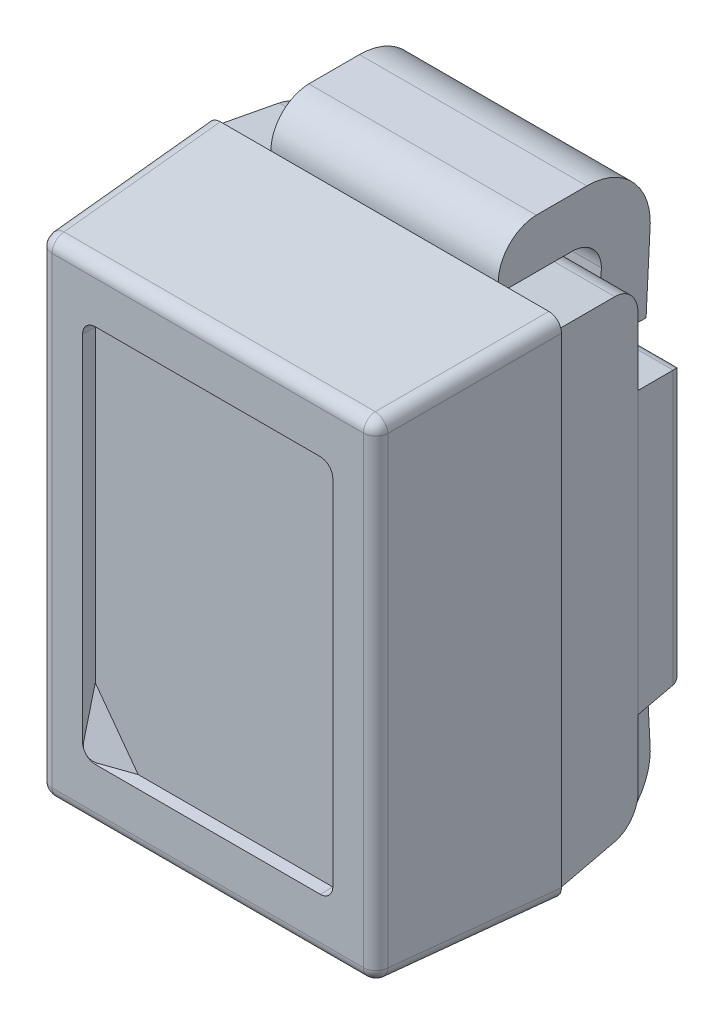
ISO-10303-21;
HEADER;
FILE_DESCRIPTION(('STEP AP214'),'2;1');
FILE_NAME('part.step','',(''),(''),'','','');
FILE_SCHEMA(('AUTOMOTIVE_DESIGN { 1 0 10303 214 1 1 1 1 }'));
ENDSEC;
DATA;
#1=APPLICATION_CONTEXT('core data for automotive mechanical design processes');
#2=APPLICATION_PROTOCOL_DEFINITION('international standard','automotive_design',2000,#1);
#3=PRODUCT_CONTEXT('',#1,'mechanical');
#4=PRODUCT('Part','Part','',(#3));
#5=PRODUCT_RELATED_PRODUCT_CATEGORY('part','',(#4));
#6=PRODUCT_DEFINITION_FORMATION('','',#4);
#7=PRODUCT_DEFINITION_CONTEXT('part definition',#1,'design');
#8=PRODUCT_DEFINITION('design','',#6,#7);
#9=PRODUCT_DEFINITION_SHAPE('','',#8);
#10=(LENGTH_UNIT() NAMED_UNIT(*) SI_UNIT(.MILLI.,.METRE.));
#11=(NAMED_UNIT(*) PLANE_ANGLE_UNIT() SI_UNIT($,.RADIAN.));
#12=(NAMED_UNIT(*) SI_UNIT($,.STERADIAN.) SOLID_ANGLE_UNIT());
#13=UNCERTAINTY_MEASURE_WITH_UNIT(LENGTH_MEASURE(1.E-05),#10,'distance_accuracy_value','');
#14=(GEOMETRIC_REPRESENTATION_CONTEXT(3) GLOBAL_UNCERTAINTY_ASSIGNED_CONTEXT((#13)) GLOBAL_UNIT_ASSIGNED_CONTEXT((#10,
#11,#12)) REPRESENTATION_CONTEXT('',''));
#15=CARTESIAN_POINT('',(0.,0.,0.));
#16=DIRECTION('',(0.,0.,1.));
#17=DIRECTION('',(1.,0.,0.));
#18=AXIS2_PLACEMENT_3D('',#15,#16,#17);
#19=CARTESIAN_POINT('',(-0.445,-0.7,0.65));
#20=DIRECTION('',(0.,0.,1.));
#21=DIRECTION('',(1.,0.,0.));
#22=AXIS2_PLACEMENT_3D('',#19,#20,#21);
#23=CYLINDRICAL_SURFACE('',#22,0.05);
#24=CARTESIAN_POINT('',(-0.445,-0.7,0.678728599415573));
#25=DIRECTION('',(0.31778875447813,0.234887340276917,0.918606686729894));
#26=DIRECTION('',(-0.738721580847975,-0.546011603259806,0.395173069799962));
#27=AXIS2_PLACEMENT_3D('',#24,#25,#26);
#28=ELLIPSE('',#27,0.054430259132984,0.05);
#29=CARTESIAN_POINT('',(-0.480355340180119,-0.735355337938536,0.699999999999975));
#30=VERTEX_POINT('',#29);
#31=CARTESIAN_POINT('',(-0.445,-0.75,0.691513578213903));
#32=VERTEX_POINT('',#31);
#33=EDGE_CURVE('E178',#30,#32,#28,.T.);
#34=ORIENTED_EDGE('',*,*,#33,.F.);
#35=CARTESIAN_POINT('',(-0.445,-0.7,0.7));
#36=DIRECTION('',(0.,0.,1.));
#37=DIRECTION('',(1.,0.,0.));
#38=AXIS2_PLACEMENT_3D('',#35,#36,#37);
#39=CIRCLE('',#38,0.05);
#40=CARTESIAN_POINT('',(-0.445,-0.750000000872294,0.7));
#41=VERTEX_POINT('',#40);
#42=EDGE_CURVE('E1130',#30,#41,#39,.T.);
#43=ORIENTED_EDGE('',*,*,#42,.T.);
#44=DIRECTION('',(0.,0.,-1.));
#45=VECTOR('',#44,1.);
#46=CARTESIAN_POINT('',(-0.445,-0.75,0.675));
#47=LINE('',#46,#45);
#48=EDGE_CURVE('E547',#41,#32,#47,.T.);
#49=ORIENTED_EDGE('',*,*,#48,.T.);
#50=EDGE_LOOP('',(#34,#43,#49));
#51=FACE_BOUND('',#50,.T.);
#52=ADVANCED_FACE('F158',(#51),#23,.F.);
#53=CARTESIAN_POINT('',(-0.653213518,-0.97152,-0.35));
#54=DIRECTION('',(-0.994521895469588,0.,-0.104528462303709));
#55=DIRECTION('',(-0.104528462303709,0.,0.994521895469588));
#56=AXIS2_PLACEMENT_3D('',#53,#54,#55);
#57=PLANE('',#56);
#58=DIRECTION('',(-0.103962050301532,-0.103962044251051,0.989132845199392));
#59=VECTOR('',#58,1.);
#60=CARTESIAN_POINT('',(-0.664037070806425,-0.93403707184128,-0.24702077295));
#61=LINE('',#60,#59);
#62=CARTESIAN_POINT('',(-0.664037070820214,-0.934037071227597,-0.247020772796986));
#63=VERTEX_POINT('',#62);
#64=CARTESIAN_POINT('',(-0.689999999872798,-0.959999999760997,-4.3918183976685E-12));
#65=VERTEX_POINT('',#64);
#66=EDGE_CURVE('E580',#63,#65,#61,.T.);
#67=ORIENTED_EDGE('',*,*,#66,.T.);
#68=DIRECTION('',(0.,1.,0.));
#69=VECTOR('',#68,1.);
#70=CARTESIAN_POINT('',(-0.689999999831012,0.,0.));
#71=LINE('',#70,#69);
#72=CARTESIAN_POINT('',(-0.689999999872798,0.959999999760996,-4.39182049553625E-12));
#73=VERTEX_POINT('',#72);
#74=EDGE_CURVE('E579',#65,#73,#71,.T.);
#75=ORIENTED_EDGE('',*,*,#74,.T.);
#76=DIRECTION('',(0.103962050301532,-0.10396204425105,-0.989132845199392));
#77=VECTOR('',#76,1.);
#78=CARTESIAN_POINT('',(-0.69,0.959999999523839,0.));
#79=LINE('',#78,#77);
#80=CARTESIAN_POINT('',(-0.664037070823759,0.934037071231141,-0.247020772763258));
#81=VERTEX_POINT('',#80);
#82=EDGE_CURVE('E539',#73,#81,#79,.T.);
#83=ORIENTED_EDGE('',*,*,#82,.T.);
#84=CARTESIAN_POINT('',(-0.665300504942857,0.819667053,-0.235));
#85=DIRECTION('',(-0.994521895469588,0.,-0.104528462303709));
#86=DIRECTION('',(0.104528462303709,0.,-0.994521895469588));
#87=AXIS2_PLACEMENT_3D('',#84,#85,#86);
#88=ELLIPSE('',#87,0.115633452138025,0.115);
#89=CARTESIAN_POINT('',(-0.653213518,0.819667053,-0.35));
#90=VERTEX_POINT('',#89);
#91=EDGE_CURVE('E501',#81,#90,#88,.T.);
#92=ORIENTED_EDGE('',*,*,#91,.T.);
#93=DIRECTION('',(0.,-1.,0.));
#94=VECTOR('',#93,1.);
#95=CARTESIAN_POINT('',(-0.653213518,0.,-0.35));
#96=LINE('',#95,#94);
#97=CARTESIAN_POINT('',(-0.653213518,-0.819667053,-0.35));
#98=VERTEX_POINT('',#97);
#99=EDGE_CURVE('E592',#90,#98,#96,.T.);
#100=ORIENTED_EDGE('',*,*,#99,.T.);
#101=CARTESIAN_POINT('',(-0.665300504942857,-0.819667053,-0.235));
#102=DIRECTION('',(-0.994521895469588,0.,-0.104528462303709));
#103=DIRECTION('',(-0.104528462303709,0.,0.994521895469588));
#104=AXIS2_PLACEMENT_3D('',#101,#102,#103);
#105=ELLIPSE('',#104,0.115633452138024,0.115);
#106=EDGE_CURVE('E595',#98,#63,#105,.T.);
#107=ORIENTED_EDGE('',*,*,#106,.T.);
#108=EDGE_LOOP('',(#67,#75,#83,#92,#100,#107));
#109=FACE_BOUND('',#108,.T.);
#110=ADVANCED_FACE('F773',(#109),#57,.T.);
#111=CARTESIAN_POINT('',(-0.70250068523,-1.,0.));
#112=DIRECTION('',(0.,0.,1.));
#113=DIRECTION('',(1.,0.,0.));
#114=AXIS2_PLACEMENT_3D('',#111,#112,#113);
#115=PLANE('',#114);
#116=DIRECTION('',(1.,0.,0.));
#117=VECTOR('',#116,1.);
#118=CARTESIAN_POINT('',(-0.576216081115,-1.,0.));
#119=LINE('',#118,#117);
#120=CARTESIAN_POINT('',(-0.65006852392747,-1.00000000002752,2.87760967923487E-13));
#121=VERTEX_POINT('',#120);
#122=CARTESIAN_POINT('',(-0.449931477,-0.999999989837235,0.));
#123=VERTEX_POINT('',#122);
#124=EDGE_CURVE('E560',#121,#123,#119,.T.);
#125=ORIENTED_EDGE('',*,*,#124,.F.);
#126=CARTESIAN_POINT('',(-0.649931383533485,-0.949931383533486,0.));
#127=DIRECTION('',(0.,0.,1.));
#128=DIRECTION('',(-0.707106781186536,-0.707106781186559,0.));
#129=AXIS2_PLACEMENT_3D('',#126,#127,#128);
#130=ELLIPSE('',#129,0.0501371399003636,0.0499999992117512);
#131=CARTESIAN_POINT('',(-0.700000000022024,-0.950068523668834,0.));
#132=VERTEX_POINT('',#131);
#133=EDGE_CURVE('E563',#132,#121,#130,.T.);
#134=ORIENTED_EDGE('',*,*,#133,.F.);
#135=DIRECTION('',(0.,-1.,0.));
#136=VECTOR('',#135,1.);
#137=CARTESIAN_POINT('',(-0.7,0.,0.));
#138=LINE('',#137,#136);
#139=CARTESIAN_POINT('',(-0.700000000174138,0.950068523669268,0.));
#140=VERTEX_POINT('',#139);
#141=EDGE_CURVE('E568',#140,#132,#138,.T.);
#142=ORIENTED_EDGE('',*,*,#141,.F.);
#143=CARTESIAN_POINT('',(-0.64993138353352,0.94993138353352,0.));
#144=DIRECTION('',(0.,0.,1.));
#145=DIRECTION('',(-0.707106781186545,0.70710678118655,0.));
#146=AXIS2_PLACEMENT_3D('',#143,#144,#145);
#147=ELLIPSE('',#146,0.0501371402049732,0.0499999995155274);
#148=CARTESIAN_POINT('',(-0.650068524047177,1.00000000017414,0.));
#149=VERTEX_POINT('',#148);
#150=EDGE_CURVE('E566',#149,#140,#147,.T.);
#151=ORIENTED_EDGE('',*,*,#150,.F.);
#152=DIRECTION('',(-1.,0.,0.));
#153=VECTOR('',#152,1.);
#154=CARTESIAN_POINT('',(-0.576216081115,1.,0.));
#155=LINE('',#154,#153);
#156=CARTESIAN_POINT('',(-0.449931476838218,0.99999998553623,0.));
#157=VERTEX_POINT('',#156);
#158=EDGE_CURVE('E564',#157,#149,#155,.T.);
#159=ORIENTED_EDGE('',*,*,#158,.F.);
#160=DIRECTION('',(0.,1.,0.));
#161=VECTOR('',#160,1.);
#162=CARTESIAN_POINT('',(-0.449931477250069,0.,0.));
#163=LINE('',#162,#161);
#164=CARTESIAN_POINT('',(-0.449931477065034,0.96,0.));
#165=VERTEX_POINT('',#164);
#166=EDGE_CURVE('E567',#165,#157,#163,.T.);
#167=ORIENTED_EDGE('',*,*,#166,.F.);
#168=DIRECTION('',(1.,0.,0.));
#169=VECTOR('',#168,1.);
#170=CARTESIAN_POINT('',(-0.576216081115,0.96,0.));
#171=LINE('',#170,#169);
#172=EDGE_CURVE('E584',#73,#165,#171,.T.);
#173=ORIENTED_EDGE('',*,*,#172,.F.);
#174=ORIENTED_EDGE('',*,*,#74,.F.);
#175=DIRECTION('',(-1.,0.,0.));
#176=VECTOR('',#175,1.);
#177=CARTESIAN_POINT('',(-0.576216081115,-0.96,0.));
#178=LINE('',#177,#176);
#179=CARTESIAN_POINT('',(-0.44993147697,-0.96,0.));
#180=VERTEX_POINT('',#179);
#181=EDGE_CURVE('E577',#180,#65,#178,.T.);
#182=ORIENTED_EDGE('',*,*,#181,.F.);
#183=DIRECTION('',(0.,1.,0.));
#184=VECTOR('',#183,1.);
#185=CARTESIAN_POINT('',(-0.449931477,0.,0.));
#186=LINE('',#185,#184);
#187=EDGE_CURVE('E562',#123,#180,#186,.T.);
#188=ORIENTED_EDGE('',*,*,#187,.F.);
#189=EDGE_LOOP('',(#125,#134,#142,#151,#159,#167,#173,#174,#182,#188));
#190=FACE_BOUND('',#189,.T.);
#191=ADVANCED_FACE('F781',(#190),#115,.F.);
#192=CARTESIAN_POINT('',(-0.7,-0.961469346,0.));
#193=DIRECTION('',(-0.998629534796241,0.,0.0523359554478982));
#194=DIRECTION('',(0.0523359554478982,0.,0.998629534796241));
#195=AXIS2_PLACEMENT_3D('',#192,#193,#194);
#196=PLANE('',#195);
#197=DIRECTION('',(-0.0522644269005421,0.0522644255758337,-0.997264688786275));
#198=VECTOR('',#197,1.);
#199=CARTESIAN_POINT('',(-0.665797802,0.91586632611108,0.652616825));
#200=LINE('',#199,#198);
#201=CARTESIAN_POINT('',(-0.665797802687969,0.915866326,0.652616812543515));
#202=VERTEX_POINT('',#201);
#203=EDGE_CURVE('E572',#202,#140,#200,.T.);
#204=ORIENTED_EDGE('',*,*,#203,.T.);
#205=ORIENTED_EDGE('',*,*,#141,.T.);
#206=DIRECTION('',(0.0522644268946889,0.0522644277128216,0.997264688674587));
#207=VECTOR('',#206,1.);
#208=CARTESIAN_POINT('',(-0.7,-0.950068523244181,0.));
#209=LINE('',#208,#207);
#210=CARTESIAN_POINT('',(-0.665797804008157,-0.915866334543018,0.65261678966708));
#211=VERTEX_POINT('',#210);
#212=EDGE_CURVE('E574',#132,#211,#209,.T.);
#213=ORIENTED_EDGE('',*,*,#212,.T.);
#214=DIRECTION('',(0.,-1.,0.));
#215=VECTOR('',#214,1.);
#216=CARTESIAN_POINT('',(-0.665797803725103,-4.99999998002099E-10,0.65261679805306));
#217=LINE('',#216,#215);
#218=EDGE_CURVE('E571',#211,#202,#217,.F.);
#219=ORIENTED_EDGE('',*,*,#218,.T.);
#220=EDGE_LOOP('',(#204,#205,#213,#219));
#221=FACE_BOUND('',#220,.T.);
#222=ADVANCED_FACE('F1888',(#221),#196,.T.);
#223=CARTESIAN_POINT('',(0.495,-0.75,0.65));
#224=DIRECTION('',(0.,0.,-1.));
#225=DIRECTION('',(-1.,0.,0.));
#226=AXIS2_PLACEMENT_3D('',#223,#224,#225);
#227=PLANE('',#226);
#228=DIRECTION('',(0.,-1.,0.));
#229=VECTOR('',#228,1.);
#230=CARTESIAN_POINT('',(-0.495,0.,0.65));
#231=LINE('',#230,#229);
#232=CARTESIAN_POINT('',(-0.495,0.7,0.65));
#233=VERTEX_POINT('',#232);
#234=CARTESIAN_POINT('',(-0.495,-0.520000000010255,0.65));
#235=VERTEX_POINT('',#234);
#236=EDGE_CURVE('E536',#233,#235,#231,.T.);
#237=ORIENTED_EDGE('',*,*,#236,.T.);
#238=DIRECTION('',(-0.59439106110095,0.804176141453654,0.));
#239=VECTOR('',#238,1.);
#240=CARTESIAN_POINT('',(-0.41,-0.635000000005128,0.65));
#241=LINE('',#240,#239);
#242=CARTESIAN_POINT('',(-0.325,-0.75,0.65));
#243=VERTEX_POINT('',#242);
#244=EDGE_CURVE('E519',#243,#235,#241,.T.);
#245=ORIENTED_EDGE('',*,*,#244,.F.);
#246=DIRECTION('',(1.,0.,0.));
#247=VECTOR('',#246,1.);
#248=CARTESIAN_POINT('',(0.,-0.75,0.65));
#249=LINE('',#248,#247);
#250=CARTESIAN_POINT('',(0.444999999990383,-0.75,0.65));
#251=VERTEX_POINT('',#250);
#252=EDGE_CURVE('E552',#243,#251,#249,.T.);
#253=ORIENTED_EDGE('',*,*,#252,.T.);
#254=CARTESIAN_POINT('',(0.445,-0.7,0.65));
#255=DIRECTION('',(0.,0.,1.));
#256=DIRECTION('',(1.,0.,0.));
#257=AXIS2_PLACEMENT_3D('',#254,#255,#256);
#258=CIRCLE('',#257,0.05);
#259=CARTESIAN_POINT('',(0.495,-0.7,0.65));
#260=VERTEX_POINT('',#259);
#261=EDGE_CURVE('E1161',#260,#251,#258,.F.);
#262=ORIENTED_EDGE('',*,*,#261,.F.);
#263=DIRECTION('',(0.,1.,0.));
#264=VECTOR('',#263,1.);
#265=CARTESIAN_POINT('',(0.495,0.,0.65));
#266=LINE('',#265,#264);
#267=CARTESIAN_POINT('',(0.495,0.7,0.65));
#268=VERTEX_POINT('',#267);
#269=EDGE_CURVE('E1157',#260,#268,#266,.T.);
#270=ORIENTED_EDGE('',*,*,#269,.T.);
#271=CARTESIAN_POINT('',(0.445,0.7,0.65));
#272=DIRECTION('',(0.,0.,1.));
#273=DIRECTION('',(1.,0.,0.));
#274=AXIS2_PLACEMENT_3D('',#271,#272,#273);
#275=CIRCLE('',#274,0.05);
#276=CARTESIAN_POINT('',(0.445,0.75,0.65));
#277=VERTEX_POINT('',#276);
#278=EDGE_CURVE('E1153',#277,#268,#275,.F.);
#279=ORIENTED_EDGE('',*,*,#278,.F.);
#280=DIRECTION('',(-1.,0.,0.));
#281=VECTOR('',#280,1.);
#282=CARTESIAN_POINT('',(0.,0.75,0.65));
#283=LINE('',#282,#281);
#284=CARTESIAN_POINT('',(-0.445,0.75,0.65));
#285=VERTEX_POINT('',#284);
#286=EDGE_CURVE('E1147',#277,#285,#283,.T.);
#287=ORIENTED_EDGE('',*,*,#286,.T.);
#288=CARTESIAN_POINT('',(-0.445,0.7,0.65));
#289=DIRECTION('',(0.,0.,1.));
#290=DIRECTION('',(1.,0.,0.));
#291=AXIS2_PLACEMENT_3D('',#288,#289,#290);
#292=CIRCLE('',#291,0.05);
#293=EDGE_CURVE('E543',#233,#285,#292,.F.);
#294=ORIENTED_EDGE('',*,*,#293,.F.);
#295=EDGE_LOOP('',(#237,#245,#253,#262,#270,#279,#287,#294));
#296=FACE_BOUND('',#295,.T.);
#297=ADVANCED_FACE('F541',(#296),#227,.F.);
#298=CARTESIAN_POINT('',(-0.615866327,0.915866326,0.65));
#299=DIRECTION('',(0.,-1.,0.));
#300=DIRECTION('',(0.,0.,-1.));
#301=AXIS2_PLACEMENT_3D('',#298,#299,#300);
#302=CYLINDRICAL_SURFACE('',#301,0.0500000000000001);
#303=DIRECTION('',(0.,1.,0.));
#304=VECTOR('',#303,1.);
#305=CARTESIAN_POINT('',(-0.615866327,-9.99999941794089E-10,0.7));
#306=LINE('',#305,#304);
#307=CARTESIAN_POINT('',(-0.615866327,-0.915866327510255,0.7));
#308=VERTEX_POINT('',#307);
#309=CARTESIAN_POINT('',(-0.615866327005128,0.915866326,0.7));
#310=VERTEX_POINT('',#309);
#311=EDGE_CURVE('E1134',#308,#310,#306,.T.);
#312=ORIENTED_EDGE('',*,*,#311,.T.);
#313=CARTESIAN_POINT('',(-0.615866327,0.915866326,0.65));
#314=DIRECTION('',(0.,-1.,0.));
#315=DIRECTION('',(0.,0.,-1.));
#316=AXIS2_PLACEMENT_3D('',#313,#314,#315);
#317=CIRCLE('',#316,0.0500000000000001);
#318=EDGE_CURVE('E1164',#202,#310,#317,.F.);
#319=ORIENTED_EDGE('',*,*,#318,.F.);
#320=ORIENTED_EDGE('',*,*,#218,.F.);
#321=CARTESIAN_POINT('',(-0.615866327,-0.915866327,0.65));
#322=DIRECTION('',(0.,-1.,0.));
#323=DIRECTION('',(0.,0.,-1.));
#324=AXIS2_PLACEMENT_3D('',#321,#322,#323);
#325=CIRCLE('',#324,0.0500000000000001);
#326=EDGE_CURVE('E1141',#211,#308,#325,.F.);
#327=ORIENTED_EDGE('',*,*,#326,.T.);
#328=EDGE_LOOP('',(#312,#319,#320,#327));
#329=FACE_BOUND('',#328,.T.);
#330=ADVANCED_FACE('F1873',(#329),#302,.T.);
#331=CARTESIAN_POINT('',(-0.445,0.7,0.65));
#332=DIRECTION('',(0.,0.,1.));
#333=DIRECTION('',(1.,0.,0.));
#334=AXIS2_PLACEMENT_3D('',#331,#332,#333);
#335=CYLINDRICAL_SURFACE('',#334,0.05);
#336=ORIENTED_EDGE('',*,*,#293,.T.);
#337=DIRECTION('',(0.,0.,1.));
#338=VECTOR('',#337,1.);
#339=CARTESIAN_POINT('',(-0.445,0.75,0.675));
#340=LINE('',#339,#338);
#341=CARTESIAN_POINT('',(-0.445,0.749999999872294,0.7));
#342=VERTEX_POINT('',#341);
#343=EDGE_CURVE('E1148',#285,#342,#340,.T.);
#344=ORIENTED_EDGE('',*,*,#343,.T.);
#345=CARTESIAN_POINT('',(-0.445,0.7,0.7));
#346=DIRECTION('',(0.,0.,1.));
#347=DIRECTION('',(1.,0.,0.));
#348=AXIS2_PLACEMENT_3D('',#345,#346,#347);
#349=CIRCLE('',#348,0.05);
#350=CARTESIAN_POINT('',(-0.494999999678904,0.7,0.7));
#351=VERTEX_POINT('',#350);
#352=EDGE_CURVE('E1131',#342,#351,#349,.T.);
#353=ORIENTED_EDGE('',*,*,#352,.T.);
#354=DIRECTION('',(0.,0.,-1.));
#355=VECTOR('',#354,1.);
#356=CARTESIAN_POINT('',(-0.495,0.7,0.675));
#357=LINE('',#356,#355);
#358=EDGE_CURVE('E545',#351,#233,#357,.T.);
#359=ORIENTED_EDGE('',*,*,#358,.T.);
#360=EDGE_LOOP('',(#336,#344,#353,#359));
#361=FACE_BOUND('',#360,.T.);
#362=ADVANCED_FACE('F1201',(#361),#335,.F.);
#363=CARTESIAN_POINT('',(-0.495,-0.7,0.65));
#364=DIRECTION('',(-1.,0.,0.));
#365=DIRECTION('',(0.,0.,1.));
#366=AXIS2_PLACEMENT_3D('',#363,#364,#365);
#367=PLANE('',#366);
#368=DIRECTION('',(0.,0.,-1.));
#369=VECTOR('',#368,1.);
#370=CARTESIAN_POINT('',(-0.495,-0.700000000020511,0.675));
#371=LINE('',#370,#369);
#372=CARTESIAN_POINT('',(-0.495,-0.700000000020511,0.69602592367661));
#373=VERTEX_POINT('',#372);
#374=CARTESIAN_POINT('',(-0.494999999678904,-0.700000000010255,0.7));
#375=VERTEX_POINT('',#374);
#376=EDGE_CURVE('E538',#373,#375,#371,.F.);
#377=ORIENTED_EDGE('',*,*,#376,.F.);
#378=DIRECTION('',(0.,0.968829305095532,-0.247729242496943));
#379=VECTOR('',#378,1.);
#380=CARTESIAN_POINT('',(-0.495,-0.68895344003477,0.693201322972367));
#381=LINE('',#380,#379);
#382=EDGE_CURVE('E508',#373,#235,#381,.T.);
#383=ORIENTED_EDGE('',*,*,#382,.T.);
#384=ORIENTED_EDGE('',*,*,#236,.F.);
#385=ORIENTED_EDGE('',*,*,#358,.F.);
#386=DIRECTION('',(0.,-1.,0.));
#387=VECTOR('',#386,1.);
#388=CARTESIAN_POINT('',(-0.494999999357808,-9.99999941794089E-10,0.7));
#389=LINE('',#388,#387);
#390=EDGE_CURVE('E1128',#351,#375,#389,.T.);
#391=ORIENTED_EDGE('',*,*,#390,.T.);
#392=EDGE_LOOP('',(#377,#383,#384,#385,#391));
#393=FACE_BOUND('',#392,.T.);
#394=ADVANCED_FACE('F534',(#393),#367,.F.);
#395=CARTESIAN_POINT('',(-0.489172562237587,-0.723426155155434,0.699999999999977));
#396=VERTEX_POINT('',#395);
#397=EDGE_CURVE('E511',#373,#396,#28,.T.);
#398=ORIENTED_EDGE('',*,*,#397,.F.);
#399=ORIENTED_EDGE('',*,*,#376,.T.);
#400=EDGE_CURVE('E1127',#375,#396,#39,.T.);
#401=ORIENTED_EDGE('',*,*,#400,.T.);
#402=EDGE_LOOP('',(#398,#399,#401));
#403=FACE_BOUND('',#402,.T.);
#404=ADVANCED_FACE('F776',(#403),#23,.F.);
#405=CARTESIAN_POINT('',(-0.445,-0.75,0.7));
#406=DIRECTION('',(0.,-1.,0.));
#407=DIRECTION('',(0.,0.,-1.));
#408=AXIS2_PLACEMENT_3D('',#405,#406,#407);
#409=PLANE('',#408);
#410=ORIENTED_EDGE('',*,*,#252,.F.);
#411=DIRECTION('',(-0.945046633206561,0.,0.326935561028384));
#412=VECTOR('',#411,1.);
#413=CARTESIAN_POINT('',(-0.447622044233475,-0.75,0.692420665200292));
#414=LINE('',#413,#412);
#415=EDGE_CURVE('E522',#243,#32,#414,.T.);
#416=ORIENTED_EDGE('',*,*,#415,.T.);
#417=ORIENTED_EDGE('',*,*,#48,.F.);
#418=DIRECTION('',(1.,0.,0.));
#419=VECTOR('',#418,1.);
#420=CARTESIAN_POINT('',(9.99999996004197E-10,-0.750000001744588,0.7));
#421=LINE('',#420,#419);
#422=CARTESIAN_POINT('',(0.444999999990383,-0.750000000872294,0.7));
#423=VERTEX_POINT('',#422);
#424=EDGE_CURVE('E1125',#41,#423,#421,.T.);
#425=ORIENTED_EDGE('',*,*,#424,.T.);
#426=DIRECTION('',(0.,0.,-1.));
#427=VECTOR('',#426,1.);
#428=CARTESIAN_POINT('',(0.444999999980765,-0.75,0.675));
#429=LINE('',#428,#427);
#430=EDGE_CURVE('E1158',#251,#423,#429,.F.);
#431=ORIENTED_EDGE('',*,*,#430,.F.);
#432=EDGE_LOOP('',(#410,#416,#417,#425,#431));
#433=FACE_BOUND('',#432,.T.);
#434=ADVANCED_FACE('F787',(#433),#409,.F.);
#435=CARTESIAN_POINT('',(0.445,-0.7,0.65));
#436=DIRECTION('',(0.,0.,1.));
#437=DIRECTION('',(1.,0.,0.));
#438=AXIS2_PLACEMENT_3D('',#435,#436,#437);
#439=CYLINDRICAL_SURFACE('',#438,0.05);
#440=ORIENTED_EDGE('',*,*,#261,.T.);
#441=ORIENTED_EDGE('',*,*,#430,.T.);
#442=CARTESIAN_POINT('',(0.445,-0.7,0.7));
#443=DIRECTION('',(0.,0.,1.));
#444=DIRECTION('',(1.,0.,0.));
#445=AXIS2_PLACEMENT_3D('',#442,#443,#444);
#446=CIRCLE('',#445,0.05);
#447=CARTESIAN_POINT('',(0.495000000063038,-0.7,0.7));
#448=VERTEX_POINT('',#447);
#449=EDGE_CURVE('E1124',#423,#448,#446,.T.);
#450=ORIENTED_EDGE('',*,*,#449,.T.);
#451=DIRECTION('',(0.,0.,-1.));
#452=VECTOR('',#451,1.);
#453=CARTESIAN_POINT('',(0.495,-0.7,0.675));
#454=LINE('',#453,#452);
#455=EDGE_CURVE('E1154',#448,#260,#454,.T.);
#456=ORIENTED_EDGE('',*,*,#455,.T.);
#457=EDGE_LOOP('',(#440,#441,#450,#456));
#458=FACE_BOUND('',#457,.T.);
#459=ADVANCED_FACE('F1840',(#458),#439,.F.);
#460=CARTESIAN_POINT('',(0.495,-0.7,0.7));
#461=DIRECTION('',(1.,0.,0.));
#462=DIRECTION('',(0.,0.,-1.));
#463=AXIS2_PLACEMENT_3D('',#460,#461,#462);
#464=PLANE('',#463);
#465=ORIENTED_EDGE('',*,*,#455,.F.);
#466=DIRECTION('',(0.,1.,0.));
#467=VECTOR('',#466,1.);
#468=CARTESIAN_POINT('',(0.495000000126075,-9.99999941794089E-10,0.7));
#469=LINE('',#468,#467);
#470=CARTESIAN_POINT('',(0.495000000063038,0.7,0.7));
#471=VERTEX_POINT('',#470);
#472=EDGE_CURVE('E1122',#448,#471,#469,.T.);
#473=ORIENTED_EDGE('',*,*,#472,.T.);
#474=DIRECTION('',(0.,0.,-1.));
#475=VECTOR('',#474,1.);
#476=CARTESIAN_POINT('',(0.495,0.7,0.675));
#477=LINE('',#476,#475);
#478=EDGE_CURVE('E1150',#268,#471,#477,.F.);
#479=ORIENTED_EDGE('',*,*,#478,.F.);
#480=ORIENTED_EDGE('',*,*,#269,.F.);
#481=EDGE_LOOP('',(#465,#473,#479,#480));
#482=FACE_BOUND('',#481,.T.);
#483=ADVANCED_FACE('F1832',(#482),#464,.F.);
#484=CARTESIAN_POINT('',(0.445,0.7,0.65));
#485=DIRECTION('',(0.,0.,1.));
#486=DIRECTION('',(1.,0.,0.));
#487=AXIS2_PLACEMENT_3D('',#484,#485,#486);
#488=CYLINDRICAL_SURFACE('',#487,0.05);
#489=ORIENTED_EDGE('',*,*,#278,.T.);
#490=ORIENTED_EDGE('',*,*,#478,.T.);
#491=CARTESIAN_POINT('',(0.445,0.7,0.7));
#492=DIRECTION('',(0.,0.,1.));
#493=DIRECTION('',(1.,0.,0.));
#494=AXIS2_PLACEMENT_3D('',#491,#492,#493);
#495=CIRCLE('',#494,0.05);
#496=CARTESIAN_POINT('',(0.445,0.749999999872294,0.7));
#497=VERTEX_POINT('',#496);
#498=EDGE_CURVE('E1121',#471,#497,#495,.T.);
#499=ORIENTED_EDGE('',*,*,#498,.T.);
#500=DIRECTION('',(0.,0.,-1.));
#501=VECTOR('',#500,1.);
#502=CARTESIAN_POINT('',(0.445,0.75,0.675));
#503=LINE('',#502,#501);
#504=EDGE_CURVE('E1144',#497,#277,#503,.T.);
#505=ORIENTED_EDGE('',*,*,#504,.T.);
#506=EDGE_LOOP('',(#489,#490,#499,#505));
#507=FACE_BOUND('',#506,.T.);
#508=ADVANCED_FACE('F1824',(#507),#488,.F.);
#509=CARTESIAN_POINT('',(-0.445,0.75,0.65));
#510=DIRECTION('',(0.,1.,0.));
#511=DIRECTION('',(0.,0.,1.));
#512=AXIS2_PLACEMENT_3D('',#509,#510,#511);
#513=PLANE('',#512);
#514=ORIENTED_EDGE('',*,*,#504,.F.);
#515=DIRECTION('',(-1.,0.,0.));
#516=VECTOR('',#515,1.);
#517=CARTESIAN_POINT('',(9.99999996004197E-10,0.749999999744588,0.7));
#518=LINE('',#517,#516);
#519=EDGE_CURVE('E1100',#497,#342,#518,.T.);
#520=ORIENTED_EDGE('',*,*,#519,.T.);
#521=ORIENTED_EDGE('',*,*,#343,.F.);
#522=ORIENTED_EDGE('',*,*,#286,.F.);
#523=EDGE_LOOP('',(#514,#520,#521,#522));
#524=FACE_BOUND('',#523,.T.);
#525=ADVANCED_FACE('F1815',(#524),#513,.F.);
#526=CARTESIAN_POINT('',(-0.665817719,-0.915866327,0.652204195));
#527=CARTESIAN_POINT('',(-0.665817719,-0.945127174,0.652204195));
#528=CARTESIAN_POINT('',(-0.645127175,-0.965817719,0.652204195));
#529=CARTESIAN_POINT('',(-0.615866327,-0.965817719,0.652204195));
#530=CARTESIAN_POINT('',(-0.664571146,-0.915866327,0.680453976));
#531=CARTESIAN_POINT('',(-0.664571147,-0.94439695,0.680453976));
#532=CARTESIAN_POINT('',(-0.64439695,-0.964571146,0.680453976));
#533=CARTESIAN_POINT('',(-0.615866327,-0.964571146,0.680453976));
#534=CARTESIAN_POINT('',(-0.644139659,-0.915866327,0.7));
#535=CARTESIAN_POINT('',(-0.644139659,-0.932428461,0.7));
#536=CARTESIAN_POINT('',(-0.632428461,-0.944139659,0.7));
#537=CARTESIAN_POINT('',(-0.615866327,-0.944139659,0.7));
#538=CARTESIAN_POINT('',(-0.615866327,-0.915866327,0.7));
#539=CARTESIAN_POINT('',(-0.615866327,-0.915866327,0.7));
#540=CARTESIAN_POINT('',(-0.615866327,-0.915866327,0.7));
#541=CARTESIAN_POINT('',(-0.615866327,-0.915866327,0.7));
#542=(BOUNDED_SURFACE() B_SPLINE_SURFACE(3,3,((#526,#527,#528,#529),(#530,#531,#532,#533),(#534,
#535,#536,#537),(#538,#539,#540,#541)),.UNSPECIFIED.,.F.,.F.,
.F.) B_SPLINE_SURFACE_WITH_KNOTS((4,4),(4,4),(0.000613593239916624,1.),(0.,1.),
.UNSPECIFIED.) GEOMETRIC_REPRESENTATION_ITEM() RATIONAL_B_SPLINE_SURFACE(((0.999659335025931,
0.804463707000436,0.804463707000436,0.999659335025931),(0.814820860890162,0.655717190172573,
0.655717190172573,0.814820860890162),(0.814934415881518,0.655808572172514,0.655808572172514,
0.814934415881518),(1.,0.804737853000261,0.804737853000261,1.))) REPRESENTATION_ITEM('') SURFACE());
#543=CARTESIAN_POINT('',(-0.615866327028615,-0.915866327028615,0.649999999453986));
#544=DIRECTION('',(-0.0522644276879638,-0.0522644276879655,-0.997264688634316));
#545=DIRECTION('',(0.,0.998629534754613,-0.0523359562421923));
#546=AXIS2_PLACEMENT_3D('',#543,#544,#545);
#547=CIRCLE('',#546,0.0499999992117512);
#548=CARTESIAN_POINT('',(-0.615866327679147,-0.96579780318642,0.652616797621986));
#549=VERTEX_POINT('',#548);
#550=EDGE_CURVE('E1138',#211,#549,#547,.F.);
#551=CARTESIAN_POINT('',(-0.615866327,-0.915866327,0.65));
#552=DIRECTION('',(1.,0.,0.));
#553=DIRECTION('',(0.,0.,-1.));
#554=AXIS2_PLACEMENT_3D('',#551,#552,#553);
#555=CIRCLE('',#554,0.0500000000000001);
#556=EDGE_CURVE('E1096',#549,#308,#555,.F.);
#557=ORIENTED_EDGE('',*,*,#326,.F.);
#558=ORIENTED_EDGE('',*,*,#550,.T.);
#559=ORIENTED_EDGE('',*,*,#556,.T.);
#560=EDGE_LOOP('',(#557,#558,#559));
#561=FACE_BOUND('',#560,.T.);
#562=ADVANCED_FACE('F1807',(#561),#542,.F.);
#563=CARTESIAN_POINT('',(0.615866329,-0.915866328,0.7));
#564=DIRECTION('',(0.,0.,-1.));
#565=DIRECTION('',(-1.,0.,0.));
#566=AXIS2_PLACEMENT_3D('',#563,#564,#565);
#567=PLANE('',#566);
#568=ORIENTED_EDGE('',*,*,#42,.F.);
#569=DIRECTION('',(-0.594391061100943,0.804176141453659,0.));
#570=VECTOR('',#569,1.);
#571=CARTESIAN_POINT('',(-0.480355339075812,-0.735355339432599,0.7));
#572=LINE('',#571,#570);
#573=EDGE_CURVE('E527',#30,#396,#572,.T.);
#574=ORIENTED_EDGE('',*,*,#573,.T.);
#575=ORIENTED_EDGE('',*,*,#400,.F.);
#576=ORIENTED_EDGE('',*,*,#390,.F.);
#577=ORIENTED_EDGE('',*,*,#352,.F.);
#578=ORIENTED_EDGE('',*,*,#519,.F.);
#579=ORIENTED_EDGE('',*,*,#498,.F.);
#580=ORIENTED_EDGE('',*,*,#472,.F.);
#581=ORIENTED_EDGE('',*,*,#449,.F.);
#582=ORIENTED_EDGE('',*,*,#424,.F.);
#583=EDGE_LOOP('',(#568,#574,#575,#576,#577,#578,#579,#580,#581,#582));
#584=FACE_BOUND('',#583,.T.);
#585=ORIENTED_EDGE('',*,*,#311,.F.);
#586=DIRECTION('',(-1.,0.,0.));
#587=VECTOR('',#586,1.);
#588=CARTESIAN_POINT('',(-4.9999994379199E-10,-0.91586632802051,0.7));
#589=LINE('',#588,#587);
#590=CARTESIAN_POINT('',(0.615866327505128,-0.915866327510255,0.7));
#591=VERTEX_POINT('',#590);
#592=EDGE_CURVE('E1099',#308,#591,#589,.F.);
#593=ORIENTED_EDGE('',*,*,#592,.T.);
#594=DIRECTION('',(0.,-1.,0.));
#595=VECTOR('',#594,1.);
#596=CARTESIAN_POINT('',(0.615866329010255,9.99999941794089E-10,0.7));
#597=LINE('',#596,#595);
#598=CARTESIAN_POINT('',(0.615866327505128,0.915866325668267,0.7));
#599=VERTEX_POINT('',#598);
#600=EDGE_CURVE('E1093',#591,#599,#597,.F.);
#601=ORIENTED_EDGE('',*,*,#600,.T.);
#602=DIRECTION('',(1.,0.,0.));
#603=VECTOR('',#602,1.);
#604=CARTESIAN_POINT('',(9.99999996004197E-10,0.915866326,0.7));
#605=LINE('',#604,#603);
#606=EDGE_CURVE('E1132',#310,#599,#605,.T.);
#607=ORIENTED_EDGE('',*,*,#606,.F.);
#608=EDGE_LOOP('',(#585,#593,#601,#607));
#609=FACE_BOUND('',#608,.T.);
#610=ADVANCED_FACE('F1208',(#584,#609),#567,.F.);
#611=CARTESIAN_POINT('',(-0.614806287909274,0.965817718,0.652204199));
#612=CARTESIAN_POINT('',(-0.615159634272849,0.965817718,0.652204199));
#613=CARTESIAN_POINT('',(-0.615512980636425,0.965817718,0.652204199));
#614=CARTESIAN_POINT('',(-0.615866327,0.965817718,0.652204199));
#615=CARTESIAN_POINT('',(-0.645345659,0.965817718,0.652204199));
#616=CARTESIAN_POINT('',(-0.66606526,0.944878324,0.652204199));
#617=CARTESIAN_POINT('',(-0.665815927,0.915443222,0.652204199));
#618=CARTESIAN_POINT('',(-0.614832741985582,0.964571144,0.680453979));
#619=CARTESIAN_POINT('',(-0.615177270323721,0.964571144,0.680453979));
#620=CARTESIAN_POINT('',(-0.615521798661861,0.964571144,0.680453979));
#621=CARTESIAN_POINT('',(-0.615866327,0.964571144,0.680453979));
#622=CARTESIAN_POINT('',(-0.64460998,0.964571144,0.680453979));
#623=CARTESIAN_POINT('',(-0.664812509,0.944154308,0.680453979));
#624=CARTESIAN_POINT('',(-0.664569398,0.915453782,0.680453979));
#625=CARTESIAN_POINT('',(-0.615266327,0.944139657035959,0.700000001));
#626=CARTESIAN_POINT('',(-0.615466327,0.944139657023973,0.700000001));
#627=CARTESIAN_POINT('',(-0.615666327,0.944139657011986,0.700000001));
#628=CARTESIAN_POINT('',(-0.615866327,0.944139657,0.700000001));
#629=CARTESIAN_POINT('',(-0.632552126,0.944139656,0.700000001));
#630=CARTESIAN_POINT('',(-0.64427977,0.932287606,0.700000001));
#631=CARTESIAN_POINT('',(-0.644138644,0.915626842,0.700000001));
#632=CARTESIAN_POINT('',(-0.615866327,0.915866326,0.7));
#633=CARTESIAN_POINT('',(-0.615866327,0.915866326,0.7));
#634=CARTESIAN_POINT('',(-0.615866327,0.915866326,0.7));
#635=CARTESIAN_POINT('',(-0.615866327,0.915866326,0.7));
#636=CARTESIAN_POINT('',(-0.615866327,0.915866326,0.7));
#637=CARTESIAN_POINT('',(-0.615866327,0.915866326,0.7));
#638=CARTESIAN_POINT('',(-0.615866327,0.915866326,0.7));
#639=(BOUNDED_SURFACE() B_SPLINE_SURFACE(3,3,((#611,#612,#613,#614,#615,#616,#617),(#618,#619,
#620,#621,#622,#623,#624),(#625,#626,#627,#628,#629,#630,#631),(#632,#633,#634,#635,#636,#637,
#638)),.UNSPECIFIED.,.F.,.F.,.F.) B_SPLINE_SURFACE_WITH_KNOTS((4,4),(4,3,4),
(0.00061364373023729,1.),(-0.00821863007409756,0.00658941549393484,0.999331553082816),
.UNSPECIFIED.) GEOMETRIC_REPRESENTATION_ITEM() RATIONAL_B_SPLINE_SURFACE(((0.995738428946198,
0.995738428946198,0.995738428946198,0.995738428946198,0.800141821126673,0.801315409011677,
0.999259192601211),(0.811624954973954,0.811624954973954,0.811624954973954,0.811624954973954,
0.652194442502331,0.653151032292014,0.814494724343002),(0.811738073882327,0.811738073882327,
0.811738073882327,0.811738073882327,0.652285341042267,0.653242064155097,0.814608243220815),
(0.996077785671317,0.996077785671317,0.996077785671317,0.996077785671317,0.800414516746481,
0.801588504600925,0.999599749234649))) REPRESENTATION_ITEM('') SURFACE());
#640=CARTESIAN_POINT('',(-0.615866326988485,0.915866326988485,0.650000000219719));
#641=DIRECTION('',(-0.0522644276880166,0.052264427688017,-0.997264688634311));
#642=DIRECTION('',(0.,0.998629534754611,0.052335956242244));
#643=AXIS2_PLACEMENT_3D('',#640,#641,#642);
#644=CIRCLE('',#643,0.0499999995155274);
#645=CARTESIAN_POINT('',(-0.615866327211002,0.965797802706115,0.652616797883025));
#646=VERTEX_POINT('',#645);
#647=EDGE_CURVE('E1083',#646,#202,#644,.F.);
#648=CARTESIAN_POINT('',(-0.615866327,0.915866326,0.65));
#649=DIRECTION('',(-1.,0.,0.));
#650=DIRECTION('',(0.,0.,1.));
#651=AXIS2_PLACEMENT_3D('',#648,#649,#650);
#652=CIRCLE('',#651,0.0499999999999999);
#653=EDGE_CURVE('E1081',#310,#646,#652,.T.);
#654=ORIENTED_EDGE('',*,*,#647,.T.);
#655=ORIENTED_EDGE('',*,*,#318,.T.);
#656=ORIENTED_EDGE('',*,*,#653,.T.);
#657=EDGE_LOOP('',(#654,#655,#656));
#658=FACE_BOUND('',#657,.T.);
#659=ADVANCED_FACE('F1441',(#658),#639,.F.);
#660=CARTESIAN_POINT('',(-0.449931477,0.581532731,0.));
#661=DIRECTION('',(1.,0.,0.));
#662=DIRECTION('',(0.,0.,-1.));
#663=AXIS2_PLACEMENT_3D('',#660,#661,#662);
#664=PLANE('',#663);
#665=CARTESIAN_POINT('',(-0.449931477,1.155,-0.350348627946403));
#666=CARTESIAN_POINT('',(-0.449931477,1.15499509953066,-0.364454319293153));
#667=CARTESIAN_POINT('',(-0.449931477,1.15379222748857,-0.378558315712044));
#668=CARTESIAN_POINT('',(-0.449931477,1.14906061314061,-0.406358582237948));
#669=CARTESIAN_POINT('',(-0.449931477,1.14553380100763,-0.420055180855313));
#670=CARTESIAN_POINT('',(-0.449931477,1.13622101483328,-0.446669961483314));
#671=CARTESIAN_POINT('',(-0.449931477,1.13043352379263,-0.459587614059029));
#672=CARTESIAN_POINT('',(-0.449931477,1.11676732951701,-0.484260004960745));
#673=CARTESIAN_POINT('',(-0.449931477,1.10888888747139,-0.496014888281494));
#674=CARTESIAN_POINT('',(-0.449931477,1.09129236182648,-0.518048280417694));
#675=CARTESIAN_POINT('',(-0.449931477,1.08157520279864,-0.528327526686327));
#676=CARTESIAN_POINT('',(-0.449931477,1.06053670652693,-0.547086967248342));
#677=CARTESIAN_POINT('',(-0.449931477,1.04921534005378,-0.555567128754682));
#678=CARTESIAN_POINT('',(-0.449931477,1.02532784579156,-0.570532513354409));
#679=CARTESIAN_POINT('',(-0.449931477,1.01276198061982,-0.577018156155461));
#680=CARTESIAN_POINT('',(-0.449931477,0.986713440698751,-0.587778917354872));
#681=CARTESIAN_POINT('',(-0.449931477,0.97323072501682,-0.592053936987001));
#682=CARTESIAN_POINT('',(-0.449931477,0.946121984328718,-0.598188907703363));
#683=CARTESIAN_POINT('',(-0.449931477,0.932510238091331,-0.60011238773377));
#684=CARTESIAN_POINT('',(-0.449931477,0.90514619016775,-0.601735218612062));
#685=CARTESIAN_POINT('',(-0.449931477,0.891393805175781,-0.601433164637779));
#686=CARTESIAN_POINT('',(-0.449931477,0.877757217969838,-0.600006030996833));
#687=B_SPLINE_CURVE_WITH_KNOTS('',3,(#665,#666,#667,#668,#669,#670,#671,#672,#673,#674,#675,
#676,#677,#678,#679,#680,#681,#682,#683,#684,#685,#686),.UNSPECIFIED.,.F.,.F.,(4,2,2,2,2,2,2,2,
2,2,4),(0.,0.0422670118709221,0.0844989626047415,0.12675930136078,0.169014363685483,
0.211248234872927,0.2534828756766,0.295708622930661,0.337936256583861,0.378995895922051,
0.420081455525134),.UNSPECIFIED.);
#688=CARTESIAN_POINT('',(-0.449931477,1.155,-0.350348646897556));
#689=VERTEX_POINT('',#688);
#690=CARTESIAN_POINT('',(-0.449931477,0.877757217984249,-0.600006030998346));
#691=VERTEX_POINT('',#690);
#692=EDGE_CURVE('E1069',#689,#691,#687,.T.);
#693=ORIENTED_EDGE('',*,*,#692,.T.);
#694=DIRECTION('',(0.,-0.998629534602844,0.052335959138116));
#695=VECTOR('',#694,1.);
#696=CARTESIAN_POINT('',(-0.449931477,0.7313551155,-0.5923334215));
#697=LINE('',#696,#695);
#698=CARTESIAN_POINT('',(-0.449931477,0.584953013,-0.584660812));
#699=VERTEX_POINT('',#698);
#700=EDGE_CURVE('E1065',#691,#699,#697,.T.);
#701=ORIENTED_EDGE('',*,*,#700,.T.);
#702=DIRECTION('',(0.,-0.0523359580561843,-0.998629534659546));
#703=VECTOR('',#702,1.);
#704=CARTESIAN_POINT('',(-0.449931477,0.589924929,-0.4897910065));
#705=LINE('',#704,#703);
#706=CARTESIAN_POINT('',(-0.449931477,0.594896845,-0.394921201));
#707=VERTEX_POINT('',#706);
#708=EDGE_CURVE('E1059',#707,#699,#705,.T.);
#709=ORIENTED_EDGE('',*,*,#708,.F.);
#710=DIRECTION('',(0.,0.998629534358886,-0.0523359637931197));
#711=VECTOR('',#710,1.);
#712=CARTESIAN_POINT('',(-0.449931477,0.6083783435,-0.3956277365));
#713=LINE('',#712,#711);
#714=CARTESIAN_POINT('',(-0.449931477,0.621859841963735,-0.396334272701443));
#715=VERTEX_POINT('',#714);
#716=EDGE_CURVE('E1048',#707,#715,#713,.T.);
#717=ORIENTED_EDGE('',*,*,#716,.T.);
#718=DIRECTION('',(0.,0.998666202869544,-0.0516315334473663));
#719=VECTOR('',#718,1.);
#720=CARTESIAN_POINT('',(-0.449931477,0.734545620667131,-0.402160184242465));
#721=LINE('',#720,#719);
#722=CARTESIAN_POINT('',(-0.449931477,0.845003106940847,-0.407870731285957));
#723=VERTEX_POINT('',#722);
#724=EDGE_CURVE('E1047',#715,#723,#721,.T.);
#725=ORIENTED_EDGE('',*,*,#724,.T.);
#726=CARTESIAN_POINT('',(-0.449931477,0.845,-0.292870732));
#727=DIRECTION('',(1.,0.,0.));
#728=DIRECTION('',(0.,0.,-1.));
#729=AXIS2_PLACEMENT_3D('',#726,#727,#728);
#730=CIRCLE('',#729,0.115);
#731=CARTESIAN_POINT('',(-0.449931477,0.96,-0.292870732));
#732=VERTEX_POINT('',#731);
#733=EDGE_CURVE('E1043',#732,#723,#730,.F.);
#734=ORIENTED_EDGE('',*,*,#733,.F.);
#735=DIRECTION('',(0.,0.,1.));
#736=VECTOR('',#735,1.);
#737=CARTESIAN_POINT('',(-0.449931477,0.96,-0.146435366));
#738=LINE('',#737,#736);
#739=EDGE_CURVE('E1001',#732,#165,#738,.T.);
#740=ORIENTED_EDGE('',*,*,#739,.T.);
#741=ORIENTED_EDGE('',*,*,#166,.T.);
#742=CARTESIAN_POINT('',(-0.449931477,0.999999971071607,0.));
#743=CARTESIAN_POINT('',(-0.449931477,1.00872634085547,-7.8241382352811E-06));
#744=CARTESIAN_POINT('',(-0.449931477,1.01743877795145,-0.000747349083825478));
#745=CARTESIAN_POINT('',(-0.449931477,1.03461172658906,-0.00366559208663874));
#746=CARTESIAN_POINT('',(-0.449931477,1.04307243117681,-0.00584317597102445));
#747=CARTESIAN_POINT('',(-0.449931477,1.06771238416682,-0.0144810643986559));
#748=CARTESIAN_POINT('',(-0.449931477,1.08320488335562,-0.0230468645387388));
#749=CARTESIAN_POINT('',(-0.449931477,1.11046152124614,-0.0448452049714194));
#750=CARTESIAN_POINT('',(-0.449931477,1.12222434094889,-0.0580793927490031));
#751=CARTESIAN_POINT('',(-0.449931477,1.13610027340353,-0.0802173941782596));
#752=CARTESIAN_POINT('',(-0.449931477,1.14010168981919,-0.0879954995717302));
#753=CARTESIAN_POINT('',(-0.449931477,1.14673120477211,-0.104116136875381));
#754=CARTESIAN_POINT('',(-0.449931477,1.14936041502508,-0.112458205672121));
#755=CARTESIAN_POINT('',(-0.449931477,1.15342571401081,-0.130491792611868));
#756=CARTESIAN_POINT('',(-0.449931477,1.15467967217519,-0.140224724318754));
#757=CARTESIAN_POINT('',(-0.449931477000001,1.15500000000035,-0.149987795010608));
#758=B_SPLINE_CURVE_WITH_KNOTS('',3,(#742,#743,#744,#745,#746,#747,#748,#749,#750,#751,#752,
#753,#754,#755,#756,#757),.UNSPECIFIED.,.F.,.F.,(4,2,2,2,2,2,2,4),(0.,0.0261220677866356,
0.0522235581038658,0.104268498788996,0.156331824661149,0.182467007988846,0.208580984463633,
0.237844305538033),.UNSPECIFIED.);
#759=CARTESIAN_POINT('',(-0.449931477,1.15500000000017,-0.149987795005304));
#760=VERTEX_POINT('',#759);
#761=EDGE_CURVE('E1080',#157,#760,#758,.T.);
#762=ORIENTED_EDGE('',*,*,#761,.T.);
#763=DIRECTION('',(0.,0.,1.));
#764=VECTOR('',#763,1.);
#765=CARTESIAN_POINT('',(-0.449931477,1.155,-0.250168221));
#766=LINE('',#765,#764);
#767=EDGE_CURVE('E1073',#689,#760,#766,.T.);
#768=ORIENTED_EDGE('',*,*,#767,.F.);
#769=EDGE_LOOP('',(#693,#701,#709,#717,#725,#734,#740,#741,#762,#768));
#770=FACE_BOUND('',#769,.T.);
#771=ADVANCED_FACE('F1287',(#770),#664,.F.);
#772=CARTESIAN_POINT('',(-0.615866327,-0.915866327,0.65));
#773=DIRECTION('',(1.,0.,0.));
#774=DIRECTION('',(0.,0.,-1.));
#775=AXIS2_PLACEMENT_3D('',#772,#773,#774);
#776=CYLINDRICAL_SURFACE('',#775,0.0500000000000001);
#777=ORIENTED_EDGE('',*,*,#592,.F.);
#778=ORIENTED_EDGE('',*,*,#556,.F.);
#779=DIRECTION('',(-1.,0.,0.));
#780=VECTOR('',#779,1.);
#781=CARTESIAN_POINT('',(-4.99999998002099E-10,-0.965797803,0.652616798));
#782=LINE('',#781,#780);
#783=CARTESIAN_POINT('',(0.615866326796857,-0.965797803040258,0.65261679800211));
#784=VERTEX_POINT('',#783);
#785=EDGE_CURVE('E1040',#784,#549,#782,.T.);
#786=ORIENTED_EDGE('',*,*,#785,.F.);
#787=CARTESIAN_POINT('',(0.615866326,-0.915866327,0.65));
#788=DIRECTION('',(1.,0.,0.));
#789=DIRECTION('',(0.,0.,-1.));
#790=AXIS2_PLACEMENT_3D('',#787,#788,#789);
#791=CIRCLE('',#790,0.0500000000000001);
#792=EDGE_CURVE('E1118',#784,#591,#791,.F.);
#793=ORIENTED_EDGE('',*,*,#792,.T.);
#794=EDGE_LOOP('',(#777,#778,#786,#793));
#795=FACE_BOUND('',#794,.T.);
#796=ADVANCED_FACE('F1440',(#795),#776,.T.);
#797=CARTESIAN_POINT('',(-0.615866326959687,-0.915866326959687,0.650000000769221));
#798=DIRECTION('',(-0.0522644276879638,-0.0522644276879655,-0.997264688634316));
#799=DIRECTION('',(0.,0.998629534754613,-0.0523359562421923));
#800=AXIS2_PLACEMENT_3D('',#797,#798,#799);
#801=CYLINDRICAL_SURFACE('',#800,0.0499999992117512);
#802=ORIENTED_EDGE('',*,*,#133,.T.);
#803=DIRECTION('',(-0.0522644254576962,-0.0522644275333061,-0.997264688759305));
#804=VECTOR('',#803,1.);
#805=CARTESIAN_POINT('',(-0.615866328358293,-0.965797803,0.652616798));
#806=LINE('',#805,#804);
#807=EDGE_CURVE('E1000',#549,#121,#806,.T.);
#808=ORIENTED_EDGE('',*,*,#807,.F.);
#809=ORIENTED_EDGE('',*,*,#550,.F.);
#810=ORIENTED_EDGE('',*,*,#212,.F.);
#811=EDGE_LOOP('',(#802,#808,#809,#810));
#812=FACE_BOUND('',#811,.T.);
#813=ADVANCED_FACE('F1768',(#812),#801,.T.);
#814=CARTESIAN_POINT('',(0.615866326,-0.965817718,0.652204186));
#815=CARTESIAN_POINT('',(0.645345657,-0.965817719,0.652204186));
#816=CARTESIAN_POINT('',(0.666065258,-0.944878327,0.652204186));
#817=CARTESIAN_POINT('',(0.665815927,-0.915443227,0.652204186));
#818=CARTESIAN_POINT('',(0.615866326,-0.964571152,0.680453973));
#819=CARTESIAN_POINT('',(0.644609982,-0.964571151,0.680453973));
#820=CARTESIAN_POINT('',(0.664812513,-0.944154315,0.680453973));
#821=CARTESIAN_POINT('',(0.664569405,-0.915453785,0.680453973));
#822=CARTESIAN_POINT('',(0.615866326,-0.944139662,0.700000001));
#823=CARTESIAN_POINT('',(0.632552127,-0.944139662,0.700000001));
#824=CARTESIAN_POINT('',(0.644279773,-0.932287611,0.700000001));
#825=CARTESIAN_POINT('',(0.644138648,-0.915626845,0.700000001));
#826=CARTESIAN_POINT('',(0.615866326,-0.915866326,0.7));
#827=CARTESIAN_POINT('',(0.615866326,-0.915866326,0.7));
#828=CARTESIAN_POINT('',(0.615866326,-0.915866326,0.7));
#829=CARTESIAN_POINT('',(0.615866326,-0.915866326,0.7));
#830=(BOUNDED_SURFACE() B_SPLINE_SURFACE(3,3,((#814,#815,#816,#817),(#818,#819,#820,#821),(#822,
#823,#824,#825),(#826,#827,#828,#829)),.UNSPECIFIED.,.F.,.F.,
.F.) B_SPLINE_SURFACE_WITH_KNOTS((4,4),(4,4),(0.000613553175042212,1.),(0.00658941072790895,
0.999331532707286),
.UNSPECIFIED.) GEOMETRIC_REPRESENTATION_ITEM() RATIONAL_B_SPLINE_SURFACE(((0.995738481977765,
0.800141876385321,0.801315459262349,0.999259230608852),(0.811624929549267,0.652194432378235,
0.653151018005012,0.814494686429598),(0.811738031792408,0.652285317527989,0.653242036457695,
0.814608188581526),(0.99607778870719,0.800414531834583,0.801588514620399,0.999599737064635))) REPRESENTATION_ITEM('') SURFACE());
#831=CARTESIAN_POINT('',(0.61586632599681,-0.91586632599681,0.650000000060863));
#832=DIRECTION('',(0.0522644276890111,-0.0522644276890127,-0.997264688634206));
#833=DIRECTION('',(0.,0.998629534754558,-0.0523359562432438));
#834=AXIS2_PLACEMENT_3D('',#831,#832,#833);
#835=CIRCLE('',#834,0.0500000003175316);
#836=CARTESIAN_POINT('',(0.665797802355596,-0.915866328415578,0.652616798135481));
#837=VERTEX_POINT('',#836);
#838=EDGE_CURVE('E996',#784,#837,#835,.F.);
#839=CARTESIAN_POINT('',(0.615866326,-0.915866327,0.65));
#840=DIRECTION('',(0.,1.,0.));
#841=DIRECTION('',(-1.,0.,0.));
#842=AXIS2_PLACEMENT_3D('',#839,#840,#841);
#843=CIRCLE('',#842,0.0500000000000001);
#844=EDGE_CURVE('E1089',#837,#591,#843,.F.);
#845=ORIENTED_EDGE('',*,*,#792,.F.);
#846=ORIENTED_EDGE('',*,*,#838,.T.);
#847=ORIENTED_EDGE('',*,*,#844,.T.);
#848=EDGE_LOOP('',(#845,#846,#847));
#849=FACE_BOUND('',#848,.T.);
#850=ADVANCED_FACE('F1759',(#849),#830,.F.);
#851=CARTESIAN_POINT('',(0.615866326,-0.915866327,0.65));
#852=DIRECTION('',(0.,1.,0.));
#853=DIRECTION('',(0.,0.,1.));
#854=AXIS2_PLACEMENT_3D('',#851,#852,#853);
#855=CYLINDRICAL_SURFACE('',#854,0.0500000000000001);
#856=DIRECTION('',(0.,-1.,0.));
#857=VECTOR('',#856,1.);
#858=CARTESIAN_POINT('',(0.665797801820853,-4.9999994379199E-10,0.652616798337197));
#859=LINE('',#858,#857);
#860=CARTESIAN_POINT('',(0.665797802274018,0.915866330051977,0.652616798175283));
#861=VERTEX_POINT('',#860);
#862=EDGE_CURVE('E995',#861,#837,#859,.T.);
#863=ORIENTED_EDGE('',*,*,#862,.F.);
#864=CARTESIAN_POINT('',(0.615866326,0.915866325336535,0.65));
#865=DIRECTION('',(0.,1.,0.));
#866=DIRECTION('',(0.,0.,1.));
#867=AXIS2_PLACEMENT_3D('',#864,#865,#866);
#868=CIRCLE('',#867,0.0500000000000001);
#869=EDGE_CURVE('E1092',#861,#599,#868,.F.);
#870=ORIENTED_EDGE('',*,*,#869,.T.);
#871=ORIENTED_EDGE('',*,*,#600,.F.);
#872=ORIENTED_EDGE('',*,*,#844,.F.);
#873=EDGE_LOOP('',(#863,#870,#871,#872));
#874=FACE_BOUND('',#873,.T.);
#875=ADVANCED_FACE('F1750',(#874),#855,.T.);
#876=CARTESIAN_POINT('',(0.665817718,0.915866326,0.652204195));
#877=CARTESIAN_POINT('',(0.665817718,0.945322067,0.652204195));
#878=CARTESIAN_POINT('',(0.644901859,0.966065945,0.652204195));
#879=CARTESIAN_POINT('',(0.615442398,0.965815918,0.652204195));
#880=CARTESIAN_POINT('',(0.664571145,0.915866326,0.680453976));
#881=CARTESIAN_POINT('',(0.664571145,0.944586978,0.680453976));
#882=CARTESIAN_POINT('',(0.644177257,0.964813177,0.680453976));
#883=CARTESIAN_POINT('',(0.615452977,0.964569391,0.680453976));
#884=CARTESIAN_POINT('',(0.644139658,0.915866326,0.7));
#885=CARTESIAN_POINT('',(0.644139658,0.932538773,0.7));
#886=CARTESIAN_POINT('',(0.632300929,0.944280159,0.7));
#887=CARTESIAN_POINT('',(0.615626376,0.944138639,0.7));
#888=CARTESIAN_POINT('',(0.615866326,0.915866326,0.7));
#889=CARTESIAN_POINT('',(0.615866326,0.915866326,0.7));
#890=CARTESIAN_POINT('',(0.615866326,0.915866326,0.7));
#891=CARTESIAN_POINT('',(0.615866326,0.915866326,0.7));
#892=(BOUNDED_SURFACE() B_SPLINE_SURFACE(3,3,((#876,#877,#878,#879),(#880,#881,#882,#883),(#884,
#885,#886,#887),(#888,#889,#890,#891)),.UNSPECIFIED.,.F.,.F.,
.F.) B_SPLINE_SURFACE_WITH_KNOTS((4,4),(4,4),(0.000613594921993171,1.),(0.,0.999340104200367),
.UNSPECIFIED.) GEOMETRIC_REPRESENTATION_ITEM() RATIONAL_B_SPLINE_SURFACE(((0.999659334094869,
0.802368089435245,0.802237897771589,0.999268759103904),(0.814820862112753,0.654009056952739,
0.653902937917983,0.814502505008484),(0.814934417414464,0.654100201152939,0.653994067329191,
0.814616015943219),(1.,0.802641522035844,0.802511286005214,0.999609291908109))) REPRESENTATION_ITEM('') SURFACE());
#893=CARTESIAN_POINT('',(0.615866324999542,0.915866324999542,0.650000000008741));
#894=DIRECTION('',(0.0522644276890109,0.0522644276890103,-0.997264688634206));
#895=DIRECTION('',(-0.998629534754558,0.,-0.0523359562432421));
#896=AXIS2_PLACEMENT_3D('',#893,#894,#895);
#897=CIRCLE('',#896,0.0499999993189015);
#898=CARTESIAN_POINT('',(0.615866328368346,0.96579780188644,0.652616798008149));
#899=VERTEX_POINT('',#898);
#900=EDGE_CURVE('E991',#861,#899,#897,.F.);
#901=CARTESIAN_POINT('',(0.615866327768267,0.915866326,0.65));
#902=DIRECTION('',(-1.,0.,0.));
#903=DIRECTION('',(0.,0.,1.));
#904=AXIS2_PLACEMENT_3D('',#901,#902,#903);
#905=CIRCLE('',#904,0.0499999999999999);
#906=EDGE_CURVE('E1077',#899,#599,#905,.F.);
#907=ORIENTED_EDGE('',*,*,#900,.T.);
#908=ORIENTED_EDGE('',*,*,#906,.T.);
#909=ORIENTED_EDGE('',*,*,#869,.F.);
#910=EDGE_LOOP('',(#907,#908,#909));
#911=FACE_BOUND('',#910,.T.);
#912=ADVANCED_FACE('F1743',(#911),#892,.F.);
#913=CARTESIAN_POINT('',(-0.615866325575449,0.915866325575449,0.650000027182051));
#914=DIRECTION('',(-0.0522644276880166,0.052264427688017,-0.997264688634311));
#915=DIRECTION('',(0.,0.998629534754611,0.052335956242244));
#916=AXIS2_PLACEMENT_3D('',#913,#914,#915);
#917=CYLINDRICAL_SURFACE('',#916,0.0499999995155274);
#918=ORIENTED_EDGE('',*,*,#150,.T.);
#919=ORIENTED_EDGE('',*,*,#203,.F.);
#920=ORIENTED_EDGE('',*,*,#647,.F.);
#921=DIRECTION('',(0.0522644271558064,-0.0522644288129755,0.997264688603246));
#922=VECTOR('',#921,1.);
#923=CARTESIAN_POINT('',(-0.650068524,1.,0.));
#924=LINE('',#923,#922);
#925=EDGE_CURVE('E990',#149,#646,#924,.T.);
#926=ORIENTED_EDGE('',*,*,#925,.F.);
#927=EDGE_LOOP('',(#918,#919,#920,#926));
#928=FACE_BOUND('',#927,.T.);
#929=ADVANCED_FACE('F1393',(#928),#917,.T.);
#930=CARTESIAN_POINT('',(0.615866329,0.915866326,0.65));
#931=DIRECTION('',(-1.,0.,0.));
#932=DIRECTION('',(0.,0.,1.));
#933=AXIS2_PLACEMENT_3D('',#930,#931,#932);
#934=CYLINDRICAL_SURFACE('',#933,0.0499999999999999);
#935=DIRECTION('',(1.,0.,0.));
#936=VECTOR('',#935,1.);
#937=CARTESIAN_POINT('',(-9.99999941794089E-10,0.965797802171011,0.652616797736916));
#938=LINE('',#937,#936);
#939=EDGE_CURVE('E1074',#646,#899,#938,.T.);
#940=ORIENTED_EDGE('',*,*,#939,.F.);
#941=ORIENTED_EDGE('',*,*,#653,.F.);
#942=ORIENTED_EDGE('',*,*,#606,.T.);
#943=ORIENTED_EDGE('',*,*,#906,.F.);
#944=EDGE_LOOP('',(#940,#941,#942,#943));
#945=FACE_BOUND('',#944,.T.);
#946=ADVANCED_FACE('F1415',(#945),#934,.T.);
#947=CARTESIAN_POINT('',(0.450068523,1.155,-0.149987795));
#948=CARTESIAN_POINT('',(0.375068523,1.155,-0.149987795));
#949=CARTESIAN_POINT('',(0.225068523,1.155,-0.149987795));
#950=CARTESIAN_POINT('',(6.8523E-05,1.155,-0.149987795));
#951=CARTESIAN_POINT('',(-0.224931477,1.155,-0.149987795));
#952=CARTESIAN_POINT('',(-0.374931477,1.155,-0.149987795));
#953=CARTESIAN_POINT('',(-0.449931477,1.155,-0.149987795));
#954=CARTESIAN_POINT('',(0.450068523,1.154346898,-0.130122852));
#955=CARTESIAN_POINT('',(0.375068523,1.154346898,-0.130122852));
#956=CARTESIAN_POINT('',(0.225068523,1.154346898,-0.130122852));
#957=CARTESIAN_POINT('',(6.8523E-05,1.154346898,-0.130122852));
#958=CARTESIAN_POINT('',(-0.224931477,1.154346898,-0.130122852));
#959=CARTESIAN_POINT('',(-0.374931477,1.154346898,-0.130122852));
#960=CARTESIAN_POINT('',(-0.449931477,1.154346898,-0.130122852));
#961=CARTESIAN_POINT('',(0.450068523,1.145323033,-0.090663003));
#962=CARTESIAN_POINT('',(0.375068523,1.145323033,-0.090663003));
#963=CARTESIAN_POINT('',(0.225068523,1.145323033,-0.090663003));
#964=CARTESIAN_POINT('',(6.8523E-05,1.145323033,-0.090663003));
#965=CARTESIAN_POINT('',(-0.224931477,1.145323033,-0.090663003));
#966=CARTESIAN_POINT('',(-0.374931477,1.145323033,-0.090663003));
#967=CARTESIAN_POINT('',(-0.449931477,1.145323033,-0.090663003));
#968=CARTESIAN_POINT('',(0.450068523,1.110527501,-0.040842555));
#969=CARTESIAN_POINT('',(0.375068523,1.110527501,-0.040842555));
#970=CARTESIAN_POINT('',(0.225068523,1.110527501,-0.040842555));
#971=CARTESIAN_POINT('',(6.8523E-05,1.110527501,-0.040842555));
#972=CARTESIAN_POINT('',(-0.224931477,1.110527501,-0.040842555));
#973=CARTESIAN_POINT('',(-0.374931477,1.110527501,-0.040842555));
#974=CARTESIAN_POINT('',(-0.449931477,1.110527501,-0.040842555));
#975=CARTESIAN_POINT('',(0.450068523,1.059615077,-0.007728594));
#976=CARTESIAN_POINT('',(0.375068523,1.059615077,-0.007728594));
#977=CARTESIAN_POINT('',(0.225068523,1.059615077,-0.007728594));
#978=CARTESIAN_POINT('',(6.8523E-05,1.059615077,-0.007728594));
#979=CARTESIAN_POINT('',(-0.224931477,1.059615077,-0.007728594));
#980=CARTESIAN_POINT('',(-0.374931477,1.059615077,-0.007728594));
#981=CARTESIAN_POINT('',(-0.449931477,1.059615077,-0.007728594));
#982=CARTESIAN_POINT('',(0.450068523,1.019874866,0.));
#983=CARTESIAN_POINT('',(0.375068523,1.019874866,0.));
#984=CARTESIAN_POINT('',(0.225068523,1.019874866,0.));
#985=CARTESIAN_POINT('',(6.8523E-05,1.019874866,0.));
#986=CARTESIAN_POINT('',(-0.224931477,1.019874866,0.));
#987=CARTESIAN_POINT('',(-0.374931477,1.019874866,0.));
#988=CARTESIAN_POINT('',(-0.449931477,1.019874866,0.));
#989=CARTESIAN_POINT('',(0.450068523,1.,0.));
#990=CARTESIAN_POINT('',(0.375068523,1.,0.));
#991=CARTESIAN_POINT('',(0.225068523,1.,0.));
#992=CARTESIAN_POINT('',(6.8523E-05,1.,0.));
#993=CARTESIAN_POINT('',(-0.224931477,1.,0.));
#994=CARTESIAN_POINT('',(-0.374931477,1.,0.));
#995=CARTESIAN_POINT('',(-0.449931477,1.,0.));
#996=B_SPLINE_SURFACE_WITH_KNOTS('',3,3,((#947,#948,#949,#950,#951,#952,#953),(#954,#955,#956,
#957,#958,#959,#960),(#961,#962,#963,#964,#965,#966,#967),(#968,#969,#970,#971,#972,#973,#974),
(#975,#976,#977,#978,#979,#980,#981),(#982,#983,#984,#985,#986,#987,#988),(#989,#990,#991,#992,
#993,#994,#995)),.UNSPECIFIED.,.F.,.F.,.F.,(4,1,1,1,4),(4,1,1,1,4),(0.,0.214048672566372,
0.428097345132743,0.642146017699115,0.856194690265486),(0.,0.25,0.5,0.75,1.),.UNSPECIFIED.);
#997=CARTESIAN_POINT('',(0.450068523,1.00000000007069,0.));
#998=CARTESIAN_POINT('',(0.450068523,1.00872632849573,-7.82569837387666E-06));
#999=CARTESIAN_POINT('',(0.450068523,1.01743872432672,-0.000747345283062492));
#1000=CARTESIAN_POINT('',(0.450068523,1.03461159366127,-0.00366556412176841));
#1001=CARTESIAN_POINT('',(0.450068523,1.04307226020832,-0.00584312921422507));
#1002=CARTESIAN_POINT('',(0.450068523,1.06771210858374,-0.0144809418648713));
#1003=CARTESIAN_POINT('',(0.450068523,1.08320455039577,-0.0230466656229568));
#1004=CARTESIAN_POINT('',(0.450068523,1.11046118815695,-0.0448448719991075));
#1005=CARTESIAN_POINT('',(0.450068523,1.12222404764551,-0.0580790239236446));
#1006=CARTESIAN_POINT('',(0.450068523,1.13610004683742,-0.0802169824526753));
#1007=CARTESIAN_POINT('',(0.450068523,1.14010148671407,-0.0879950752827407));
#1008=CARTESIAN_POINT('',(0.450068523,1.14673105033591,-0.104115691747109));
#1009=CARTESIAN_POINT('',(0.450068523,1.14936028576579,-0.112457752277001));
#1010=CARTESIAN_POINT('',(0.450068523,1.15342567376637,-0.130491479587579));
#1011=CARTESIAN_POINT('',(0.450068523,1.15467966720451,-0.140224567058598));
#1012=CARTESIAN_POINT('',(0.450068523,1.15500000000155,-0.149987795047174));
#1013=B_SPLINE_CURVE_WITH_KNOTS('',3,(#997,#998,#999,#1000,#1001,#1002,#1003,#1004,#1005,#1006,
#1007,#1008,#1009,#1010,#1011,#1012),.UNSPECIFIED.,.F.,.F.,(4,2,2,2,2,2,2,4),(0.,
0.0261219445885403,0.0522233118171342,0.1042680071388,0.156331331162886,0.182466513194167,
0.208580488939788,0.237844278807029),.UNSPECIFIED.);
#1014=CARTESIAN_POINT('',(0.450068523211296,1.00000000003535,0.));
#1015=VERTEX_POINT('',#1014);
#1016=CARTESIAN_POINT('',(0.450068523,1.15500000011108,-0.149987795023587));
#1017=VERTEX_POINT('',#1016);
#1018=EDGE_CURVE('E982',#1015,#1017,#1013,.T.);
#1019=DIRECTION('',(1.,0.,0.));
#1020=VECTOR('',#1019,1.);
#1021=CARTESIAN_POINT('',(6.85229999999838E-05,1.155,-0.149987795));
#1022=LINE('',#1021,#1020);
#1023=EDGE_CURVE('E1070',#760,#1017,#1022,.T.);
#1024=DIRECTION('',(-1.,0.,0.));
#1025=VECTOR('',#1024,1.);
#1026=CARTESIAN_POINT('',(-9.99999941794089E-10,1.,0.));
#1027=LINE('',#1026,#1025);
#1028=EDGE_CURVE('E983',#1015,#157,#1027,.T.);
#1029=ORIENTED_EDGE('',*,*,#1018,.T.);
#1030=ORIENTED_EDGE('',*,*,#1023,.F.);
#1031=ORIENTED_EDGE('',*,*,#761,.F.);
#1032=ORIENTED_EDGE('',*,*,#1028,.F.);
#1033=EDGE_LOOP('',(#1029,#1030,#1031,#1032));
#1034=FACE_BOUND('',#1033,.T.);
#1035=ADVANCED_FACE('F1388',(#1034),#996,.F.);
#1036=CARTESIAN_POINT('',(-0.449931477,1.155,-0.350348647));
#1037=DIRECTION('',(0.,1.,0.));
#1038=DIRECTION('',(0.,0.,1.));
#1039=AXIS2_PLACEMENT_3D('',#1036,#1037,#1038);
#1040=PLANE('',#1039);
#1041=ORIENTED_EDGE('',*,*,#767,.T.);
#1042=ORIENTED_EDGE('',*,*,#1023,.T.);
#1043=DIRECTION('',(0.,0.,-1.));
#1044=VECTOR('',#1043,1.);
#1045=CARTESIAN_POINT('',(0.450068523,1.15500000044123,-0.29946429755));
#1046=LINE('',#1045,#1044);
#1047=CARTESIAN_POINT('',(0.450068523,1.15500000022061,-0.350348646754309));
#1048=VERTEX_POINT('',#1047);
#1049=EDGE_CURVE('E979',#1017,#1048,#1046,.T.);
#1050=ORIENTED_EDGE('',*,*,#1049,.T.);
#1051=DIRECTION('',(-1.,0.,0.));
#1052=VECTOR('',#1051,1.);
#1053=CARTESIAN_POINT('',(6.85230000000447E-05,1.155,-0.350348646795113));
#1054=LINE('',#1053,#1052);
#1055=EDGE_CURVE('E1066',#1048,#689,#1054,.T.);
#1056=ORIENTED_EDGE('',*,*,#1055,.T.);
#1057=EDGE_LOOP('',(#1041,#1042,#1050,#1056));
#1058=FACE_BOUND('',#1057,.T.);
#1059=ADVANCED_FACE('F1414',(#1058),#1040,.T.);
#1060=CARTESIAN_POINT('',(0.450068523,0.877757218,-0.600006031));
#1061=CARTESIAN_POINT('',(0.375068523,0.877757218,-0.600006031));
#1062=CARTESIAN_POINT('',(0.225068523,0.877757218,-0.600006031));
#1063=CARTESIAN_POINT('',(6.8523E-05,0.877757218,-0.600006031));
#1064=CARTESIAN_POINT('',(-0.224931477,0.877757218,-0.600006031));
#1065=CARTESIAN_POINT('',(-0.374931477,0.877757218,-0.600006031));
#1066=CARTESIAN_POINT('',(-0.449931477,0.877757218,-0.600006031));
#1067=CARTESIAN_POINT('',(0.450068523,0.912613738,-0.603665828));
#1068=CARTESIAN_POINT('',(0.375068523,0.912613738,-0.603665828));
#1069=CARTESIAN_POINT('',(0.225068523,0.912613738,-0.603665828));
#1070=CARTESIAN_POINT('',(6.8523E-05,0.912613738,-0.603665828));
#1071=CARTESIAN_POINT('',(-0.224931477,0.912613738,-0.603665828));
#1072=CARTESIAN_POINT('',(-0.374931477,0.912613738,-0.603665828));
#1073=CARTESIAN_POINT('',(-0.449931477,0.912613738,-0.603665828));
#1074=CARTESIAN_POINT('',(0.450068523,0.983868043,-0.596192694));
#1075=CARTESIAN_POINT('',(0.375068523,0.983868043,-0.596192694));
#1076=CARTESIAN_POINT('',(0.225068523,0.983868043,-0.596192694));
#1077=CARTESIAN_POINT('',(6.8523E-05,0.983868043,-0.596192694));
#1078=CARTESIAN_POINT('',(-0.224931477,0.983868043,-0.596192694));
#1079=CARTESIAN_POINT('',(-0.374931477,0.983868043,-0.596192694));
#1080=CARTESIAN_POINT('',(-0.449931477,0.983868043,-0.596192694));
#1081=CARTESIAN_POINT('',(0.450068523,1.076964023,-0.542408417));
#1082=CARTESIAN_POINT('',(0.375068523,1.076964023,-0.542408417));
#1083=CARTESIAN_POINT('',(0.225068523,1.076964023,-0.542408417));
#1084=CARTESIAN_POINT('',(6.8523E-05,1.076964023,-0.542408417));
#1085=CARTESIAN_POINT('',(-0.224931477,1.076964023,-0.542408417));
#1086=CARTESIAN_POINT('',(-0.374931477,1.076964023,-0.542408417));
#1087=CARTESIAN_POINT('',(-0.449931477,1.076964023,-0.542408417));
#1088=CARTESIAN_POINT('',(0.450068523,1.140110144,-0.455490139));
#1089=CARTESIAN_POINT('',(0.375068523,1.140110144,-0.455490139));
#1090=CARTESIAN_POINT('',(0.225068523,1.140110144,-0.455490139));
#1091=CARTESIAN_POINT('',(6.8523E-05,1.140110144,-0.455490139));
#1092=CARTESIAN_POINT('',(-0.224931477,1.140110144,-0.455490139));
#1093=CARTESIAN_POINT('',(-0.374931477,1.140110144,-0.455490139));
#1094=CARTESIAN_POINT('',(-0.449931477,1.140110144,-0.455490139));
#1095=CARTESIAN_POINT('',(0.450068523,1.155,-0.38540461));
#1096=CARTESIAN_POINT('',(0.375068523,1.155,-0.38540461));
#1097=CARTESIAN_POINT('',(0.225068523,1.155,-0.38540461));
#1098=CARTESIAN_POINT('',(6.8523E-05,1.155,-0.38540461));
#1099=CARTESIAN_POINT('',(-0.224931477,1.155,-0.38540461));
#1100=CARTESIAN_POINT('',(-0.374931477,1.155,-0.38540461));
#1101=CARTESIAN_POINT('',(-0.449931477,1.155,-0.38540461));
#1102=CARTESIAN_POINT('',(0.450068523,1.155,-0.350348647));
#1103=CARTESIAN_POINT('',(0.375068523,1.155,-0.350348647));
#1104=CARTESIAN_POINT('',(0.225068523,1.155,-0.350348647));
#1105=CARTESIAN_POINT('',(6.8523E-05,1.155,-0.350348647));
#1106=CARTESIAN_POINT('',(-0.224931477,1.155,-0.350348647));
#1107=CARTESIAN_POINT('',(-0.374931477,1.155,-0.350348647));
#1108=CARTESIAN_POINT('',(-0.449931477,1.155,-0.350348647));
#1109=CARTESIAN_POINT('',(0.450068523,1.155,-0.348946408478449));
#1110=CARTESIAN_POINT('',(0.375068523,1.155,-0.348946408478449));
#1111=CARTESIAN_POINT('',(0.225068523,1.155,-0.348946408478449));
#1112=CARTESIAN_POINT('',(6.8523E-05,1.155,-0.348946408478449));
#1113=CARTESIAN_POINT('',(-0.224931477,1.155,-0.348946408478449));
#1114=CARTESIAN_POINT('',(-0.374931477,1.155,-0.348946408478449));
#1115=CARTESIAN_POINT('',(-0.449931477,1.155,-0.348946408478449));
#1116=CARTESIAN_POINT('',(0.450068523,1.155,-0.347544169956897));
#1117=CARTESIAN_POINT('',(0.375068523,1.155,-0.347544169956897));
#1118=CARTESIAN_POINT('',(0.225068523,1.155,-0.347544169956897));
#1119=CARTESIAN_POINT('',(6.8523E-05,1.155,-0.347544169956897));
#1120=CARTESIAN_POINT('',(-0.224931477,1.155,-0.347544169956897));
#1121=CARTESIAN_POINT('',(-0.374931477,1.155,-0.347544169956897));
#1122=CARTESIAN_POINT('',(-0.449931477,1.155,-0.347544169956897));
#1123=CARTESIAN_POINT('',(0.450068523,1.155,-0.346141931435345));
#1124=CARTESIAN_POINT('',(0.375068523,1.155,-0.346141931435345));
#1125=CARTESIAN_POINT('',(0.225068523,1.155,-0.346141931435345));
#1126=CARTESIAN_POINT('',(6.8523E-05,1.155,-0.346141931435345));
#1127=CARTESIAN_POINT('',(-0.224931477,1.155,-0.346141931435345));
#1128=CARTESIAN_POINT('',(-0.374931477,1.155,-0.346141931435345));
#1129=CARTESIAN_POINT('',(-0.449931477,1.155,-0.346141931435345));
#1130=B_SPLINE_SURFACE_WITH_KNOTS('',3,3,((#1060,#1061,#1062,#1063,#1064,#1065,#1066),(#1067,
#1068,#1069,#1070,#1071,#1072,#1073),(#1074,#1075,#1076,#1077,#1078,#1079,#1080),(#1081,#1082,
#1083,#1084,#1085,#1086,#1087),(#1088,#1089,#1090,#1091,#1092,#1093,#1094),(#1095,#1096,#1097,
#1098,#1099,#1100,#1101),(#1102,#1103,#1104,#1105,#1106,#1107,#1108),(#1109,#1110,#1111,#1112,
#1113,#1114,#1115),(#1116,#1117,#1118,#1119,#1120,#1121,#1122),(#1123,#1124,#1125,#1126,#1127,
#1128,#1129)),.UNSPECIFIED.,.F.,.F.,.F.,(4,1,1,1,3,4),(4,1,1,1,4),(0.,0.169397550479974,
0.338795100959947,0.50819265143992,0.677590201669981,0.684366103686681),(0.,0.25,0.5,0.75,1.),.UNSPECIFIED.);
#1131=CARTESIAN_POINT('',(0.450068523,1.155,-0.350348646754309));
#1132=CARTESIAN_POINT('',(0.450068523,1.15499509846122,-0.364454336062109));
#1133=CARTESIAN_POINT('',(0.450068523,1.15379222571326,-0.378558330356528));
#1134=CARTESIAN_POINT('',(0.450068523,1.14906061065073,-0.406358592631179));
#1135=CARTESIAN_POINT('',(0.450068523,1.14553379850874,-0.42005518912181));
#1136=CARTESIAN_POINT('',(0.450068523,1.13622101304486,-0.446669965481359));
#1137=CARTESIAN_POINT('',(0.450068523,1.13043352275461,-0.459587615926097));
#1138=CARTESIAN_POINT('',(0.450068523,1.1167673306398,-0.484260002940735));
#1139=CARTESIAN_POINT('',(0.450068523,1.10888889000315,-0.496014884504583));
#1140=CARTESIAN_POINT('',(0.450068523,1.09129236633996,-0.518048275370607));
#1141=CARTESIAN_POINT('',(0.450068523,1.08157520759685,-0.528327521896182));
#1142=CARTESIAN_POINT('',(0.450068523,1.06053671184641,-0.547086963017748));
#1143=CARTESIAN_POINT('',(0.450068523,1.04921534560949,-0.555567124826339));
#1144=CARTESIAN_POINT('',(0.450068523,1.02532785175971,-0.570532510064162));
#1145=CARTESIAN_POINT('',(0.450068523,1.01276198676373,-0.577018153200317));
#1146=CARTESIAN_POINT('',(0.450068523,0.986713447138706,-0.587778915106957));
#1147=CARTESIAN_POINT('',(0.450068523,0.97323073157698,-0.592053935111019));
#1148=CARTESIAN_POINT('',(0.450068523,0.946121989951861,-0.59818890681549));
#1149=CARTESIAN_POINT('',(0.450068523,0.932510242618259,-0.600112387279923));
#1150=CARTESIAN_POINT('',(0.450068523,0.905146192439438,-0.601735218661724));
#1151=CARTESIAN_POINT('',(0.450068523,0.891393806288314,-0.601433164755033));
#1152=CARTESIAN_POINT('',(0.450068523,0.877757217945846,-0.600006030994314));
#1153=B_SPLINE_CURVE_WITH_KNOTS('',3,(#1131,#1132,#1133,#1134,#1135,#1136,#1137,#1138,#1139,
#1140,#1141,#1142,#1143,#1144,#1145,#1146,#1147,#1148,#1149,#1150,#1151,#1152),.UNSPECIFIED.,
.F.,.F.,(4,2,2,2,2,2,2,2,2,2,4),(0.,0.0422670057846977,0.0844989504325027,0.126759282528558,
0.169014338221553,0.211248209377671,0.253482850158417,0.295708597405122,0.337936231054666,
0.378995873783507,0.420081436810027),.UNSPECIFIED.);
#1154=CARTESIAN_POINT('',(0.450068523,0.877757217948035,-0.600006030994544));
#1155=VERTEX_POINT('',#1154);
#1156=EDGE_CURVE('E981',#1048,#1155,#1153,.T.);
#1157=DIRECTION('',(-1.,0.,0.));
#1158=VECTOR('',#1157,1.);
#1159=CARTESIAN_POINT('',(6.85229999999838E-05,0.877757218,-0.600006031));
#1160=LINE('',#1159,#1158);
#1161=EDGE_CURVE('E1062',#1155,#691,#1160,.T.);
#1162=ORIENTED_EDGE('',*,*,#1055,.F.);
#1163=ORIENTED_EDGE('',*,*,#1156,.T.);
#1164=ORIENTED_EDGE('',*,*,#1161,.T.);
#1165=ORIENTED_EDGE('',*,*,#692,.F.);
#1166=EDGE_LOOP('',(#1162,#1163,#1164,#1165));
#1167=FACE_BOUND('',#1166,.T.);
#1168=ADVANCED_FACE('F1416',(#1167),#1130,.F.);
#1169=CARTESIAN_POINT('',(-0.449931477,0.877757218,-0.600006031));
#1170=DIRECTION('',(0.,0.052335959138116,0.998629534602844));
#1171=DIRECTION('',(0.,-0.998629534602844,0.052335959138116));
#1172=AXIS2_PLACEMENT_3D('',#1169,#1170,#1171);
#1173=PLANE('',#1172);
#1174=ORIENTED_EDGE('',*,*,#1161,.F.);
#1175=DIRECTION('',(0.,-0.998629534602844,0.052335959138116));
#1176=VECTOR('',#1175,1.);
#1177=CARTESIAN_POINT('',(0.450068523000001,0.877757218,-0.600006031));
#1178=LINE('',#1177,#1176);
#1179=CARTESIAN_POINT('',(0.450068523,0.584953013,-0.584660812));
#1180=VERTEX_POINT('',#1179);
#1181=EDGE_CURVE('E1504',#1155,#1180,#1178,.T.);
#1182=ORIENTED_EDGE('',*,*,#1181,.T.);
#1183=DIRECTION('',(1.,0.,0.));
#1184=VECTOR('',#1183,1.);
#1185=CARTESIAN_POINT('',(6.85229999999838E-05,0.584953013,-0.584660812));
#1186=LINE('',#1185,#1184);
#1187=EDGE_CURVE('E1054',#699,#1180,#1186,.T.);
#1188=ORIENTED_EDGE('',*,*,#1187,.F.);
#1189=ORIENTED_EDGE('',*,*,#700,.F.);
#1190=EDGE_LOOP('',(#1174,#1182,#1188,#1189));
#1191=FACE_BOUND('',#1190,.T.);
#1192=ADVANCED_FACE('F1448',(#1191),#1173,.F.);
#1193=CARTESIAN_POINT('',(-0.449931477,0.594896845,-0.394921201));
#1194=DIRECTION('',(0.,-0.998629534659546,0.0523359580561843));
#1195=DIRECTION('',(0.,-0.0523359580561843,-0.998629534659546));
#1196=AXIS2_PLACEMENT_3D('',#1193,#1194,#1195);
#1197=PLANE('',#1196);
#1198=DIRECTION('',(0.,-0.0523359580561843,-0.998629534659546));
#1199=VECTOR('',#1198,1.);
#1200=CARTESIAN_POINT('',(0.450068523,0.594896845,-0.394921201));
#1201=LINE('',#1200,#1199);
#1202=CARTESIAN_POINT('',(0.450068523,0.594896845,-0.394921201));
#1203=VERTEX_POINT('',#1202);
#1204=EDGE_CURVE('E1503',#1180,#1203,#1201,.F.);
#1205=ORIENTED_EDGE('',*,*,#1204,.T.);
#1206=DIRECTION('',(-1.,0.,0.));
#1207=VECTOR('',#1206,1.);
#1208=CARTESIAN_POINT('',(6.85229999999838E-05,0.594896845,-0.394921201));
#1209=LINE('',#1208,#1207);
#1210=EDGE_CURVE('E1051',#1203,#707,#1209,.T.);
#1211=ORIENTED_EDGE('',*,*,#1210,.T.);
#1212=ORIENTED_EDGE('',*,*,#708,.T.);
#1213=ORIENTED_EDGE('',*,*,#1187,.T.);
#1214=EDGE_LOOP('',(#1205,#1211,#1212,#1213));
#1215=FACE_BOUND('',#1214,.T.);
#1216=ADVANCED_FACE('F1451',(#1215),#1197,.T.);
#1217=CARTESIAN_POINT('',(-0.449931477,0.594896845,-0.394921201));
#1218=DIRECTION('',(0.,-0.0523359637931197,-0.998629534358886));
#1219=DIRECTION('',(0.,0.998629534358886,-0.0523359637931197));
#1220=AXIS2_PLACEMENT_3D('',#1217,#1218,#1219);
#1221=PLANE('',#1220);
#1222=ORIENTED_EDGE('',*,*,#716,.F.);
#1223=ORIENTED_EDGE('',*,*,#1210,.F.);
#1224=DIRECTION('',(0.,0.998629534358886,-0.0523359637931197));
#1225=VECTOR('',#1224,1.);
#1226=CARTESIAN_POINT('',(0.450068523,0.594896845,-0.394921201));
#1227=LINE('',#1226,#1225);
#1228=CARTESIAN_POINT('',(0.450068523,0.62185984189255,-0.396334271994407));
#1229=VERTEX_POINT('',#1228);
#1230=EDGE_CURVE('E1501',#1203,#1229,#1227,.T.);
#1231=ORIENTED_EDGE('',*,*,#1230,.T.);
#1232=DIRECTION('',(-1.,0.,0.));
#1233=VECTOR('',#1232,1.);
#1234=CARTESIAN_POINT('',(6.85230000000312E-05,0.621859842,-0.396334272));
#1235=LINE('',#1234,#1233);
#1236=EDGE_CURVE('E1044',#1229,#715,#1235,.T.);
#1237=ORIENTED_EDGE('',*,*,#1236,.T.);
#1238=EDGE_LOOP('',(#1222,#1223,#1231,#1237));
#1239=FACE_BOUND('',#1238,.T.);
#1240=ADVANCED_FACE('F1455',(#1239),#1221,.F.);
#1241=CARTESIAN_POINT('',(0.450068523,0.847232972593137,-0.407986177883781));
#1242=DIRECTION('',(0.,-0.0516315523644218,-0.998666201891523));
#1243=DIRECTION('',(0.,-0.998666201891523,0.0516315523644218));
#1244=AXIS2_PLACEMENT_3D('',#1241,#1242,#1243);
#1245=PLANE('',#1244);
#1246=ORIENTED_EDGE('',*,*,#724,.F.);
#1247=ORIENTED_EDGE('',*,*,#1236,.F.);
#1248=DIRECTION('',(0.,-0.998666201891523,0.0516315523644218));
#1249=VECTOR('',#1248,1.);
#1250=CARTESIAN_POINT('',(0.450068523,0.847232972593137,-0.407986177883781));
#1251=LINE('',#1250,#1249);
#1252=CARTESIAN_POINT('',(0.450068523,0.844999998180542,-0.407870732));
#1253=VERTEX_POINT('',#1252);
#1254=EDGE_CURVE('E1499',#1229,#1253,#1251,.F.);
#1255=ORIENTED_EDGE('',*,*,#1254,.T.);
#1256=DIRECTION('',(-1.,0.,0.));
#1257=VECTOR('',#1256,1.);
#1258=CARTESIAN_POINT('',(6.85229999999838E-05,0.844999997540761,-0.407870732));
#1259=LINE('',#1258,#1257);
#1260=EDGE_CURVE('E1033',#723,#1253,#1259,.F.);
#1261=ORIENTED_EDGE('',*,*,#1260,.F.);
#1262=EDGE_LOOP('',(#1246,#1247,#1255,#1261));
#1263=FACE_BOUND('',#1262,.T.);
#1264=ADVANCED_FACE('F1459',(#1263),#1245,.F.);
#1265=CARTESIAN_POINT('',(-0.449931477,0.845,-0.292870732));
#1266=DIRECTION('',(1.,0.,0.));
#1267=DIRECTION('',(0.,0.,-1.));
#1268=AXIS2_PLACEMENT_3D('',#1265,#1266,#1267);
#1269=CYLINDRICAL_SURFACE('',#1268,0.115);
#1270=CARTESIAN_POINT('',(0.450068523,0.845,-0.292870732));
#1271=DIRECTION('',(1.,0.,0.));
#1272=DIRECTION('',(0.,0.,-1.));
#1273=AXIS2_PLACEMENT_3D('',#1270,#1271,#1272);
#1274=CIRCLE('',#1273,0.115);
#1275=CARTESIAN_POINT('',(0.450068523,0.9600000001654,-0.292870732));
#1276=VERTEX_POINT('',#1275);
#1277=EDGE_CURVE('E976',#1253,#1276,#1274,.T.);
#1278=ORIENTED_EDGE('',*,*,#1277,.T.);
#1279=DIRECTION('',(-1.,0.,0.));
#1280=VECTOR('',#1279,1.);
#1281=CARTESIAN_POINT('',(6.85229999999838E-05,0.96,-0.292870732));
#1282=LINE('',#1281,#1280);
#1283=EDGE_CURVE('E1004',#1276,#732,#1282,.T.);
#1284=ORIENTED_EDGE('',*,*,#1283,.T.);
#1285=ORIENTED_EDGE('',*,*,#733,.T.);
#1286=ORIENTED_EDGE('',*,*,#1260,.T.);
#1287=EDGE_LOOP('',(#1278,#1284,#1285,#1286));
#1288=FACE_BOUND('',#1287,.T.);
#1289=ADVANCED_FACE('F1293',(#1288),#1269,.F.);
#1290=CARTESIAN_POINT('',(-0.449931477,-0.594896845,-0.394921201));
#1291=DIRECTION('',(0.,-0.0523359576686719,0.998629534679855));
#1292=DIRECTION('',(0.,-0.998629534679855,-0.0523359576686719));
#1293=AXIS2_PLACEMENT_3D('',#1290,#1291,#1292);
#1294=PLANE('',#1293);
#1295=DIRECTION('',(0.,-0.998629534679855,-0.0523359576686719));
#1296=VECTOR('',#1295,1.);
#1297=CARTESIAN_POINT('',(-0.449931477,-0.594896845,-0.394921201));
#1298=LINE('',#1297,#1296);
#1299=CARTESIAN_POINT('',(-0.449931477,-0.594896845,-0.394921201));
#1300=VERTEX_POINT('',#1299);
#1301=CARTESIAN_POINT('',(-0.449931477,-0.838981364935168,-0.40771312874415));
#1302=VERTEX_POINT('',#1301);
#1303=EDGE_CURVE('E1319',#1300,#1302,#1298,.T.);
#1304=ORIENTED_EDGE('',*,*,#1303,.T.);
#1305=DIRECTION('',(1.,0.,0.));
#1306=VECTOR('',#1305,1.);
#1307=CARTESIAN_POINT('',(6.85229999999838E-05,-0.838981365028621,-0.407713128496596));
#1308=LINE('',#1307,#1306);
#1309=CARTESIAN_POINT('',(0.450068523,-0.838981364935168,-0.40771312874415));
#1310=VERTEX_POINT('',#1309);
#1311=EDGE_CURVE('E1034',#1310,#1302,#1308,.F.);
#1312=ORIENTED_EDGE('',*,*,#1311,.F.);
#1313=DIRECTION('',(0.,-0.998629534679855,-0.0523359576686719));
#1314=VECTOR('',#1313,1.);
#1315=CARTESIAN_POINT('',(0.450068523,-0.594896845,-0.394921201));
#1316=LINE('',#1315,#1314);
#1317=CARTESIAN_POINT('',(0.450068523,-0.594896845,-0.394921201));
#1318=VERTEX_POINT('',#1317);
#1319=EDGE_CURVE('E1492',#1310,#1318,#1316,.F.);
#1320=ORIENTED_EDGE('',*,*,#1319,.T.);
#1321=DIRECTION('',(1.,0.,0.));
#1322=VECTOR('',#1321,1.);
#1323=CARTESIAN_POINT('',(6.85229999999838E-05,-0.594896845,-0.394921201));
#1324=LINE('',#1323,#1322);
#1325=EDGE_CURVE('E1030',#1300,#1318,#1324,.T.);
#1326=ORIENTED_EDGE('',*,*,#1325,.F.);
#1327=EDGE_LOOP('',(#1304,#1312,#1320,#1326));
#1328=FACE_BOUND('',#1327,.T.);
#1329=ADVANCED_FACE('F1464',(#1328),#1294,.T.);
#1330=CARTESIAN_POINT('',(-0.449931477,-0.584953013,-0.584660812));
#1331=DIRECTION('',(0.,0.998629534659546,0.0523359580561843));
#1332=DIRECTION('',(0.,-0.0523359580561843,0.998629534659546));
#1333=AXIS2_PLACEMENT_3D('',#1330,#1331,#1332);
#1334=PLANE('',#1333);
#1335=DIRECTION('',(0.,-0.0523359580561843,0.998629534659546));
#1336=VECTOR('',#1335,1.);
#1337=CARTESIAN_POINT('',(-0.449931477,-0.584953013,-0.584660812));
#1338=LINE('',#1337,#1336);
#1339=CARTESIAN_POINT('',(-0.449931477,-0.584953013,-0.584660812));
#1340=VERTEX_POINT('',#1339);
#1341=EDGE_CURVE('E1021',#1340,#1300,#1338,.T.);
#1342=ORIENTED_EDGE('',*,*,#1341,.T.);
#1343=ORIENTED_EDGE('',*,*,#1325,.T.);
#1344=DIRECTION('',(0.,-0.0523359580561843,0.998629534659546));
#1345=VECTOR('',#1344,1.);
#1346=CARTESIAN_POINT('',(0.450068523,-0.584953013,-0.584660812));
#1347=LINE('',#1346,#1345);
#1348=CARTESIAN_POINT('',(0.450068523,-0.584953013,-0.584660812));
#1349=VERTEX_POINT('',#1348);
#1350=EDGE_CURVE('E1486',#1318,#1349,#1347,.F.);
#1351=ORIENTED_EDGE('',*,*,#1350,.T.);
#1352=DIRECTION('',(-1.,0.,0.));
#1353=VECTOR('',#1352,1.);
#1354=CARTESIAN_POINT('',(6.85229999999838E-05,-0.584953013,-0.584660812));
#1355=LINE('',#1354,#1353);
#1356=EDGE_CURVE('E1027',#1349,#1340,#1355,.T.);
#1357=ORIENTED_EDGE('',*,*,#1356,.T.);
#1358=EDGE_LOOP('',(#1342,#1343,#1351,#1357));
#1359=FACE_BOUND('',#1358,.T.);
#1360=ADVANCED_FACE('F1467',(#1359),#1334,.T.);
#1361=CARTESIAN_POINT('',(-0.449931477,-0.584953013,-0.584660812));
#1362=DIRECTION('',(0.,-0.052335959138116,0.998629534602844));
#1363=DIRECTION('',(0.,-0.998629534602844,-0.052335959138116));
#1364=AXIS2_PLACEMENT_3D('',#1361,#1362,#1363);
#1365=PLANE('',#1364);
#1366=DIRECTION('',(0.,-0.998629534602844,-0.052335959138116));
#1367=VECTOR('',#1366,1.);
#1368=CARTESIAN_POINT('',(-0.449931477,-0.584953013,-0.584660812));
#1369=LINE('',#1368,#1367);
#1370=CARTESIAN_POINT('',(-0.449931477,-0.877757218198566,-0.600006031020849));
#1371=VERTEX_POINT('',#1370);
#1372=EDGE_CURVE('E1037',#1371,#1340,#1369,.F.);
#1373=ORIENTED_EDGE('',*,*,#1372,.T.);
#1374=ORIENTED_EDGE('',*,*,#1356,.F.);
#1375=DIRECTION('',(0.,-0.998629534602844,-0.052335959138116));
#1376=VECTOR('',#1375,1.);
#1377=CARTESIAN_POINT('',(0.450068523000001,-0.584953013,-0.584660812));
#1378=LINE('',#1377,#1376);
#1379=CARTESIAN_POINT('',(0.450068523,-0.877757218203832,-0.600006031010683));
#1380=VERTEX_POINT('',#1379);
#1381=EDGE_CURVE('E1495',#1349,#1380,#1378,.T.);
#1382=ORIENTED_EDGE('',*,*,#1381,.T.);
#1383=DIRECTION('',(-1.,0.,0.));
#1384=VECTOR('',#1383,1.);
#1385=CARTESIAN_POINT('',(6.85230000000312E-05,-0.877757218,-0.600006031));
#1386=LINE('',#1385,#1384);
#1387=EDGE_CURVE('E1025',#1380,#1371,#1386,.T.);
#1388=ORIENTED_EDGE('',*,*,#1387,.T.);
#1389=EDGE_LOOP('',(#1373,#1374,#1382,#1388));
#1390=FACE_BOUND('',#1389,.T.);
#1391=ADVANCED_FACE('F1470',(#1390),#1365,.F.);
#1392=CARTESIAN_POINT('',(0.450068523,-1.155,-0.346142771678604));
#1393=CARTESIAN_POINT('',(0.375068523,-1.155,-0.346142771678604));
#1394=CARTESIAN_POINT('',(0.225068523,-1.155,-0.346142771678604));
#1395=CARTESIAN_POINT('',(6.8523E-05,-1.155,-0.346142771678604));
#1396=CARTESIAN_POINT('',(-0.224931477,-1.155,-0.346142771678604));
#1397=CARTESIAN_POINT('',(-0.374931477,-1.155,-0.346142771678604));
#1398=CARTESIAN_POINT('',(-0.449931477,-1.155,-0.346142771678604));
#1399=CARTESIAN_POINT('',(0.450068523,-1.155,-0.34754473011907));
#1400=CARTESIAN_POINT('',(0.375068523,-1.155,-0.34754473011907));
#1401=CARTESIAN_POINT('',(0.225068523,-1.155,-0.34754473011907));
#1402=CARTESIAN_POINT('',(6.8523E-05,-1.155,-0.34754473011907));
#1403=CARTESIAN_POINT('',(-0.224931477,-1.155,-0.34754473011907));
#1404=CARTESIAN_POINT('',(-0.374931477,-1.155,-0.34754473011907));
#1405=CARTESIAN_POINT('',(-0.449931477,-1.155,-0.34754473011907));
#1406=CARTESIAN_POINT('',(0.450068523,-1.155,-0.348946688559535));
#1407=CARTESIAN_POINT('',(0.375068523,-1.155,-0.348946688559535));
#1408=CARTESIAN_POINT('',(0.225068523,-1.155,-0.348946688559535));
#1409=CARTESIAN_POINT('',(6.8523E-05,-1.155,-0.348946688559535));
#1410=CARTESIAN_POINT('',(-0.224931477,-1.155,-0.348946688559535));
#1411=CARTESIAN_POINT('',(-0.374931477,-1.155,-0.348946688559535));
#1412=CARTESIAN_POINT('',(-0.449931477,-1.155,-0.348946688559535));
#1413=CARTESIAN_POINT('',(0.450068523,-1.155,-0.350348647));
#1414=CARTESIAN_POINT('',(0.375068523,-1.155,-0.350348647));
#1415=CARTESIAN_POINT('',(0.225068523,-1.155,-0.350348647));
#1416=CARTESIAN_POINT('',(6.8523E-05,-1.155,-0.350348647));
#1417=CARTESIAN_POINT('',(-0.224931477,-1.155,-0.350348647));
#1418=CARTESIAN_POINT('',(-0.374931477,-1.155,-0.350348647));
#1419=CARTESIAN_POINT('',(-0.449931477,-1.155,-0.350348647));
#1420=CARTESIAN_POINT('',(0.450068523,-1.155,-0.385397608));
#1421=CARTESIAN_POINT('',(0.375068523,-1.155,-0.385397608));
#1422=CARTESIAN_POINT('',(0.225068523,-1.155,-0.385397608));
#1423=CARTESIAN_POINT('',(6.8523E-05,-1.155,-0.385397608));
#1424=CARTESIAN_POINT('',(-0.224931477,-1.155,-0.385397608));
#1425=CARTESIAN_POINT('',(-0.374931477,-1.155,-0.385397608));
#1426=CARTESIAN_POINT('',(-0.449931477,-1.155,-0.385397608));
#1427=CARTESIAN_POINT('',(0.450068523,-1.140127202,-0.455481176));
#1428=CARTESIAN_POINT('',(0.375068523,-1.140127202,-0.455481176));
#1429=CARTESIAN_POINT('',(0.225068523,-1.140127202,-0.455481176));
#1430=CARTESIAN_POINT('',(6.8523E-05,-1.140127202,-0.455481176));
#1431=CARTESIAN_POINT('',(-0.224931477,-1.140127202,-0.455481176));
#1432=CARTESIAN_POINT('',(-0.374931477,-1.140127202,-0.455481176));
#1433=CARTESIAN_POINT('',(-0.449931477,-1.140127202,-0.455481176));
#1434=CARTESIAN_POINT('',(0.450068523,-1.076915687,-0.542451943));
#1435=CARTESIAN_POINT('',(0.375068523,-1.076915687,-0.542451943));
#1436=CARTESIAN_POINT('',(0.225068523,-1.076915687,-0.542451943));
#1437=CARTESIAN_POINT('',(6.8523E-05,-1.076915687,-0.542451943));
#1438=CARTESIAN_POINT('',(-0.224931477,-1.076915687,-0.542451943));
#1439=CARTESIAN_POINT('',(-0.374931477,-1.076915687,-0.542451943));
#1440=CARTESIAN_POINT('',(-0.449931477,-1.076915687,-0.542451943));
#1441=CARTESIAN_POINT('',(0.450068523,-0.983878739,-0.596176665));
#1442=CARTESIAN_POINT('',(0.375068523,-0.983878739,-0.596176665));
#1443=CARTESIAN_POINT('',(0.225068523,-0.983878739,-0.596176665));
#1444=CARTESIAN_POINT('',(6.8523E-05,-0.983878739,-0.596176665));
#1445=CARTESIAN_POINT('',(-0.224931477,-0.983878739,-0.596176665));
#1446=CARTESIAN_POINT('',(-0.374931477,-0.983878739,-0.596176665));
#1447=CARTESIAN_POINT('',(-0.449931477,-0.983878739,-0.596176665));
#1448=CARTESIAN_POINT('',(0.450068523,-0.912613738,-0.603665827));
#1449=CARTESIAN_POINT('',(0.375068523,-0.912613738,-0.603665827));
#1450=CARTESIAN_POINT('',(0.225068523,-0.912613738,-0.603665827));
#1451=CARTESIAN_POINT('',(6.8523E-05,-0.912613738,-0.603665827));
#1452=CARTESIAN_POINT('',(-0.224931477,-0.912613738,-0.603665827));
#1453=CARTESIAN_POINT('',(-0.374931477,-0.912613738,-0.603665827));
#1454=CARTESIAN_POINT('',(-0.449931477,-0.912613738,-0.603665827));
#1455=CARTESIAN_POINT('',(0.450068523,-0.877757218,-0.600006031));
#1456=CARTESIAN_POINT('',(0.375068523,-0.877757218,-0.600006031));
#1457=CARTESIAN_POINT('',(0.225068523,-0.877757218,-0.600006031));
#1458=CARTESIAN_POINT('',(6.8523E-05,-0.877757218,-0.600006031));
#1459=CARTESIAN_POINT('',(-0.224931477,-0.877757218,-0.600006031));
#1460=CARTESIAN_POINT('',(-0.374931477,-0.877757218,-0.600006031));
#1461=CARTESIAN_POINT('',(-0.449931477,-0.877757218,-0.600006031));
#1462=B_SPLINE_SURFACE_WITH_KNOTS('',3,3,((#1392,#1393,#1394,#1395,#1396,#1397,#1398),(#1399,
#1400,#1401,#1402,#1403,#1404,#1405),(#1406,#1407,#1408,#1409,#1410,#1411,#1412),(#1413,#1414,
#1415,#1416,#1417,#1418,#1419),(#1420,#1421,#1422,#1423,#1424,#1425,#1426),(#1427,#1428,#1429,
#1430,#1431,#1432,#1433),(#1434,#1435,#1436,#1437,#1438,#1439,#1440),(#1441,#1442,#1443,#1444,
#1445,#1446,#1447),(#1448,#1449,#1450,#1451,#1452,#1453,#1454),(#1455,#1456,#1457,#1458,#1459,
#1460,#1461)),.UNSPECIFIED.,.F.,.F.,.F.,(4,3,1,1,1,4),(4,1,1,1,4),(0.315871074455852,
0.322644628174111,0.49198347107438,0.661322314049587,0.830661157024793,1.),(0.,0.25,0.5,0.75,
1.),.UNSPECIFIED.);
#1463=DIRECTION('',(1.,0.,0.));
#1464=VECTOR('',#1463,1.);
#1465=CARTESIAN_POINT('',(6.85229999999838E-05,-1.155,-0.350348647));
#1466=LINE('',#1465,#1464);
#1467=CARTESIAN_POINT('',(-0.449931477,-1.155,-0.35034864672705));
#1468=VERTEX_POINT('',#1467);
#1469=CARTESIAN_POINT('',(0.450068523,-1.155,-0.350348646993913));
#1470=VERTEX_POINT('',#1469);
#1471=EDGE_CURVE('E1022',#1468,#1470,#1466,.T.);
#1472=CARTESIAN_POINT('',(-0.449931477,-1.155,-0.350348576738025));
#1473=CARTESIAN_POINT('',(-0.449931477,-1.15499513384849,-0.364452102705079));
#1474=CARTESIAN_POINT('',(-0.449931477,-1.15379345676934,-0.378554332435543));
#1475=CARTESIAN_POINT('',(-0.449931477,-1.14906483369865,-0.406350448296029));
#1476=CARTESIAN_POINT('',(-0.449931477,-1.14553995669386,-0.420044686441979));
#1477=CARTESIAN_POINT('',(-0.449931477,-1.13622978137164,-0.446654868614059));
#1478=CARTESIAN_POINT('',(-0.449931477,-1.13044290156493,-0.45957026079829));
#1479=CARTESIAN_POINT('',(-0.449931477,-1.1167786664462,-0.484238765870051));
#1480=CARTESIAN_POINT('',(-0.449931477,-1.10890150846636,-0.495991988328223));
#1481=CARTESIAN_POINT('',(-0.449931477,-1.09130825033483,-0.518026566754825));
#1482=CARTESIAN_POINT('',(-0.449931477,-1.08159270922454,-0.528308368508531));
#1483=CARTESIAN_POINT('',(-0.449931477,-1.06055683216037,-0.547072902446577));
#1484=CARTESIAN_POINT('',(-0.449931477,-1.04923649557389,-0.555555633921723));
#1485=CARTESIAN_POINT('',(-0.449931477,-1.02535017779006,-0.570523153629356));
#1486=CARTESIAN_POINT('',(-0.449931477,-1.01278455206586,-0.577008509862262));
#1487=CARTESIAN_POINT('',(-0.449931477,-0.986736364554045,-0.587768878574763));
#1488=CARTESIAN_POINT('',(-0.449931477,-0.973253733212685,-0.592043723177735));
#1489=CARTESIAN_POINT('',(-0.449931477,-0.946141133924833,-0.598181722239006));
#1490=CARTESIAN_POINT('',(-0.449931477,-0.932525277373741,-0.600107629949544));
#1491=CARTESIAN_POINT('',(-0.449931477,-0.905153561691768,-0.601734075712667));
#1492=CARTESIAN_POINT('',(-0.449931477,-0.891397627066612,-0.601433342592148));
#1493=CARTESIAN_POINT('',(-0.449931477,-0.87775721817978,-0.600006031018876));
#1494=B_SPLINE_CURVE_WITH_KNOTS('',3,(#1472,#1473,#1474,#1475,#1476,#1477,#1478,#1479,#1480,
#1481,#1482,#1483,#1484,#1485,#1486,#1487,#1488,#1489,#1490,#1491,#1492,#1493),.UNSPECIFIED.,
.F.,.F.,(4,2,2,2,2,2,2,2,2,2,4),(0.,0.0422612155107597,0.0844848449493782,0.126738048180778,
0.168987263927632,0.211223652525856,0.253460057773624,0.295684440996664,0.337912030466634,
0.378984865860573,0.420081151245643),.UNSPECIFIED.);
#1495=EDGE_CURVE('E1013',#1468,#1371,#1494,.T.);
#1496=CARTESIAN_POINT('',(0.450068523,-0.877757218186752,-0.600006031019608));
#1497=CARTESIAN_POINT('',(0.450068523,-0.891786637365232,-0.601473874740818));
#1498=CARTESIAN_POINT('',(0.450068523,-0.905939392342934,-0.601750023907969));
#1499=CARTESIAN_POINT('',(0.450068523,-0.934082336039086,-0.59994665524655));
#1500=CARTESIAN_POINT('',(0.450068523,-0.948072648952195,-0.597869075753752));
#1501=CARTESIAN_POINT('',(0.450068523,-0.975515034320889,-0.591386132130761));
#1502=CARTESIAN_POINT('',(0.450068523,-0.988966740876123,-0.586979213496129));
#1503=CARTESIAN_POINT('',(0.450068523,-1.01493184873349,-0.57596390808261));
#1504=CARTESIAN_POINT('',(0.450068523,-1.02744536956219,-0.569355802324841));
#1505=CARTESIAN_POINT('',(0.450068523,-1.05119569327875,-0.554155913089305));
#1506=CARTESIAN_POINT('',(0.450068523,-1.06243317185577,-0.545565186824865));
#1507=CARTESIAN_POINT('',(0.450068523,-1.08328643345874,-0.526600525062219));
#1508=CARTESIAN_POINT('',(0.450068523,-1.09290218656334,-0.516226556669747));
#1509=CARTESIAN_POINT('',(0.450068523,-1.11027966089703,-0.494032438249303));
#1510=CARTESIAN_POINT('',(0.450068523,-1.11804177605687,-0.482212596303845));
#1511=CARTESIAN_POINT('',(0.450068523,-1.13146335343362,-0.457430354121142));
#1512=CARTESIAN_POINT('',(0.450068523,-1.13712272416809,-0.444467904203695));
#1513=CARTESIAN_POINT('',(0.450068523,-1.14605454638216,-0.418148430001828));
#1514=CARTESIAN_POINT('',(0.450068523,-1.14938870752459,-0.404812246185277));
#1515=CARTESIAN_POINT('',(0.450068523,-1.15385982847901,-0.377767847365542));
#1516=CARTESIAN_POINT('',(0.450068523,-1.15499539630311,-0.364059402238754));
#1517=CARTESIAN_POINT('',(0.450068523,-1.155,-0.350348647));
#1518=B_SPLINE_CURVE_WITH_KNOTS('',3,(#1496,#1497,#1498,#1499,#1500,#1501,#1502,#1503,#1504,
#1505,#1506,#1507,#1508,#1509,#1510,#1511,#1512,#1513,#1514,#1515,#1516,#1517),.UNSPECIFIED.,
.F.,.F.,(4,2,2,2,2,2,2,2,2,2,4),(0.,0.0422678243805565,0.0845008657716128,0.126762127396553,
0.169017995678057,0.211251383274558,0.253485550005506,0.295710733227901,0.337937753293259,
0.378996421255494,0.420081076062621),.UNSPECIFIED.);
#1519=EDGE_CURVE('E711',#1380,#1470,#1518,.T.);
#1520=ORIENTED_EDGE('',*,*,#1471,.F.);
#1521=ORIENTED_EDGE('',*,*,#1495,.T.);
#1522=ORIENTED_EDGE('',*,*,#1387,.F.);
#1523=ORIENTED_EDGE('',*,*,#1519,.T.);
#1524=EDGE_LOOP('',(#1520,#1521,#1522,#1523));
#1525=FACE_BOUND('',#1524,.T.);
#1526=ADVANCED_FACE('F1354',(#1525),#1462,.F.);
#1527=CARTESIAN_POINT('',(-0.449931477,-1.155,-0.149989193));
#1528=DIRECTION('',(0.,-1.,0.));
#1529=DIRECTION('',(0.,0.,-1.));
#1530=AXIS2_PLACEMENT_3D('',#1527,#1528,#1529);
#1531=PLANE('',#1530);
#1532=DIRECTION('',(0.,0.,-1.));
#1533=VECTOR('',#1532,1.);
#1534=CARTESIAN_POINT('',(-0.449931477,-1.155,-0.3025109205));
#1535=LINE('',#1534,#1533);
#1536=CARTESIAN_POINT('',(-0.449931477,-1.15500000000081,-0.149989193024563));
#1537=VERTEX_POINT('',#1536);
#1538=EDGE_CURVE('E1010',#1537,#1468,#1535,.T.);
#1539=ORIENTED_EDGE('',*,*,#1538,.T.);
#1540=ORIENTED_EDGE('',*,*,#1471,.T.);
#1541=DIRECTION('',(0.,0.,1.));
#1542=VECTOR('',#1541,1.);
#1543=CARTESIAN_POINT('',(0.450068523,-1.155,-0.3024905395));
#1544=LINE('',#1543,#1542);
#1545=CARTESIAN_POINT('',(0.450068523,-1.155,-0.149989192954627));
#1546=VERTEX_POINT('',#1545);
#1547=EDGE_CURVE('E710',#1470,#1546,#1544,.T.);
#1548=ORIENTED_EDGE('',*,*,#1547,.T.);
#1549=DIRECTION('',(-1.,0.,0.));
#1550=VECTOR('',#1549,1.);
#1551=CARTESIAN_POINT('',(6.85230000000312E-05,-1.155,-0.149989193));
#1552=LINE('',#1551,#1550);
#1553=EDGE_CURVE('E1019',#1546,#1537,#1552,.T.);
#1554=ORIENTED_EDGE('',*,*,#1553,.T.);
#1555=EDGE_LOOP('',(#1539,#1540,#1548,#1554));
#1556=FACE_BOUND('',#1555,.T.);
#1557=ADVANCED_FACE('F1364',(#1556),#1531,.T.);
#1558=CARTESIAN_POINT('',(0.450068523,-0.999018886,0.));
#1559=CARTESIAN_POINT('',(0.375068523,-0.999018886,0.));
#1560=CARTESIAN_POINT('',(0.225068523,-0.999018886,0.));
#1561=CARTESIAN_POINT('',(6.8523E-05,-0.999018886,0.));
#1562=CARTESIAN_POINT('',(-0.224931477,-0.999018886,0.));
#1563=CARTESIAN_POINT('',(-0.374931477,-0.999018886,0.));
#1564=CARTESIAN_POINT('',(-0.449931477,-0.999018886,0.));
#1565=CARTESIAN_POINT('',(0.450068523,-0.999345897,0.));
#1566=CARTESIAN_POINT('',(0.375068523,-0.999345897,0.));
#1567=CARTESIAN_POINT('',(0.225068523,-0.999345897,0.));
#1568=CARTESIAN_POINT('',(6.8523E-05,-0.999345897,0.));
#1569=CARTESIAN_POINT('',(-0.224931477,-0.999345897,0.));
#1570=CARTESIAN_POINT('',(-0.374931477,-0.999345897,0.));
#1571=CARTESIAN_POINT('',(-0.449931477,-0.999345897,0.));
#1572=CARTESIAN_POINT('',(0.450068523,-0.999672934,0.));
#1573=CARTESIAN_POINT('',(0.375068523,-0.999672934,0.));
#1574=CARTESIAN_POINT('',(0.225068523,-0.999672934,0.));
#1575=CARTESIAN_POINT('',(6.8523E-05,-0.999672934,0.));
#1576=CARTESIAN_POINT('',(-0.224931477,-0.999672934,0.));
#1577=CARTESIAN_POINT('',(-0.374931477,-0.999672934,0.));
#1578=CARTESIAN_POINT('',(-0.449931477,-0.999672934,0.));
#1579=CARTESIAN_POINT('',(0.450068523,-1.019875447,0.));
#1580=CARTESIAN_POINT('',(0.375068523,-1.019875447,0.));
#1581=CARTESIAN_POINT('',(0.225068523,-1.019875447,0.));
#1582=CARTESIAN_POINT('',(6.8523E-05,-1.019875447,0.));
#1583=CARTESIAN_POINT('',(-0.224931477,-1.019875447,0.));
#1584=CARTESIAN_POINT('',(-0.374931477,-1.019875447,0.));
#1585=CARTESIAN_POINT('',(-0.449931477,-1.019875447,0.));
#1586=CARTESIAN_POINT('',(0.450068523,-1.059611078,-0.007722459));
#1587=CARTESIAN_POINT('',(0.375068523,-1.059611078,-0.007722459));
#1588=CARTESIAN_POINT('',(0.225068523,-1.059611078,-0.007722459));
#1589=CARTESIAN_POINT('',(6.8523E-05,-1.059611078,-0.007722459));
#1590=CARTESIAN_POINT('',(-0.224931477,-1.059611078,-0.007722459));
#1591=CARTESIAN_POINT('',(-0.374931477,-1.059611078,-0.007722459));
#1592=CARTESIAN_POINT('',(-0.449931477,-1.059611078,-0.007722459));
#1593=CARTESIAN_POINT('',(0.450068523,-1.11054817,-0.040862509));
#1594=CARTESIAN_POINT('',(0.375068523,-1.11054817,-0.040862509));
#1595=CARTESIAN_POINT('',(0.225068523,-1.11054817,-0.040862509));
#1596=CARTESIAN_POINT('',(6.8523E-05,-1.11054817,-0.040862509));
#1597=CARTESIAN_POINT('',(-0.224931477,-1.11054817,-0.040862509));
#1598=CARTESIAN_POINT('',(-0.374931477,-1.11054817,-0.040862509));
#1599=CARTESIAN_POINT('',(-0.449931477,-1.11054817,-0.040862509));
#1600=CARTESIAN_POINT('',(0.450068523,-1.145317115,-0.090659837));
#1601=CARTESIAN_POINT('',(0.375068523,-1.145317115,-0.090659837));
#1602=CARTESIAN_POINT('',(0.225068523,-1.145317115,-0.090659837));
#1603=CARTESIAN_POINT('',(6.8523E-05,-1.145317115,-0.090659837));
#1604=CARTESIAN_POINT('',(-0.224931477,-1.145317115,-0.090659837));
#1605=CARTESIAN_POINT('',(-0.374931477,-1.145317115,-0.090659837));
#1606=CARTESIAN_POINT('',(-0.449931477,-1.145317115,-0.090659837));
#1607=CARTESIAN_POINT('',(0.450068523,-1.154347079,-0.13012413));
#1608=CARTESIAN_POINT('',(0.375068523,-1.154347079,-0.13012413));
#1609=CARTESIAN_POINT('',(0.225068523,-1.154347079,-0.13012413));
#1610=CARTESIAN_POINT('',(6.8523E-05,-1.154347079,-0.13012413));
#1611=CARTESIAN_POINT('',(-0.224931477,-1.154347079,-0.13012413));
#1612=CARTESIAN_POINT('',(-0.374931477,-1.154347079,-0.13012413));
#1613=CARTESIAN_POINT('',(-0.449931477,-1.154347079,-0.13012413));
#1614=CARTESIAN_POINT('',(0.450068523,-1.155,-0.149989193));
#1615=CARTESIAN_POINT('',(0.375068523,-1.155,-0.149989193));
#1616=CARTESIAN_POINT('',(0.225068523,-1.155,-0.149989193));
#1617=CARTESIAN_POINT('',(6.8523E-05,-1.155,-0.149989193));
#1618=CARTESIAN_POINT('',(-0.224931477,-1.155,-0.149989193));
#1619=CARTESIAN_POINT('',(-0.374931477,-1.155,-0.149989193));
#1620=CARTESIAN_POINT('',(-0.449931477,-1.155,-0.149989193));
#1621=B_SPLINE_SURFACE_WITH_KNOTS('',3,3,((#1558,#1559,#1560,#1561,#1562,#1563,#1564),(#1565,
#1566,#1567,#1568,#1569,#1570,#1571),(#1572,#1573,#1574,#1575,#1576,#1577,#1578),(#1579,#1580,
#1581,#1582,#1583,#1584,#1585),(#1586,#1587,#1588,#1589,#1590,#1591,#1592),(#1593,#1594,#1595,
#1596,#1597,#1598,#1599),(#1600,#1601,#1602,#1603,#1604,#1605,#1606),(#1607,#1608,#1609,#1610,
#1611,#1612,#1613),(#1614,#1615,#1616,#1617,#1618,#1619,#1620)),.UNSPECIFIED.,.F.,.F.,.F.,(4,2,
1,1,1,4),(4,1,1,1,4),(0.140176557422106,0.143699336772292,0.357774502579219,0.571849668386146,
0.785924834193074,1.),(0.,0.25,0.5,0.75,1.),.UNSPECIFIED.);
#1622=CARTESIAN_POINT('',(-0.449931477,-0.99999997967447,0.));
#1623=CARTESIAN_POINT('',(-0.449931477,-1.00872584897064,-7.46150174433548E-06));
#1624=CARTESIAN_POINT('',(-0.449931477,-1.01743798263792,-0.000746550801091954));
#1625=CARTESIAN_POINT('',(-0.449931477,-1.03461002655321,-0.0036640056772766));
#1626=CARTESIAN_POINT('',(-0.449931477,-1.04307013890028,-0.00584118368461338));
#1627=CARTESIAN_POINT('',(-0.449931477,-1.06770820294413,-0.0144784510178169));
#1628=CARTESIAN_POINT('',(-0.449931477,-1.08319890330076,-0.0230446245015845));
#1629=CARTESIAN_POINT('',(-0.449931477,-1.11045990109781,-0.0448439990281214));
#1630=CARTESIAN_POINT('',(-0.449931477,-1.12222767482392,-0.0580803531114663));
#1631=CARTESIAN_POINT('',(-0.449931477,-1.13610266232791,-0.0802208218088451));
#1632=CARTESIAN_POINT('',(-0.449931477,-1.14010176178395,-0.0879970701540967));
#1633=CARTESIAN_POINT('',(-0.449931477,-1.14672852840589,-0.104113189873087));
#1634=CARTESIAN_POINT('',(-0.449931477,-1.14935728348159,-0.112452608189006));
#1635=CARTESIAN_POINT('',(-0.449931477,-1.15342426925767,-0.130486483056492));
#1636=CARTESIAN_POINT('',(-0.449931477,-1.15467938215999,-0.140222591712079));
#1637=CARTESIAN_POINT('',(-0.449931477,-1.15500000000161,-0.149989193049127));
#1638=B_SPLINE_CURVE_WITH_KNOTS('',3,(#1622,#1623,#1624,#1625,#1626,#1627,#1628,#1629,#1630,
#1631,#1632,#1633,#1634,#1635,#1636,#1637),.UNSPECIFIED.,.F.,.F.,(4,2,2,2,2,2,2,4),(0.,
0.0261208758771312,0.0522202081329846,0.104261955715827,0.156338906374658,0.18246593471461,
0.208572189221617,0.237845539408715),.UNSPECIFIED.);
#1639=EDGE_CURVE('E1014',#123,#1537,#1638,.T.);
#1640=CARTESIAN_POINT('',(0.450068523,-1.15499999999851,-0.149989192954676));
#1641=CARTESIAN_POINT('',(0.450068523,-1.15470555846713,-0.141267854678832));
#1642=CARTESIAN_POINT('',(0.450068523,-1.15368026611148,-0.132584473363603));
#1643=CARTESIAN_POINT('',(0.450068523,-1.15019954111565,-0.115516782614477));
#1644=CARTESIAN_POINT('',(0.450068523,-1.14774523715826,-0.107132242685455));
#1645=CARTESIAN_POINT('',(0.450068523,-1.138302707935,-0.0827895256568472));
#1646=CARTESIAN_POINT('',(0.450068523,-1.1292326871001,-0.0675868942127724));
#1647=CARTESIAN_POINT('',(0.450068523,-1.10655086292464,-0.0410609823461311));
#1648=CARTESIAN_POINT('',(0.450068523,-1.09293739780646,-0.0297391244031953));
#1649=CARTESIAN_POINT('',(0.450068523,-1.07035549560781,-0.016597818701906));
#1650=CARTESIAN_POINT('',(0.450068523,-1.06245016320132,-0.0128540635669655));
#1651=CARTESIAN_POINT('',(0.450068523,-1.04612049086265,-0.00675765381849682));
#1652=CARTESIAN_POINT('',(0.450068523,-1.03769657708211,-0.00440387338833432));
#1653=CARTESIAN_POINT('',(0.450068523,-1.01953854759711,-0.000932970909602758));
#1654=CARTESIAN_POINT('',(0.450068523,-1.00976899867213,6.34259687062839E-07));
#1655=CARTESIAN_POINT('',(0.450068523,-1.00000000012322,0.));
#1656=B_SPLINE_CURVE_WITH_KNOTS('',3,(#1640,#1641,#1642,#1643,#1644,#1645,#1646,#1647,#1648,
#1649,#1650,#1651,#1652,#1653,#1654,#1655),.UNSPECIFIED.,.F.,.F.,(4,2,2,2,2,2,2,4),(0.,
0.0261218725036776,0.0522231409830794,0.104267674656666,0.156331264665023,0.182466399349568,
0.208580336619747,0.237845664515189),.UNSPECIFIED.);
#1657=CARTESIAN_POINT('',(0.450068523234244,-1.,0.));
#1658=VERTEX_POINT('',#1657);
#1659=EDGE_CURVE('E702',#1546,#1658,#1656,.T.);
#1660=DIRECTION('',(1.,0.,0.));
#1661=VECTOR('',#1660,1.);
#1662=CARTESIAN_POINT('',(-4.99999998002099E-10,-1.,0.));
#1663=LINE('',#1662,#1661);
#1664=EDGE_CURVE('E997',#123,#1658,#1663,.T.);
#1665=ORIENTED_EDGE('',*,*,#1639,.T.);
#1666=ORIENTED_EDGE('',*,*,#1553,.F.);
#1667=ORIENTED_EDGE('',*,*,#1659,.T.);
#1668=ORIENTED_EDGE('',*,*,#1664,.F.);
#1669=EDGE_LOOP('',(#1665,#1666,#1667,#1668));
#1670=FACE_BOUND('',#1669,.T.);
#1671=ADVANCED_FACE('F717',(#1670),#1621,.F.);
#1672=CARTESIAN_POINT('',(-0.449931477,-1.155,0.));
#1673=DIRECTION('',(1.,0.,0.));
#1674=DIRECTION('',(0.,0.,-1.));
#1675=AXIS2_PLACEMENT_3D('',#1672,#1673,#1674);
#1676=PLANE('',#1675);
#1677=ORIENTED_EDGE('',*,*,#1495,.F.);
#1678=ORIENTED_EDGE('',*,*,#1538,.F.);
#1679=ORIENTED_EDGE('',*,*,#1639,.F.);
#1680=ORIENTED_EDGE('',*,*,#187,.T.);
#1681=DIRECTION('',(0.,0.,1.));
#1682=VECTOR('',#1681,1.);
#1683=CARTESIAN_POINT('',(-0.449931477,-0.96,-0.146435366));
#1684=LINE('',#1683,#1682);
#1685=CARTESIAN_POINT('',(-0.449931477,-0.96,-0.292870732));
#1686=VERTEX_POINT('',#1685);
#1687=EDGE_CURVE('E709',#1686,#180,#1684,.T.);
#1688=ORIENTED_EDGE('',*,*,#1687,.F.);
#1689=CARTESIAN_POINT('',(-0.449931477,-0.845,-0.292870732));
#1690=DIRECTION('',(-1.,0.,0.));
#1691=DIRECTION('',(0.,0.,1.));
#1692=AXIS2_PLACEMENT_3D('',#1689,#1690,#1691);
#1693=CIRCLE('',#1692,0.115);
#1694=EDGE_CURVE('E1005',#1302,#1686,#1693,.T.);
#1695=ORIENTED_EDGE('',*,*,#1694,.F.);
#1696=ORIENTED_EDGE('',*,*,#1303,.F.);
#1697=ORIENTED_EDGE('',*,*,#1341,.F.);
#1698=ORIENTED_EDGE('',*,*,#1372,.F.);
#1699=EDGE_LOOP('',(#1677,#1678,#1679,#1680,#1688,#1695,#1696,#1697,#1698));
#1700=FACE_BOUND('',#1699,.T.);
#1701=ADVANCED_FACE('F1311',(#1700),#1676,.F.);
#1702=CARTESIAN_POINT('',(0.450068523,-0.845,-0.292870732));
#1703=DIRECTION('',(-1.,0.,0.));
#1704=DIRECTION('',(0.,0.,1.));
#1705=AXIS2_PLACEMENT_3D('',#1702,#1703,#1704);
#1706=CYLINDRICAL_SURFACE('',#1705,0.115);
#1707=ORIENTED_EDGE('',*,*,#1694,.T.);
#1708=DIRECTION('',(-1.,0.,0.));
#1709=VECTOR('',#1708,1.);
#1710=CARTESIAN_POINT('',(6.85229999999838E-05,-0.96,-0.292870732));
#1711=LINE('',#1710,#1709);
#1712=CARTESIAN_POINT('',(0.450068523,-0.96,-0.292870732));
#1713=VERTEX_POINT('',#1712);
#1714=EDGE_CURVE('E701',#1713,#1686,#1711,.T.);
#1715=ORIENTED_EDGE('',*,*,#1714,.F.);
#1716=CARTESIAN_POINT('',(0.450068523,-0.845,-0.292870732));
#1717=DIRECTION('',(-1.,0.,0.));
#1718=DIRECTION('',(0.,0.,1.));
#1719=AXIS2_PLACEMENT_3D('',#1716,#1717,#1718);
#1720=CIRCLE('',#1719,0.115);
#1721=EDGE_CURVE('E975',#1713,#1310,#1720,.F.);
#1722=ORIENTED_EDGE('',*,*,#1721,.T.);
#1723=ORIENTED_EDGE('',*,*,#1311,.T.);
#1724=EDGE_LOOP('',(#1707,#1715,#1722,#1723));
#1725=FACE_BOUND('',#1724,.T.);
#1726=ADVANCED_FACE('F1363',(#1725),#1706,.F.);
#1727=CARTESIAN_POINT('',(-0.449931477,0.96,-0.292870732));
#1728=DIRECTION('',(0.,1.,0.));
#1729=DIRECTION('',(0.,0.,1.));
#1730=AXIS2_PLACEMENT_3D('',#1727,#1728,#1729);
#1731=PLANE('',#1730);
#1732=DIRECTION('',(0.,0.,1.));
#1733=VECTOR('',#1732,1.);
#1734=CARTESIAN_POINT('',(0.450068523,0.960000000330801,-0.29946429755));
#1735=LINE('',#1734,#1733);
#1736=CARTESIAN_POINT('',(0.450068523,0.9600000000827,-5.88407794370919E-11));
#1737=VERTEX_POINT('',#1736);
#1738=EDGE_CURVE('E973',#1276,#1737,#1735,.T.);
#1739=ORIENTED_EDGE('',*,*,#1738,.T.);
#1740=DIRECTION('',(1.,0.,0.));
#1741=VECTOR('',#1740,1.);
#1742=CARTESIAN_POINT('',(0.,0.96,0.));
#1743=LINE('',#1742,#1741);
#1744=EDGE_CURVE('E700',#165,#1737,#1743,.T.);
#1745=ORIENTED_EDGE('',*,*,#1744,.F.);
#1746=ORIENTED_EDGE('',*,*,#739,.F.);
#1747=ORIENTED_EDGE('',*,*,#1283,.F.);
#1748=EDGE_LOOP('',(#1739,#1745,#1746,#1747));
#1749=FACE_BOUND('',#1748,.T.);
#1750=ADVANCED_FACE('F1282',(#1749),#1731,.F.);
#1751=CARTESIAN_POINT('',(-0.650068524,-0.965797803,0.652616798));
#1752=DIRECTION('',(0.,-0.99862953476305,0.0523359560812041));
#1753=DIRECTION('',(0.,-0.0523359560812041,-0.99862953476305));
#1754=AXIS2_PLACEMENT_3D('',#1751,#1752,#1753);
#1755=PLANE('',#1754);
#1756=ORIENTED_EDGE('',*,*,#1664,.T.);
#1757=DIRECTION('',(1.,0.,0.));
#1758=VECTOR('',#1757,1.);
#1759=CARTESIAN_POINT('',(0.5750342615,-1.,0.));
#1760=LINE('',#1759,#1758);
#1761=CARTESIAN_POINT('',(0.65006852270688,-1.00000000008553,4.98461948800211E-13));
#1762=VERTEX_POINT('',#1761);
#1763=EDGE_CURVE('E697',#1658,#1762,#1760,.T.);
#1764=ORIENTED_EDGE('',*,*,#1763,.T.);
#1765=DIRECTION('',(0.0522644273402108,-0.0522644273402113,-0.997264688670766));
#1766=VECTOR('',#1765,1.);
#1767=CARTESIAN_POINT('',(0.633098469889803,-0.983029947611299,0.323807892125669));
#1768=LINE('',#1767,#1766);
#1769=EDGE_CURVE('E992',#1762,#784,#1768,.F.);
#1770=ORIENTED_EDGE('',*,*,#1769,.T.);
#1771=ORIENTED_EDGE('',*,*,#785,.T.);
#1772=ORIENTED_EDGE('',*,*,#807,.T.);
#1773=ORIENTED_EDGE('',*,*,#124,.T.);
#1774=EDGE_LOOP('',(#1756,#1764,#1770,#1771,#1772,#1773));
#1775=FACE_BOUND('',#1774,.T.);
#1776=ADVANCED_FACE('F1323',(#1775),#1755,.T.);
#1777=CARTESIAN_POINT('',(0.615866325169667,-0.915866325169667,0.650000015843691));
#1778=DIRECTION('',(0.0522644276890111,-0.0522644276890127,-0.997264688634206));
#1779=DIRECTION('',(0.,0.998629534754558,-0.0523359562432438));
#1780=AXIS2_PLACEMENT_3D('',#1777,#1778,#1779);
#1781=CYLINDRICAL_SURFACE('',#1780,0.0500000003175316);
#1782=CARTESIAN_POINT('',(0.649931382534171,-0.949931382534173,0.));
#1783=DIRECTION('',(0.,0.,1.));
#1784=DIRECTION('',(0.707106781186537,-0.707106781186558,0.));
#1785=AXIS2_PLACEMENT_3D('',#1782,#1783,#1784);
#1786=ELLIPSE('',#1785,0.0501371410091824,0.0500000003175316);
#1787=CARTESIAN_POINT('',(0.700000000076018,-0.950068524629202,0.));
#1788=VERTEX_POINT('',#1787);
#1789=EDGE_CURVE('E695',#1762,#1788,#1786,.T.);
#1790=ORIENTED_EDGE('',*,*,#1789,.T.);
#1791=DIRECTION('',(0.052264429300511,-0.0522644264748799,-0.997264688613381));
#1792=VECTOR('',#1791,1.);
#1793=CARTESIAN_POINT('',(0.665797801,-0.915866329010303,0.652616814));
#1794=LINE('',#1793,#1792);
#1795=EDGE_CURVE('E1088',#837,#1788,#1794,.T.);
#1796=ORIENTED_EDGE('',*,*,#1795,.F.);
#1797=ORIENTED_EDGE('',*,*,#838,.F.);
#1798=ORIENTED_EDGE('',*,*,#1769,.F.);
#1799=EDGE_LOOP('',(#1790,#1796,#1797,#1798));
#1800=FACE_BOUND('',#1799,.T.);
#1801=ADVANCED_FACE('F1332',(#1800),#1781,.T.);
#1802=CARTESIAN_POINT('',(0.665797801,-0.961469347,0.652616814));
#1803=DIRECTION('',(0.998629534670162,0.,0.0523359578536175));
#1804=DIRECTION('',(0.0523359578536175,0.,-0.998629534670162));
#1805=AXIS2_PLACEMENT_3D('',#1802,#1803,#1804);
#1806=PLANE('',#1805);
#1807=ORIENTED_EDGE('',*,*,#1795,.T.);
#1808=DIRECTION('',(0.,1.,0.));
#1809=VECTOR('',#1808,1.);
#1810=CARTESIAN_POINT('',(0.7,0.,0.));
#1811=LINE('',#1810,#1809);
#1812=CARTESIAN_POINT('',(0.699999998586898,0.950068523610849,-2.56336564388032E-11));
#1813=VERTEX_POINT('',#1812);
#1814=EDGE_CURVE('E694',#1788,#1813,#1811,.T.);
#1815=ORIENTED_EDGE('',*,*,#1814,.T.);
#1816=DIRECTION('',(0.0522644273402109,0.0522644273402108,-0.997264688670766));
#1817=VECTOR('',#1816,1.);
#1818=CARTESIAN_POINT('',(0.683029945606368,0.933098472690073,0.323807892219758));
#1819=LINE('',#1818,#1817);
#1820=EDGE_CURVE('E987',#1813,#861,#1819,.F.);
#1821=ORIENTED_EDGE('',*,*,#1820,.T.);
#1822=ORIENTED_EDGE('',*,*,#862,.T.);
#1823=EDGE_LOOP('',(#1807,#1815,#1821,#1822));
#1824=FACE_BOUND('',#1823,.T.);
#1825=ADVANCED_FACE('F1335',(#1824),#1806,.T.);
#1826=CARTESIAN_POINT('',(0.615866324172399,0.915866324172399,0.65000001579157));
#1827=DIRECTION('',(0.0522644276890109,0.0522644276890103,-0.997264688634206));
#1828=DIRECTION('',(-0.998629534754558,0.,-0.0523359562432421));
#1829=AXIS2_PLACEMENT_3D('',#1826,#1827,#1828);
#1830=CYLINDRICAL_SURFACE('',#1829,0.0499999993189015);
#1831=CARTESIAN_POINT('',(0.649931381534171,0.949931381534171,0.));
#1832=DIRECTION('',(0.,0.,1.));
#1833=DIRECTION('',(0.707106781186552,0.707106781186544,0.));
#1834=AXIS2_PLACEMENT_3D('',#1831,#1832,#1833);
#1835=ELLIPSE('',#1834,0.0501371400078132,0.0499999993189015);
#1836=CARTESIAN_POINT('',(0.650068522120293,0.999999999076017,0.));
#1837=VERTEX_POINT('',#1836);
#1838=EDGE_CURVE('E691',#1813,#1837,#1835,.T.);
#1839=ORIENTED_EDGE('',*,*,#1838,.T.);
#1840=DIRECTION('',(0.0522644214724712,0.0522644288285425,-0.997264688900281));
#1841=VECTOR('',#1840,1.);
#1842=CARTESIAN_POINT('',(0.615866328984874,0.965797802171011,0.652616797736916));
#1843=LINE('',#1842,#1841);
#1844=EDGE_CURVE('E986',#899,#1837,#1843,.T.);
#1845=ORIENTED_EDGE('',*,*,#1844,.F.);
#1846=ORIENTED_EDGE('',*,*,#900,.F.);
#1847=ORIENTED_EDGE('',*,*,#1820,.F.);
#1848=EDGE_LOOP('',(#1839,#1845,#1846,#1847));
#1849=FACE_BOUND('',#1848,.T.);
#1850=ADVANCED_FACE('F1372',(#1849),#1830,.T.);
#1851=CARTESIAN_POINT('',(-0.650068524,1.,0.));
#1852=DIRECTION('',(0.,0.99862953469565,0.0523359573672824));
#1853=DIRECTION('',(0.,-0.0523359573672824,0.99862953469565));
#1854=AXIS2_PLACEMENT_3D('',#1851,#1852,#1853);
#1855=PLANE('',#1854);
#1856=ORIENTED_EDGE('',*,*,#1028,.T.);
#1857=ORIENTED_EDGE('',*,*,#158,.T.);
#1858=ORIENTED_EDGE('',*,*,#925,.T.);
#1859=ORIENTED_EDGE('',*,*,#939,.T.);
#1860=ORIENTED_EDGE('',*,*,#1844,.T.);
#1861=DIRECTION('',(-1.,0.,0.));
#1862=VECTOR('',#1861,1.);
#1863=CARTESIAN_POINT('',(0.5750342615,1.,0.));
#1864=LINE('',#1863,#1862);
#1865=EDGE_CURVE('E693',#1837,#1015,#1864,.T.);
#1866=ORIENTED_EDGE('',*,*,#1865,.T.);
#1867=EDGE_LOOP('',(#1856,#1857,#1858,#1859,#1860,#1866));
#1868=FACE_BOUND('',#1867,.T.);
#1869=ADVANCED_FACE('F1373',(#1868),#1855,.T.);
#1870=CARTESIAN_POINT('',(0.450068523,0.581532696,-0.604983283));
#1871=DIRECTION('',(-1.,0.,0.));
#1872=DIRECTION('',(0.,0.,1.));
#1873=AXIS2_PLACEMENT_3D('',#1870,#1871,#1872);
#1874=PLANE('',#1873);
#1875=ORIENTED_EDGE('',*,*,#1277,.F.);
#1876=ORIENTED_EDGE('',*,*,#1254,.F.);
#1877=ORIENTED_EDGE('',*,*,#1230,.F.);
#1878=ORIENTED_EDGE('',*,*,#1204,.F.);
#1879=ORIENTED_EDGE('',*,*,#1181,.F.);
#1880=ORIENTED_EDGE('',*,*,#1156,.F.);
#1881=ORIENTED_EDGE('',*,*,#1049,.F.);
#1882=ORIENTED_EDGE('',*,*,#1018,.F.);
#1883=DIRECTION('',(0.,-1.,0.));
#1884=VECTOR('',#1883,1.);
#1885=CARTESIAN_POINT('',(0.450068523,0.,0.));
#1886=LINE('',#1885,#1884);
#1887=EDGE_CURVE('E942',#1015,#1737,#1886,.T.);
#1888=ORIENTED_EDGE('',*,*,#1887,.T.);
#1889=ORIENTED_EDGE('',*,*,#1738,.F.);
#1890=EDGE_LOOP('',(#1875,#1876,#1877,#1878,#1879,#1880,#1881,#1882,#1888,#1889));
#1891=FACE_BOUND('',#1890,.T.);
#1892=ADVANCED_FACE('F728',(#1891),#1874,.F.);
#1893=CARTESIAN_POINT('',(0.450068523,-1.155,-0.604981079));
#1894=DIRECTION('',(-1.,0.,0.));
#1895=DIRECTION('',(0.,0.,1.));
#1896=AXIS2_PLACEMENT_3D('',#1893,#1894,#1895);
#1897=PLANE('',#1896);
#1898=ORIENTED_EDGE('',*,*,#1547,.F.);
#1899=ORIENTED_EDGE('',*,*,#1519,.F.);
#1900=ORIENTED_EDGE('',*,*,#1381,.F.);
#1901=ORIENTED_EDGE('',*,*,#1350,.F.);
#1902=ORIENTED_EDGE('',*,*,#1319,.F.);
#1903=ORIENTED_EDGE('',*,*,#1721,.F.);
#1904=DIRECTION('',(0.,0.,-1.));
#1905=VECTOR('',#1904,1.);
#1906=CARTESIAN_POINT('',(0.450068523,-0.96,-0.146435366));
#1907=LINE('',#1906,#1905);
#1908=CARTESIAN_POINT('',(0.450068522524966,-0.96,0.));
#1909=VERTEX_POINT('',#1908);
#1910=EDGE_CURVE('E959',#1909,#1713,#1907,.T.);
#1911=ORIENTED_EDGE('',*,*,#1910,.F.);
#1912=DIRECTION('',(0.,-1.,0.));
#1913=VECTOR('',#1912,1.);
#1914=CARTESIAN_POINT('',(0.450068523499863,0.,0.));
#1915=LINE('',#1914,#1913);
#1916=EDGE_CURVE('E935',#1909,#1658,#1915,.T.);
#1917=ORIENTED_EDGE('',*,*,#1916,.T.);
#1918=ORIENTED_EDGE('',*,*,#1659,.F.);
#1919=EDGE_LOOP('',(#1898,#1899,#1900,#1901,#1902,#1903,#1911,#1917,#1918));
#1920=FACE_BOUND('',#1919,.T.);
#1921=ADVANCED_FACE('F722',(#1920),#1897,.F.);
#1922=CARTESIAN_POINT('',(-0.449931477,-0.96,-0.292870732));
#1923=DIRECTION('',(0.,1.,0.));
#1924=DIRECTION('',(0.,0.,1.));
#1925=AXIS2_PLACEMENT_3D('',#1922,#1923,#1924);
#1926=PLANE('',#1925);
#1927=ORIENTED_EDGE('',*,*,#1910,.T.);
#1928=ORIENTED_EDGE('',*,*,#1714,.T.);
#1929=ORIENTED_EDGE('',*,*,#1687,.T.);
#1930=DIRECTION('',(-1.,0.,0.));
#1931=VECTOR('',#1930,1.);
#1932=CARTESIAN_POINT('',(0.,-0.96,0.));
#1933=LINE('',#1932,#1931);
#1934=EDGE_CURVE('E934',#1909,#180,#1933,.T.);
#1935=ORIENTED_EDGE('',*,*,#1934,.F.);
#1936=EDGE_LOOP('',(#1927,#1928,#1929,#1935));
#1937=FACE_BOUND('',#1936,.T.);
#1938=ADVANCED_FACE('F727',(#1937),#1926,.T.);
#1939=CARTESIAN_POINT('',(-0.69,0.934037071,-0.247020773));
#1940=DIRECTION('',(0.,0.994521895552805,-0.104528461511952));
#1941=DIRECTION('',(0.,0.104528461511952,0.994521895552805));
#1942=AXIS2_PLACEMENT_3D('',#1939,#1940,#1941);
#1943=PLANE('',#1942);
#1944=ORIENTED_EDGE('',*,*,#1744,.T.);
#1945=DIRECTION('',(1.,0.,0.));
#1946=VECTOR('',#1945,1.);
#1947=CARTESIAN_POINT('',(0.5750342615,0.96,0.));
#1948=LINE('',#1947,#1946);
#1949=CARTESIAN_POINT('',(0.69,0.96,0.));
#1950=VERTEX_POINT('',#1949);
#1951=EDGE_CURVE('E945',#1737,#1950,#1948,.T.);
#1952=ORIENTED_EDGE('',*,*,#1951,.T.);
#1953=DIRECTION('',(-0.103962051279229,-0.103962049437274,-0.989132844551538));
#1954=VECTOR('',#1953,1.);
#1955=CARTESIAN_POINT('',(0.69,0.96,0.));
#1956=LINE('',#1955,#1954);
#1957=CARTESIAN_POINT('',(0.664037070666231,0.934037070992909,-0.247020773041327));
#1958=VERTEX_POINT('',#1957);
#1959=EDGE_CURVE('E698',#1950,#1958,#1956,.T.);
#1960=ORIENTED_EDGE('',*,*,#1959,.T.);
#1961=DIRECTION('',(1.,0.,0.));
#1962=VECTOR('',#1961,1.);
#1963=CARTESIAN_POINT('',(0.,0.934037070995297,-0.247020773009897));
#1964=LINE('',#1963,#1962);
#1965=EDGE_CURVE('E690',#1958,#81,#1964,.F.);
#1966=ORIENTED_EDGE('',*,*,#1965,.T.);
#1967=ORIENTED_EDGE('',*,*,#82,.F.);
#1968=ORIENTED_EDGE('',*,*,#172,.T.);
#1969=EDGE_LOOP('',(#1944,#1952,#1960,#1966,#1967,#1968));
#1970=FACE_BOUND('',#1969,.T.);
#1971=ADVANCED_FACE('F735',(#1970),#1943,.T.);
#1972=CARTESIAN_POINT('',(0.450068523,-1.,0.));
#1973=DIRECTION('',(0.,0.,1.));
#1974=DIRECTION('',(1.,0.,0.));
#1975=AXIS2_PLACEMENT_3D('',#1972,#1973,#1974);
#1976=PLANE('',#1975);
#1977=DIRECTION('',(-1.,0.,0.));
#1978=VECTOR('',#1977,1.);
#1979=CARTESIAN_POINT('',(0.,-0.96,0.));
#1980=LINE('',#1979,#1978);
#1981=CARTESIAN_POINT('',(0.69,-0.95999999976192,0.));
#1982=VERTEX_POINT('',#1981);
#1983=EDGE_CURVE('E931',#1982,#1909,#1980,.T.);
#1984=ORIENTED_EDGE('',*,*,#1983,.F.);
#1985=DIRECTION('',(0.,-1.,0.));
#1986=VECTOR('',#1985,1.);
#1987=CARTESIAN_POINT('',(0.69,0.,0.));
#1988=LINE('',#1987,#1986);
#1989=EDGE_CURVE('E686',#1950,#1982,#1988,.T.);
#1990=ORIENTED_EDGE('',*,*,#1989,.F.);
#1991=ORIENTED_EDGE('',*,*,#1951,.F.);
#1992=ORIENTED_EDGE('',*,*,#1887,.F.);
#1993=ORIENTED_EDGE('',*,*,#1865,.F.);
#1994=ORIENTED_EDGE('',*,*,#1838,.F.);
#1995=ORIENTED_EDGE('',*,*,#1814,.F.);
#1996=ORIENTED_EDGE('',*,*,#1789,.F.);
#1997=ORIENTED_EDGE('',*,*,#1763,.F.);
#1998=ORIENTED_EDGE('',*,*,#1916,.F.);
#1999=EDGE_LOOP('',(#1984,#1990,#1991,#1992,#1993,#1994,#1995,#1996,#1997,#1998));
#2000=FACE_BOUND('',#1999,.T.);
#2001=ADVANCED_FACE('F739',(#2000),#1976,.F.);
#2002=CARTESIAN_POINT('',(-0.69,-0.96,0.));
#2003=DIRECTION('',(0.,-0.994521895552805,-0.104528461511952));
#2004=DIRECTION('',(0.,0.104528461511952,-0.994521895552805));
#2005=AXIS2_PLACEMENT_3D('',#2002,#2003,#2004);
#2006=PLANE('',#2005);
#2007=ORIENTED_EDGE('',*,*,#1934,.T.);
#2008=ORIENTED_EDGE('',*,*,#181,.T.);
#2009=ORIENTED_EDGE('',*,*,#66,.F.);
#2010=DIRECTION('',(-1.,0.,0.));
#2011=VECTOR('',#2010,1.);
#2012=CARTESIAN_POINT('',(0.,-0.934037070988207,-0.247020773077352));
#2013=LINE('',#2012,#2011);
#2014=CARTESIAN_POINT('',(0.664037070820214,-0.934037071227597,-0.247020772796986));
#2015=VERTEX_POINT('',#2014);
#2016=EDGE_CURVE('E682',#63,#2015,#2013,.F.);
#2017=ORIENTED_EDGE('',*,*,#2016,.T.);
#2018=DIRECTION('',(-0.103962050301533,0.10396204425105,-0.989132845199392));
#2019=VECTOR('',#2018,1.);
#2020=CARTESIAN_POINT('',(0.69,-0.95999999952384,0.));
#2021=LINE('',#2020,#2019);
#2022=EDGE_CURVE('E683',#1982,#2015,#2021,.T.);
#2023=ORIENTED_EDGE('',*,*,#2022,.F.);
#2024=ORIENTED_EDGE('',*,*,#1983,.T.);
#2025=EDGE_LOOP('',(#2007,#2008,#2009,#2017,#2023,#2024));
#2026=FACE_BOUND('',#2025,.T.);
#2027=ADVANCED_FACE('F743',(#2026),#2006,.T.);
#2028=CARTESIAN_POINT('',(-0.672005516,0.819667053,-0.235));
#2029=DIRECTION('',(1.,0.,0.));
#2030=DIRECTION('',(0.,0.,-1.));
#2031=AXIS2_PLACEMENT_3D('',#2028,#2029,#2030);
#2032=CYLINDRICAL_SURFACE('',#2031,0.115);
#2033=ORIENTED_EDGE('',*,*,#1965,.F.);
#2034=CARTESIAN_POINT('',(0.665300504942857,0.819667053,-0.235));
#2035=DIRECTION('',(0.994521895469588,0.,-0.104528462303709));
#2036=DIRECTION('',(0.104528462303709,0.,0.994521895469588));
#2037=AXIS2_PLACEMENT_3D('',#2034,#2035,#2036);
#2038=ELLIPSE('',#2037,0.115633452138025,0.115);
#2039=CARTESIAN_POINT('',(0.653213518,0.819667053,-0.35));
#2040=VERTEX_POINT('',#2039);
#2041=EDGE_CURVE('E687',#2040,#1958,#2038,.T.);
#2042=ORIENTED_EDGE('',*,*,#2041,.F.);
#2043=DIRECTION('',(1.,0.,0.));
#2044=VECTOR('',#2043,1.);
#2045=CARTESIAN_POINT('',(4.9999994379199E-10,0.819667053,-0.35));
#2046=LINE('',#2045,#2044);
#2047=EDGE_CURVE('E681',#90,#2040,#2046,.T.);
#2048=ORIENTED_EDGE('',*,*,#2047,.F.);
#2049=ORIENTED_EDGE('',*,*,#91,.F.);
#2050=EDGE_LOOP('',(#2033,#2042,#2048,#2049));
#2051=FACE_BOUND('',#2050,.T.);
#2052=ADVANCED_FACE('F747',(#2051),#2032,.T.);
#2053=CARTESIAN_POINT('',(0.69,-0.97152,0.));
#2054=DIRECTION('',(0.994521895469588,0.,-0.104528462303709));
#2055=DIRECTION('',(-0.104528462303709,0.,-0.994521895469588));
#2056=AXIS2_PLACEMENT_3D('',#2053,#2054,#2055);
#2057=PLANE('',#2056);
#2058=ORIENTED_EDGE('',*,*,#2022,.T.);
#2059=CARTESIAN_POINT('',(0.665300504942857,-0.819667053,-0.235));
#2060=DIRECTION('',(0.994521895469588,0.,-0.104528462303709));
#2061=DIRECTION('',(-0.104528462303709,0.,-0.994521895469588));
#2062=AXIS2_PLACEMENT_3D('',#2059,#2060,#2061);
#2063=ELLIPSE('',#2062,0.115633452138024,0.115);
#2064=CARTESIAN_POINT('',(0.653213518,-0.819667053,-0.35));
#2065=VERTEX_POINT('',#2064);
#2066=EDGE_CURVE('E679',#2015,#2065,#2063,.T.);
#2067=ORIENTED_EDGE('',*,*,#2066,.T.);
#2068=DIRECTION('',(0.,-1.,0.));
#2069=VECTOR('',#2068,1.);
#2070=CARTESIAN_POINT('',(0.653213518,0.,-0.35));
#2071=LINE('',#2070,#2069);
#2072=EDGE_CURVE('E925',#2040,#2065,#2071,.T.);
#2073=ORIENTED_EDGE('',*,*,#2072,.F.);
#2074=ORIENTED_EDGE('',*,*,#2041,.T.);
#2075=ORIENTED_EDGE('',*,*,#1959,.F.);
#2076=ORIENTED_EDGE('',*,*,#1989,.T.);
#2077=EDGE_LOOP('',(#2058,#2067,#2073,#2074,#2075,#2076));
#2078=FACE_BOUND('',#2077,.T.);
#2079=ADVANCED_FACE('F749',(#2078),#2057,.T.);
#2080=CARTESIAN_POINT('',(0.672005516,-0.819667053,-0.235));
#2081=DIRECTION('',(-1.,0.,0.));
#2082=DIRECTION('',(0.,0.,1.));
#2083=AXIS2_PLACEMENT_3D('',#2080,#2081,#2082);
#2084=CYLINDRICAL_SURFACE('',#2083,0.115);
#2085=ORIENTED_EDGE('',*,*,#2016,.F.);
#2086=ORIENTED_EDGE('',*,*,#106,.F.);
#2087=DIRECTION('',(-1.,0.,0.));
#2088=VECTOR('',#2087,1.);
#2089=CARTESIAN_POINT('',(4.9999994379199E-10,-0.819667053,-0.35));
#2090=LINE('',#2089,#2088);
#2091=EDGE_CURVE('E921',#2065,#98,#2090,.T.);
#2092=ORIENTED_EDGE('',*,*,#2091,.F.);
#2093=ORIENTED_EDGE('',*,*,#2066,.F.);
#2094=EDGE_LOOP('',(#2085,#2086,#2092,#2093));
#2095=FACE_BOUND('',#2094,.T.);
#2096=ADVANCED_FACE('F752',(#2095),#2084,.T.);
#2097=CARTESIAN_POINT('',(0.653213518,-0.819667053,-0.35));
#2098=DIRECTION('',(0.,0.,-1.));
#2099=DIRECTION('',(-1.,0.,0.));
#2100=AXIS2_PLACEMENT_3D('',#2097,#2098,#2099);
#2101=PLANE('',#2100);
#2102=DIRECTION('',(1.,0.,0.));
#2103=VECTOR('',#2102,1.);
#2104=CARTESIAN_POINT('',(0.,0.555754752,-0.35));
#2105=LINE('',#2104,#2103);
#2106=CARTESIAN_POINT('',(-0.652978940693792,0.555754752,-0.35));
#2107=VERTEX_POINT('',#2106);
#2108=CARTESIAN_POINT('',(0.652978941,0.555754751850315,-0.35));
#2109=VERTEX_POINT('',#2108);
#2110=EDGE_CURVE('E674',#2107,#2109,#2105,.T.);
#2111=ORIENTED_EDGE('',*,*,#2110,.F.);
#2112=DIRECTION('',(0.,1.,0.));
#2113=VECTOR('',#2112,1.);
#2114=CARTESIAN_POINT('',(-0.652978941,0.,-0.35));
#2115=LINE('',#2114,#2113);
#2116=CARTESIAN_POINT('',(-0.652978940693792,-0.555754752,-0.35));
#2117=VERTEX_POINT('',#2116);
#2118=EDGE_CURVE('E678',#2117,#2107,#2115,.T.);
#2119=ORIENTED_EDGE('',*,*,#2118,.F.);
#2120=DIRECTION('',(-1.,0.,0.));
#2121=VECTOR('',#2120,1.);
#2122=CARTESIAN_POINT('',(0.,-0.555754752,-0.35));
#2123=LINE('',#2122,#2121);
#2124=CARTESIAN_POINT('',(0.652978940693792,-0.555754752,-0.35));
#2125=VERTEX_POINT('',#2124);
#2126=EDGE_CURVE('E666',#2125,#2117,#2123,.T.);
#2127=ORIENTED_EDGE('',*,*,#2126,.F.);
#2128=DIRECTION('',(0.,-1.,0.));
#2129=VECTOR('',#2128,1.);
#2130=CARTESIAN_POINT('',(0.652978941,0.,-0.35));
#2131=LINE('',#2130,#2129);
#2132=EDGE_CURVE('E670',#2109,#2125,#2131,.T.);
#2133=ORIENTED_EDGE('',*,*,#2132,.F.);
#2134=EDGE_LOOP('',(#2111,#2119,#2127,#2133));
#2135=FACE_BOUND('',#2134,.T.);
#2136=ORIENTED_EDGE('',*,*,#2072,.T.);
#2137=ORIENTED_EDGE('',*,*,#2091,.T.);
#2138=ORIENTED_EDGE('',*,*,#99,.F.);
#2139=ORIENTED_EDGE('',*,*,#2047,.T.);
#2140=EDGE_LOOP('',(#2136,#2137,#2138,#2139));
#2141=FACE_BOUND('',#2140,.T.);
#2142=ADVANCED_FACE('F754',(#2135,#2141),#2101,.T.);
#2143=CARTESIAN_POINT('',(-0.636805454,-0.562423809,-0.505183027));
#2144=DIRECTION('',(-0.994612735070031,0.,-0.103660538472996));
#2145=DIRECTION('',(-0.103660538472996,0.,0.994612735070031));
#2146=AXIS2_PLACEMENT_3D('',#2143,#2144,#2145);
#2147=PLANE('',#2146);
#2148=DIRECTION('',(0.103108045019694,0.103108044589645,-0.98931161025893));
#2149=VECTOR('',#2148,1.);
#2150=CARTESIAN_POINT('',(-0.652978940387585,-0.555754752,-0.35));
#2151=LINE('',#2150,#2149);
#2152=CARTESIAN_POINT('',(-0.636805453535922,-0.539581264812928,-0.505183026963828));
#2153=VERTEX_POINT('',#2152);
#2154=EDGE_CURVE('E667',#2117,#2153,#2151,.T.);
#2155=ORIENTED_EDGE('',*,*,#2154,.F.);
#2156=ORIENTED_EDGE('',*,*,#2118,.T.);
#2157=DIRECTION('',(-0.103108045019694,0.103108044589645,0.98931161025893));
#2158=VECTOR('',#2157,1.);
#2159=CARTESIAN_POINT('',(-0.636805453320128,0.539581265,-0.505183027));
#2160=LINE('',#2159,#2158);
#2161=CARTESIAN_POINT('',(-0.636805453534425,0.539581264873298,-0.505183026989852));
#2162=VERTEX_POINT('',#2161);
#2163=EDGE_CURVE('E675',#2162,#2107,#2160,.T.);
#2164=ORIENTED_EDGE('',*,*,#2163,.F.);
#2165=DIRECTION('',(0.,1.,0.));
#2166=VECTOR('',#2165,1.);
#2167=CARTESIAN_POINT('',(-0.636805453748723,0.,-0.505183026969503));
#2168=LINE('',#2167,#2166);
#2169=EDGE_CURVE('E1240',#2162,#2153,#2168,.F.);
#2170=ORIENTED_EDGE('',*,*,#2169,.T.);
#2171=EDGE_LOOP('',(#2155,#2156,#2164,#2170));
#2172=FACE_BOUND('',#2171,.T.);
#2173=ADVANCED_FACE('F757',(#2172),#2147,.T.);
#2174=CARTESIAN_POINT('',(-0.660814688,0.539581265,-0.505183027));
#2175=DIRECTION('',(0.,0.994612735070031,-0.103660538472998));
#2176=DIRECTION('',(0.,0.103660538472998,0.994612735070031));
#2177=AXIS2_PLACEMENT_3D('',#2174,#2175,#2176);
#2178=PLANE('',#2177);
#2179=ORIENTED_EDGE('',*,*,#2163,.T.);
#2180=ORIENTED_EDGE('',*,*,#2110,.T.);
#2181=DIRECTION('',(0.10310804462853,0.103108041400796,0.989311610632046));
#2182=VECTOR('',#2181,1.);
#2183=CARTESIAN_POINT('',(0.636805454,0.539581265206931,-0.505183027));
#2184=LINE('',#2183,#2182);
#2185=CARTESIAN_POINT('',(0.636805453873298,0.539581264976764,-0.505183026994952));
#2186=VERTEX_POINT('',#2185);
#2187=EDGE_CURVE('E671',#2186,#2109,#2184,.T.);
#2188=ORIENTED_EDGE('',*,*,#2187,.F.);
#2189=DIRECTION('',(1.,0.,0.));
#2190=VECTOR('',#2189,1.);
#2191=CARTESIAN_POINT('',(0.,0.539581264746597,-0.505183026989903));
#2192=LINE('',#2191,#2190);
#2193=EDGE_CURVE('E662',#2186,#2162,#2192,.F.);
#2194=ORIENTED_EDGE('',*,*,#2193,.T.);
#2195=EDGE_LOOP('',(#2179,#2180,#2188,#2194));
#2196=FACE_BOUND('',#2195,.T.);
#2197=ADVANCED_FACE('F761',(#2196),#2178,.T.);
#2198=CARTESIAN_POINT('',(0.652978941,-0.562423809,-0.35));
#2199=DIRECTION('',(0.994612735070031,0.,-0.103660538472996));
#2200=DIRECTION('',(-0.103660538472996,0.,-0.994612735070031));
#2201=AXIS2_PLACEMENT_3D('',#2198,#2199,#2200);
#2202=PLANE('',#2201);
#2203=ORIENTED_EDGE('',*,*,#2187,.T.);
#2204=ORIENTED_EDGE('',*,*,#2132,.T.);
#2205=DIRECTION('',(0.103108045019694,-0.103108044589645,0.98931161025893));
#2206=VECTOR('',#2205,1.);
#2207=CARTESIAN_POINT('',(0.636805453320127,-0.539581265,-0.505183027));
#2208=LINE('',#2207,#2206);
#2209=CARTESIAN_POINT('',(0.636805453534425,-0.539581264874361,-0.505183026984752));
#2210=VERTEX_POINT('',#2209);
#2211=EDGE_CURVE('E663',#2210,#2125,#2208,.T.);
#2212=ORIENTED_EDGE('',*,*,#2211,.F.);
#2213=DIRECTION('',(0.,-1.,0.));
#2214=VECTOR('',#2213,1.);
#2215=CARTESIAN_POINT('',(0.636805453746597,0.,-0.505183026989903));
#2216=LINE('',#2215,#2214);
#2217=EDGE_CURVE('E659',#2210,#2186,#2216,.F.);
#2218=ORIENTED_EDGE('',*,*,#2217,.T.);
#2219=EDGE_LOOP('',(#2203,#2204,#2212,#2218));
#2220=FACE_BOUND('',#2219,.T.);
#2221=ADVANCED_FACE('F764',(#2220),#2202,.T.);
#2222=CARTESIAN_POINT('',(-0.660814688,-0.555754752,-0.35));
#2223=DIRECTION('',(0.,-0.994612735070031,-0.103660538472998));
#2224=DIRECTION('',(0.,0.103660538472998,-0.994612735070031));
#2225=AXIS2_PLACEMENT_3D('',#2222,#2223,#2224);
#2226=PLANE('',#2225);
#2227=ORIENTED_EDGE('',*,*,#2211,.T.);
#2228=ORIENTED_EDGE('',*,*,#2126,.T.);
#2229=ORIENTED_EDGE('',*,*,#2154,.T.);
#2230=DIRECTION('',(-1.,0.,0.));
#2231=VECTOR('',#2230,1.);
#2232=CARTESIAN_POINT('',(0.,-0.539581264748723,-0.505183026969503));
#2233=LINE('',#2232,#2231);
#2234=EDGE_CURVE('E653',#2153,#2210,#2233,.F.);
#2235=ORIENTED_EDGE('',*,*,#2234,.T.);
#2236=EDGE_LOOP('',(#2227,#2228,#2229,#2235));
#2237=FACE_BOUND('',#2236,.T.);
#2238=ADVANCED_FACE('F615',(#2237),#2226,.T.);
#2239=CARTESIAN_POINT('',(0.3542,-0.3542,-0.35));
#2240=DIRECTION('',(0.,0.,-1.));
#2241=DIRECTION('',(-1.,0.,0.));
#2242=AXIS2_PLACEMENT_3D('',#2239,#2240,#2241);
#2243=PLANE('',#2242);
#2244=CARTESIAN_POINT('',(0.3499999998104,0.,-0.350000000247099));
#2245=CARTESIAN_POINT('',(0.3499999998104,0.699999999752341,-0.350000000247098));
#2246=CARTESIAN_POINT('',(-0.3499999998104,0.699999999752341,-0.350000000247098));
#2247=CARTESIAN_POINT('',(-0.3499999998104,0.,-0.350000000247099));
#2248=(BOUNDED_CURVE() B_SPLINE_CURVE(3,(#2244,#2245,#2246,#2247),.UNSPECIFIED.,.F.,
.F.) B_SPLINE_CURVE_WITH_KNOTS((4,4),(0.,1.),
.UNSPECIFIED.) CURVE() GEOMETRIC_REPRESENTATION_ITEM() RATIONAL_B_SPLINE_CURVE((0.956578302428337,
0.318859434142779,0.318859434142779,0.956578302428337)) REPRESENTATION_ITEM(''));
#2249=CARTESIAN_POINT('',(-0.349999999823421,0.,-0.350000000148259));
#2250=VERTEX_POINT('',#2249);
#2251=CARTESIAN_POINT('',(0.349999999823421,0.,-0.350000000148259));
#2252=VERTEX_POINT('',#2251);
#2253=EDGE_CURVE('E599',#2250,#2252,#2248,.F.);
#2254=ORIENTED_EDGE('',*,*,#2253,.T.);
#2255=CARTESIAN_POINT('',(-0.3499999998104,0.,-0.350000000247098));
#2256=CARTESIAN_POINT('',(-0.3499999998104,-0.699999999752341,-0.350000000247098));
#2257=CARTESIAN_POINT('',(0.3499999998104,-0.699999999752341,-0.350000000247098));
#2258=CARTESIAN_POINT('',(0.3499999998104,0.,-0.350000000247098));
#2259=(BOUNDED_CURVE() B_SPLINE_CURVE(3,(#2255,#2256,#2257,#2258),.UNSPECIFIED.,.F.,
.F.) B_SPLINE_CURVE_WITH_KNOTS((4,4),(0.,1.),
.UNSPECIFIED.) CURVE() GEOMETRIC_REPRESENTATION_ITEM() RATIONAL_B_SPLINE_CURVE((0.956578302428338,
0.318859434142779,0.318859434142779,0.956578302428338)) REPRESENTATION_ITEM(''));
#2260=EDGE_CURVE('E919',#2252,#2250,#2259,.F.);
#2261=ORIENTED_EDGE('',*,*,#2260,.T.);
#2262=EDGE_LOOP('',(#2254,#2261));
#2263=FACE_BOUND('',#2262,.T.);
#2264=ADVANCED_FACE('F605',(#2263),#2243,.T.);
#2265=CARTESIAN_POINT('',(0.399750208,0.,-0.404991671));
#2266=CARTESIAN_POINT('',(0.399750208,-0.799500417,-0.404991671));
#2267=CARTESIAN_POINT('',(-0.399750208,-0.799500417,-0.404991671));
#2268=CARTESIAN_POINT('',(-0.399750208,0.,-0.404991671));
#2269=CARTESIAN_POINT('',(0.403161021,0.,-0.370997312));
#2270=CARTESIAN_POINT('',(0.403161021,-0.806322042,-0.370997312));
#2271=CARTESIAN_POINT('',(-0.403161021,-0.806322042,-0.370997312));
#2272=CARTESIAN_POINT('',(-0.403161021,0.,-0.370997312));
#2273=CARTESIAN_POINT('',(0.379002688,0.,-0.346838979));
#2274=CARTESIAN_POINT('',(0.379002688,-0.758005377,-0.346838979));
#2275=CARTESIAN_POINT('',(-0.379002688,-0.758005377,-0.346838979));
#2276=CARTESIAN_POINT('',(-0.379002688,0.,-0.346838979));
#2277=CARTESIAN_POINT('',(0.345008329,0.,-0.350249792));
#2278=CARTESIAN_POINT('',(0.345008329,-0.690016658,-0.350249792));
#2279=CARTESIAN_POINT('',(-0.345008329,-0.690016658,-0.350249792));
#2280=CARTESIAN_POINT('',(-0.345008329,0.,-0.350249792));
#2281=(BOUNDED_SURFACE() B_SPLINE_SURFACE(3,3,((#2265,#2266,#2267,#2268),(#2269,#2270,#2271,
#2272),(#2273,#2274,#2275,#2276),(#2277,#2278,#2279,#2280)),.UNSPECIFIED.,.F.,.F.,
.F.) B_SPLINE_SURFACE_WITH_KNOTS((4,4),(4,4),(0.,1.),(0.,1.),
.UNSPECIFIED.) GEOMETRIC_REPRESENTATION_ITEM() RATIONAL_B_SPLINE_SURFACE(((1.,0.333333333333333,
0.333333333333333,1.),(0.755320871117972,0.251773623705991,0.251773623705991,0.755320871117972),
(0.755320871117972,0.251773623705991,0.251773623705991,0.755320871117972),(1.,0.333333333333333,
0.333333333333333,1.))) REPRESENTATION_ITEM('') SURFACE());
#2282=CARTESIAN_POINT('',(0.399750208,0.,-0.404991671));
#2283=CARTESIAN_POINT('',(0.403161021,0.,-0.370997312));
#2284=CARTESIAN_POINT('',(0.379002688,0.,-0.346838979));
#2285=CARTESIAN_POINT('',(0.345008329,0.,-0.350249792));
#2286=(BOUNDED_CURVE() B_SPLINE_CURVE(3,(#2282,#2283,#2284,#2285),.UNSPECIFIED.,.F.,
.F.) B_SPLINE_CURVE_WITH_KNOTS((4,4),(0.,1.),
.UNSPECIFIED.) CURVE() GEOMETRIC_REPRESENTATION_ITEM() RATIONAL_B_SPLINE_CURVE((1.,
0.755320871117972,0.755320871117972,1.)) REPRESENTATION_ITEM(''));
#2287=CARTESIAN_POINT('',(0.399999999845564,-6.15310285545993E-11,-0.40000000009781));
#2288=VERTEX_POINT('',#2287);
#2289=EDGE_CURVE('E2111',#2252,#2288,#2286,.F.);
#2290=CARTESIAN_POINT('',(0.,0.,-0.4));
#2291=DIRECTION('',(0.,0.,-1.));
#2292=DIRECTION('',(-1.,0.,0.));
#2293=AXIS2_PLACEMENT_3D('',#2290,#2291,#2292);
#2294=CIRCLE('',#2293,0.4);
#2295=CARTESIAN_POINT('',(-0.399999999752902,0.,-0.400000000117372));
#2296=VERTEX_POINT('',#2295);
#2297=EDGE_CURVE('E1245',#2296,#2288,#2294,.F.);
#2298=CARTESIAN_POINT('',(-0.399750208,0.,-0.404991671));
#2299=CARTESIAN_POINT('',(-0.403161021,0.,-0.370997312));
#2300=CARTESIAN_POINT('',(-0.379002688,0.,-0.346838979));
#2301=CARTESIAN_POINT('',(-0.345008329,0.,-0.350249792));
#2302=(BOUNDED_CURVE() B_SPLINE_CURVE(3,(#2298,#2299,#2300,#2301),.UNSPECIFIED.,.F.,
.F.) B_SPLINE_CURVE_WITH_KNOTS((4,4),(0.,1.),
.UNSPECIFIED.) CURVE() GEOMETRIC_REPRESENTATION_ITEM() RATIONAL_B_SPLINE_CURVE((1.,
0.755320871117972,0.755320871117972,1.)) REPRESENTATION_ITEM(''));
#2303=EDGE_CURVE('E652',#2296,#2250,#2302,.T.);
#2304=ORIENTED_EDGE('',*,*,#2289,.T.);
#2305=ORIENTED_EDGE('',*,*,#2297,.F.);
#2306=ORIENTED_EDGE('',*,*,#2303,.T.);
#2307=ORIENTED_EDGE('',*,*,#2260,.F.);
#2308=EDGE_LOOP('',(#2304,#2305,#2306,#2307));
#2309=FACE_BOUND('',#2308,.T.);
#2310=ADVANCED_FACE('F614',(#2309),#2281,.F.);
#2311=CARTESIAN_POINT('',(-0.587074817,-0.54605624,-0.5));
#2312=DIRECTION('',(0.,1.,0.));
#2313=DIRECTION('',(0.,0.,1.));
#2314=AXIS2_PLACEMENT_3D('',#2311,#2312,#2313);
#2315=CYLINDRICAL_SURFACE('',#2314,0.05);
#2316=ORIENTED_EDGE('',*,*,#2169,.F.);
#2317=CARTESIAN_POINT('',(-0.587074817,0.489850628,-0.5));
#2318=DIRECTION('',(0.707106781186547,0.707106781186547,0.));
#2319=DIRECTION('',(-0.707106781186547,0.707106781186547,0.));
#2320=AXIS2_PLACEMENT_3D('',#2317,#2318,#2319);
#2321=ELLIPSE('',#2320,0.0707106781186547,0.05);
#2322=CARTESIAN_POINT('',(-0.587074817,0.489850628,-0.55));
#2323=VERTEX_POINT('',#2322);
#2324=EDGE_CURVE('E660',#2162,#2323,#2321,.F.);
#2325=ORIENTED_EDGE('',*,*,#2324,.T.);
#2326=DIRECTION('',(0.,1.,0.));
#2327=VECTOR('',#2326,1.);
#2328=CARTESIAN_POINT('',(-0.587074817,0.,-0.55));
#2329=LINE('',#2328,#2327);
#2330=CARTESIAN_POINT('',(-0.587074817,-0.489850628,-0.55));
#2331=VERTEX_POINT('',#2330);
#2332=EDGE_CURVE('E1242',#2331,#2323,#2329,.T.);
#2333=ORIENTED_EDGE('',*,*,#2332,.F.);
#2334=CARTESIAN_POINT('',(-0.587074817,-0.489850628,-0.5));
#2335=DIRECTION('',(-0.707106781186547,0.707106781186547,0.));
#2336=DIRECTION('',(0.707106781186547,0.707106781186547,0.));
#2337=AXIS2_PLACEMENT_3D('',#2334,#2335,#2336);
#2338=ELLIPSE('',#2337,0.0707106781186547,0.05);
#2339=EDGE_CURVE('E654',#2331,#2153,#2338,.T.);
#2340=ORIENTED_EDGE('',*,*,#2339,.T.);
#2341=EDGE_LOOP('',(#2316,#2325,#2333,#2340));
#2342=FACE_BOUND('',#2341,.T.);
#2343=ADVANCED_FACE('F888',(#2342),#2315,.T.);
#2344=CARTESIAN_POINT('',(-0.644447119,0.489850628,-0.5));
#2345=DIRECTION('',(1.,0.,0.));
#2346=DIRECTION('',(0.,0.,-1.));
#2347=AXIS2_PLACEMENT_3D('',#2344,#2345,#2346);
#2348=CYLINDRICAL_SURFACE('',#2347,0.05);
#2349=ORIENTED_EDGE('',*,*,#2193,.F.);
#2350=CARTESIAN_POINT('',(0.587074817,0.489850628,-0.5));
#2351=DIRECTION('',(0.707106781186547,-0.707106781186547,0.));
#2352=DIRECTION('',(0.707106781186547,0.707106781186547,0.));
#2353=AXIS2_PLACEMENT_3D('',#2350,#2351,#2352);
#2354=ELLIPSE('',#2353,0.0707106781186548,0.05);
#2355=CARTESIAN_POINT('',(0.587074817,0.489850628,-0.55));
#2356=VERTEX_POINT('',#2355);
#2357=EDGE_CURVE('E657',#2186,#2356,#2354,.F.);
#2358=ORIENTED_EDGE('',*,*,#2357,.T.);
#2359=DIRECTION('',(1.,0.,0.));
#2360=VECTOR('',#2359,1.);
#2361=CARTESIAN_POINT('',(0.,0.489850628,-0.55));
#2362=LINE('',#2361,#2360);
#2363=EDGE_CURVE('E1239',#2323,#2356,#2362,.T.);
#2364=ORIENTED_EDGE('',*,*,#2363,.F.);
#2365=ORIENTED_EDGE('',*,*,#2324,.F.);
#2366=EDGE_LOOP('',(#2349,#2358,#2364,#2365));
#2367=FACE_BOUND('',#2366,.T.);
#2368=ADVANCED_FACE('F884',(#2367),#2348,.T.);
#2369=CARTESIAN_POINT('',(0.587074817,0.54605624,-0.5));
#2370=DIRECTION('',(0.,-1.,0.));
#2371=DIRECTION('',(0.,0.,-1.));
#2372=AXIS2_PLACEMENT_3D('',#2369,#2370,#2371);
#2373=CYLINDRICAL_SURFACE('',#2372,0.05);
#2374=DIRECTION('',(0.,-1.,0.));
#2375=VECTOR('',#2374,1.);
#2376=CARTESIAN_POINT('',(0.587074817,0.,-0.55));
#2377=LINE('',#2376,#2375);
#2378=CARTESIAN_POINT('',(0.587074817,-0.489850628,-0.55));
#2379=VERTEX_POINT('',#2378);
#2380=EDGE_CURVE('E1225',#2356,#2379,#2377,.T.);
#2381=ORIENTED_EDGE('',*,*,#2380,.F.);
#2382=ORIENTED_EDGE('',*,*,#2357,.F.);
#2383=ORIENTED_EDGE('',*,*,#2217,.F.);
#2384=CARTESIAN_POINT('',(0.587074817,-0.489850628,-0.5));
#2385=DIRECTION('',(-0.707106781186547,-0.707106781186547,0.));
#2386=DIRECTION('',(0.707106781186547,-0.707106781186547,0.));
#2387=AXIS2_PLACEMENT_3D('',#2384,#2385,#2386);
#2388=ELLIPSE('',#2387,0.0707106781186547,0.05);
#2389=EDGE_CURVE('E645',#2210,#2379,#2388,.F.);
#2390=ORIENTED_EDGE('',*,*,#2389,.T.);
#2391=EDGE_LOOP('',(#2381,#2382,#2383,#2390));
#2392=FACE_BOUND('',#2391,.T.);
#2393=ADVANCED_FACE('F880',(#2392),#2373,.T.);
#2394=CARTESIAN_POINT('',(0.644447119,-0.489850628,-0.5));
#2395=DIRECTION('',(-1.,0.,0.));
#2396=DIRECTION('',(0.,0.,1.));
#2397=AXIS2_PLACEMENT_3D('',#2394,#2395,#2396);
#2398=CYLINDRICAL_SURFACE('',#2397,0.05);
#2399=ORIENTED_EDGE('',*,*,#2234,.F.);
#2400=ORIENTED_EDGE('',*,*,#2339,.F.);
#2401=DIRECTION('',(-1.,0.,0.));
#2402=VECTOR('',#2401,1.);
#2403=CARTESIAN_POINT('',(0.,-0.489850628,-0.55));
#2404=LINE('',#2403,#2402);
#2405=EDGE_CURVE('E1219',#2379,#2331,#2404,.T.);
#2406=ORIENTED_EDGE('',*,*,#2405,.F.);
#2407=ORIENTED_EDGE('',*,*,#2389,.F.);
#2408=EDGE_LOOP('',(#2399,#2400,#2406,#2407));
#2409=FACE_BOUND('',#2408,.T.);
#2410=ADVANCED_FACE('F872',(#2409),#2398,.T.);
#2411=CARTESIAN_POINT('',(-0.399750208,0.,-0.404991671));
#2412=CARTESIAN_POINT('',(-0.399750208,0.799500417,-0.404991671));
#2413=CARTESIAN_POINT('',(0.399750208,0.799500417,-0.404991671));
#2414=CARTESIAN_POINT('',(0.399750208,0.,-0.404991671));
#2415=CARTESIAN_POINT('',(-0.403161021,0.,-0.370997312));
#2416=CARTESIAN_POINT('',(-0.403161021,0.806322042,-0.370997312));
#2417=CARTESIAN_POINT('',(0.403161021,0.806322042,-0.370997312));
#2418=CARTESIAN_POINT('',(0.403161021,0.,-0.370997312));
#2419=CARTESIAN_POINT('',(-0.379002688,0.,-0.346838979));
#2420=CARTESIAN_POINT('',(-0.379002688,0.758005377,-0.346838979));
#2421=CARTESIAN_POINT('',(0.379002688,0.758005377,-0.346838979));
#2422=CARTESIAN_POINT('',(0.379002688,0.,-0.346838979));
#2423=CARTESIAN_POINT('',(-0.345008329,0.,-0.350249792));
#2424=CARTESIAN_POINT('',(-0.345008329,0.690016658,-0.350249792));
#2425=CARTESIAN_POINT('',(0.345008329,0.690016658,-0.350249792));
#2426=CARTESIAN_POINT('',(0.345008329,0.,-0.350249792));
#2427=(BOUNDED_SURFACE() B_SPLINE_SURFACE(3,3,((#2411,#2412,#2413,#2414),(#2415,#2416,#2417,
#2418),(#2419,#2420,#2421,#2422),(#2423,#2424,#2425,#2426)),.UNSPECIFIED.,.F.,.F.,
.F.) B_SPLINE_SURFACE_WITH_KNOTS((4,4),(4,4),(0.,1.),(0.,1.),
.UNSPECIFIED.) GEOMETRIC_REPRESENTATION_ITEM() RATIONAL_B_SPLINE_SURFACE(((1.,0.333333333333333,
0.333333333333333,1.),(0.755320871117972,0.251773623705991,0.251773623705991,0.755320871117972),
(0.755320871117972,0.251773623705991,0.251773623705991,0.755320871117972),(1.,0.333333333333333,
0.333333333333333,1.))) REPRESENTATION_ITEM('') SURFACE());
#2428=CARTESIAN_POINT('',(0.,0.,-0.4));
#2429=DIRECTION('',(0.,0.,-1.));
#2430=DIRECTION('',(-1.,0.,0.));
#2431=AXIS2_PLACEMENT_3D('',#2428,#2429,#2430);
#2432=CIRCLE('',#2431,0.4);
#2433=EDGE_CURVE('E1217',#2288,#2296,#2432,.F.);
#2434=ORIENTED_EDGE('',*,*,#2253,.F.);
#2435=ORIENTED_EDGE('',*,*,#2303,.F.);
#2436=ORIENTED_EDGE('',*,*,#2433,.F.);
#2437=ORIENTED_EDGE('',*,*,#2289,.F.);
#2438=EDGE_LOOP('',(#2434,#2435,#2436,#2437));
#2439=FACE_BOUND('',#2438,.T.);
#2440=ADVANCED_FACE('F861',(#2439),#2427,.F.);
#2441=CARTESIAN_POINT('',(0.587074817,-0.489850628,-0.55));
#2442=DIRECTION('',(0.,0.,-1.));
#2443=DIRECTION('',(-1.,0.,0.));
#2444=AXIS2_PLACEMENT_3D('',#2441,#2442,#2443);
#2445=PLANE('',#2444);
#2446=CARTESIAN_POINT('',(0.4500000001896,0.,-0.549999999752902));
#2447=CARTESIAN_POINT('',(0.450000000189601,-0.900000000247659,-0.549999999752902));
#2448=CARTESIAN_POINT('',(-0.450000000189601,-0.900000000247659,-0.549999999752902));
#2449=CARTESIAN_POINT('',(-0.4500000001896,0.,-0.549999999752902));
#2450=(BOUNDED_CURVE() B_SPLINE_CURVE(3,(#2446,#2447,#2448,#2449),.UNSPECIFIED.,.F.,
.F.) B_SPLINE_CURVE_WITH_KNOTS((4,4),(0.,1.),
.UNSPECIFIED.) CURVE() GEOMETRIC_REPRESENTATION_ITEM() RATIONAL_B_SPLINE_CURVE((0.956578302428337,
0.318859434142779,0.318859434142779,0.956578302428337)) REPRESENTATION_ITEM(''));
#2451=CARTESIAN_POINT('',(0.450000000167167,0.,-0.549999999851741));
#2452=VERTEX_POINT('',#2451);
#2453=CARTESIAN_POINT('',(-0.450000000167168,0.,-0.549999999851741));
#2454=VERTEX_POINT('',#2453);
#2455=EDGE_CURVE('E629',#2452,#2454,#2450,.T.);
#2456=ORIENTED_EDGE('',*,*,#2455,.F.);
#2457=CARTESIAN_POINT('',(-0.450000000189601,0.,-0.549999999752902));
#2458=CARTESIAN_POINT('',(-0.450000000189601,0.900000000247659,-0.549999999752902));
#2459=CARTESIAN_POINT('',(0.450000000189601,0.900000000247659,-0.549999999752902));
#2460=CARTESIAN_POINT('',(0.450000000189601,0.,-0.549999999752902));
#2461=(BOUNDED_CURVE() B_SPLINE_CURVE(3,(#2457,#2458,#2459,#2460),.UNSPECIFIED.,.F.,
.F.) B_SPLINE_CURVE_WITH_KNOTS((4,4),(0.,1.),
.UNSPECIFIED.) CURVE() GEOMETRIC_REPRESENTATION_ITEM() RATIONAL_B_SPLINE_CURVE((0.956578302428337,
0.318859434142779,0.318859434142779,0.956578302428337)) REPRESENTATION_ITEM(''));
#2462=EDGE_CURVE('E641',#2454,#2452,#2461,.T.);
#2463=ORIENTED_EDGE('',*,*,#2462,.F.);
#2464=EDGE_LOOP('',(#2456,#2463));
#2465=FACE_BOUND('',#2464,.T.);
#2466=ORIENTED_EDGE('',*,*,#2380,.T.);
#2467=ORIENTED_EDGE('',*,*,#2405,.T.);
#2468=ORIENTED_EDGE('',*,*,#2332,.T.);
#2469=ORIENTED_EDGE('',*,*,#2363,.T.);
#2470=EDGE_LOOP('',(#2466,#2467,#2468,#2469));
#2471=FACE_BOUND('',#2470,.T.);
#2472=ADVANCED_FACE('F160',(#2465,#2471),#2445,.T.);
#2473=CARTESIAN_POINT('',(0.,0.,-0.4));
#2474=DIRECTION('',(0.,0.,-1.));
#2475=DIRECTION('',(-1.,0.,0.));
#2476=AXIS2_PLACEMENT_3D('',#2473,#2474,#2475);
#2477=CYLINDRICAL_SURFACE('',#2476,0.4);
#2478=ORIENTED_EDGE('',*,*,#2297,.T.);
#2479=ORIENTED_EDGE('',*,*,#2433,.T.);
#2480=EDGE_LOOP('',(#2478,#2479));
#2481=FACE_BOUND('',#2480,.T.);
#2482=CARTESIAN_POINT('',(0.,0.,-0.499999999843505));
#2483=DIRECTION('',(0.,0.,1.));
#2484=DIRECTION('',(0.,-1.,0.));
#2485=AXIS2_PLACEMENT_3D('',#2482,#2483,#2484);
#2486=CIRCLE('',#2485,0.400000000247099);
#2487=CARTESIAN_POINT('',(0.400000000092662,-1.02551714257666E-10,-0.499999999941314));
#2488=VERTEX_POINT('',#2487);
#2489=CARTESIAN_POINT('',(-0.400000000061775,-3.59174513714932E-11,-0.499999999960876));
#2490=VERTEX_POINT('',#2489);
#2491=EDGE_CURVE('E170',#2488,#2490,#2486,.T.);
#2492=ORIENTED_EDGE('',*,*,#2491,.F.);
#2493=CARTESIAN_POINT('',(0.,0.,-0.499999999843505));
#2494=DIRECTION('',(0.,0.,1.));
#2495=DIRECTION('',(0.,-1.,0.));
#2496=AXIS2_PLACEMENT_3D('',#2493,#2494,#2495);
#2497=CIRCLE('',#2496,0.400000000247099);
#2498=EDGE_CURVE('E186',#2490,#2488,#2497,.T.);
#2499=ORIENTED_EDGE('',*,*,#2498,.F.);
#2500=EDGE_LOOP('',(#2492,#2499));
#2501=FACE_BOUND('',#2500,.T.);
#2502=ADVANCED_FACE('F798',(#2481,#2501),#2477,.F.);
#2503=CARTESIAN_POINT('',(0.400249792,0.,-0.495008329));
#2504=CARTESIAN_POINT('',(0.400249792,-0.800499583,-0.495008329));
#2505=CARTESIAN_POINT('',(-0.400249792,-0.800499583,-0.495008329));
#2506=CARTESIAN_POINT('',(-0.400249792,0.,-0.495008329));
#2507=CARTESIAN_POINT('',(0.396838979,0.,-0.529002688));
#2508=CARTESIAN_POINT('',(0.396838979,-0.793677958,-0.529002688));
#2509=CARTESIAN_POINT('',(-0.396838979,-0.793677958,-0.529002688));
#2510=CARTESIAN_POINT('',(-0.396838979,0.,-0.529002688));
#2511=CARTESIAN_POINT('',(0.420997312,0.,-0.553161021));
#2512=CARTESIAN_POINT('',(0.420997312,-0.841994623,-0.553161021));
#2513=CARTESIAN_POINT('',(-0.420997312,-0.841994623,-0.553161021));
#2514=CARTESIAN_POINT('',(-0.420997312,0.,-0.553161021));
#2515=CARTESIAN_POINT('',(0.454991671,0.,-0.549750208));
#2516=CARTESIAN_POINT('',(0.454991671,-0.909983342,-0.549750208));
#2517=CARTESIAN_POINT('',(-0.454991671,-0.909983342,-0.549750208));
#2518=CARTESIAN_POINT('',(-0.454991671,0.,-0.549750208));
#2519=(BOUNDED_SURFACE() B_SPLINE_SURFACE(3,3,((#2503,#2504,#2505,#2506),(#2507,#2508,#2509,
#2510),(#2511,#2512,#2513,#2514),(#2515,#2516,#2517,#2518)),.UNSPECIFIED.,.F.,.F.,
.F.) B_SPLINE_SURFACE_WITH_KNOTS((4,4),(4,4),(0.,1.),(0.,1.),
.UNSPECIFIED.) GEOMETRIC_REPRESENTATION_ITEM() RATIONAL_B_SPLINE_SURFACE(((1.,0.333333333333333,
0.333333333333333,1.),(0.755320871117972,0.251773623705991,0.251773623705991,0.755320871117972),
(0.755320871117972,0.251773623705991,0.251773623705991,0.755320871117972),(1.,0.333333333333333,
0.333333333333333,1.))) REPRESENTATION_ITEM('') SURFACE());
#2520=CARTESIAN_POINT('',(-0.400249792,0.,-0.495008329));
#2521=CARTESIAN_POINT('',(-0.396838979,0.,-0.529002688));
#2522=CARTESIAN_POINT('',(-0.420997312,0.,-0.553161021));
#2523=CARTESIAN_POINT('',(-0.454991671,0.,-0.549750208));
#2524=(BOUNDED_CURVE() B_SPLINE_CURVE(3,(#2520,#2521,#2522,#2523),.UNSPECIFIED.,.F.,
.F.) B_SPLINE_CURVE_WITH_KNOTS((4,4),(0.,1.),
.UNSPECIFIED.) CURVE() GEOMETRIC_REPRESENTATION_ITEM() RATIONAL_B_SPLINE_CURVE((1.,
0.755320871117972,0.755320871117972,1.)) REPRESENTATION_ITEM(''));
#2525=EDGE_CURVE('E13',#2490,#2454,#2524,.T.);
#2526=CARTESIAN_POINT('',(0.400249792,0.,-0.495008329));
#2527=CARTESIAN_POINT('',(0.396838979,0.,-0.529002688));
#2528=CARTESIAN_POINT('',(0.420997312,0.,-0.553161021));
#2529=CARTESIAN_POINT('',(0.454991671,0.,-0.549750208));
#2530=(BOUNDED_CURVE() B_SPLINE_CURVE(3,(#2526,#2527,#2528,#2529),.UNSPECIFIED.,.F.,
.F.) B_SPLINE_CURVE_WITH_KNOTS((4,4),(0.,1.),
.UNSPECIFIED.) CURVE() GEOMETRIC_REPRESENTATION_ITEM() RATIONAL_B_SPLINE_CURVE((1.,
0.755320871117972,0.755320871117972,1.)) REPRESENTATION_ITEM(''));
#2531=EDGE_CURVE('E830',#2452,#2488,#2530,.F.);
#2532=ORIENTED_EDGE('',*,*,#2525,.F.);
#2533=ORIENTED_EDGE('',*,*,#2498,.T.);
#2534=ORIENTED_EDGE('',*,*,#2531,.F.);
#2535=ORIENTED_EDGE('',*,*,#2455,.T.);
#2536=EDGE_LOOP('',(#2532,#2533,#2534,#2535));
#2537=FACE_BOUND('',#2536,.T.);
#2538=ADVANCED_FACE('F790',(#2537),#2519,.T.);
#2539=CARTESIAN_POINT('',(-0.400249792,0.,-0.495008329));
#2540=CARTESIAN_POINT('',(-0.400249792,0.800499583,-0.495008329));
#2541=CARTESIAN_POINT('',(0.400249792,0.800499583,-0.495008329));
#2542=CARTESIAN_POINT('',(0.400249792,0.,-0.495008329));
#2543=CARTESIAN_POINT('',(-0.396838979,0.,-0.529002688));
#2544=CARTESIAN_POINT('',(-0.396838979,0.793677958,-0.529002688));
#2545=CARTESIAN_POINT('',(0.396838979,0.793677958,-0.529002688));
#2546=CARTESIAN_POINT('',(0.396838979,0.,-0.529002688));
#2547=CARTESIAN_POINT('',(-0.420997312,0.,-0.553161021));
#2548=CARTESIAN_POINT('',(-0.420997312,0.841994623,-0.553161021));
#2549=CARTESIAN_POINT('',(0.420997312,0.841994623,-0.553161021));
#2550=CARTESIAN_POINT('',(0.420997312,0.,-0.553161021));
#2551=CARTESIAN_POINT('',(-0.454991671,0.,-0.549750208));
#2552=CARTESIAN_POINT('',(-0.454991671,0.909983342,-0.549750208));
#2553=CARTESIAN_POINT('',(0.454991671,0.909983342,-0.549750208));
#2554=CARTESIAN_POINT('',(0.454991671,0.,-0.549750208));
#2555=(BOUNDED_SURFACE() B_SPLINE_SURFACE(3,3,((#2539,#2540,#2541,#2542),(#2543,#2544,#2545,
#2546),(#2547,#2548,#2549,#2550),(#2551,#2552,#2553,#2554)),.UNSPECIFIED.,.F.,.F.,
.F.) B_SPLINE_SURFACE_WITH_KNOTS((4,4),(4,4),(0.,1.),(0.,1.),
.UNSPECIFIED.) GEOMETRIC_REPRESENTATION_ITEM() RATIONAL_B_SPLINE_SURFACE(((1.,0.333333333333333,
0.333333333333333,1.),(0.755320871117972,0.251773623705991,0.251773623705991,0.755320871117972),
(0.755320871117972,0.251773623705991,0.251773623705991,0.755320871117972),(1.,0.333333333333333,
0.333333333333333,1.))) REPRESENTATION_ITEM('') SURFACE());
#2556=ORIENTED_EDGE('',*,*,#2491,.T.);
#2557=ORIENTED_EDGE('',*,*,#2525,.T.);
#2558=ORIENTED_EDGE('',*,*,#2462,.T.);
#2559=ORIENTED_EDGE('',*,*,#2531,.T.);
#2560=EDGE_LOOP('',(#2556,#2557,#2558,#2559));
#2561=FACE_BOUND('',#2560,.T.);
#2562=ADVANCED_FACE('F777',(#2561),#2555,.T.);
#2563=CARTESIAN_POINT('',(-0.325,-0.75,0.65));
#2564=DIRECTION('',(0.31778875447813,0.234887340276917,0.918606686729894));
#2565=DIRECTION('',(-0.594391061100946,0.804176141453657,0.));
#2566=AXIS2_PLACEMENT_3D('',#2563,#2564,#2565);
#2567=PLANE('',#2566);
#2568=ORIENTED_EDGE('',*,*,#382,.F.);
#2569=ORIENTED_EDGE('',*,*,#397,.T.);
#2570=ORIENTED_EDGE('',*,*,#573,.F.);
#2571=ORIENTED_EDGE('',*,*,#33,.T.);
#2572=ORIENTED_EDGE('',*,*,#415,.F.);
#2573=ORIENTED_EDGE('',*,*,#244,.T.);
#2574=EDGE_LOOP('',(#2568,#2569,#2570,#2571,#2572,#2573));
#2575=FACE_BOUND('',#2574,.T.);
#2576=ADVANCED_FACE('F521',(#2575),#2567,.T.);
#2577=CLOSED_SHELL('',(#52,#110,#191,#222,#297,#330,#362,#394,#404,#434,#459,#483,#508,#525,
#562,#610,#659,#771,#796,#813,#850,#875,#912,#929,#946,#1035,#1059,#1168,#1192,#1216,#1240,
#1264,#1289,#1329,#1360,#1391,#1526,#1557,#1671,#1701,#1726,#1750,#1776,#1801,#1825,#1850,#1869,
#1892,#1921,#1938,#1971,#2001,#2027,#2052,#2079,#2096,#2142,#2173,#2197,#2221,#2238,#2264,#2310,
#2343,#2368,#2393,#2410,#2440,#2472,#2502,#2538,#2562,#2576));
#2578=MANIFOLD_SOLID_BREP('B2',#2577);
#2579=ADVANCED_BREP_SHAPE_REPRESENTATION('',(#18,#2578),#14);
#2580=SHAPE_DEFINITION_REPRESENTATION(#9,#2579);
ENDSEC;
END-ISO-10303-21;
